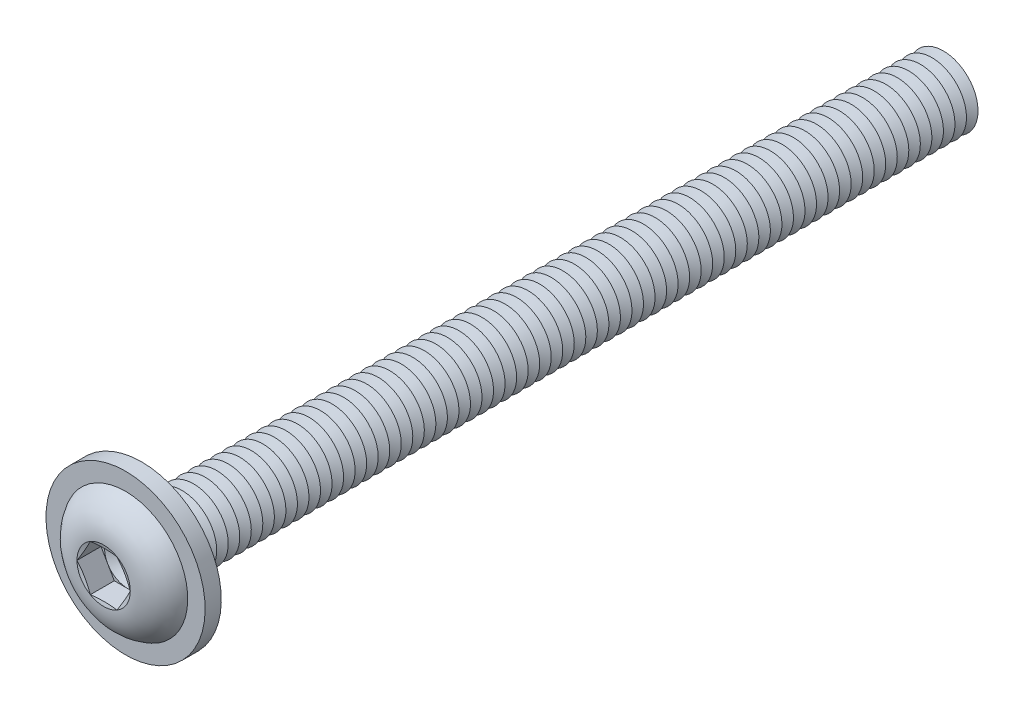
ISO-10303-21;
HEADER;
FILE_DESCRIPTION(('STEP AP214'),'2;1');
FILE_NAME('part.step','',(''),(''),'','','');
FILE_SCHEMA(('AUTOMOTIVE_DESIGN { 1 0 10303 214 1 1 1 1 }'));
ENDSEC;
DATA;
#1=APPLICATION_CONTEXT('core data for automotive mechanical design processes');
#2=APPLICATION_PROTOCOL_DEFINITION('international standard','automotive_design',2000,#1);
#3=PRODUCT_CONTEXT('',#1,'mechanical');
#4=PRODUCT('Part','Part','',(#3));
#5=PRODUCT_RELATED_PRODUCT_CATEGORY('part','',(#4));
#6=PRODUCT_DEFINITION_FORMATION('','',#4);
#7=PRODUCT_DEFINITION_CONTEXT('part definition',#1,'design');
#8=PRODUCT_DEFINITION('design','',#6,#7);
#9=PRODUCT_DEFINITION_SHAPE('','',#8);
#10=(LENGTH_UNIT() NAMED_UNIT(*) SI_UNIT(.MILLI.,.METRE.));
#11=(NAMED_UNIT(*) PLANE_ANGLE_UNIT() SI_UNIT($,.RADIAN.));
#12=(NAMED_UNIT(*) SI_UNIT($,.STERADIAN.) SOLID_ANGLE_UNIT());
#13=UNCERTAINTY_MEASURE_WITH_UNIT(LENGTH_MEASURE(1.E-05),#10,'distance_accuracy_value','');
#14=(GEOMETRIC_REPRESENTATION_CONTEXT(3) GLOBAL_UNCERTAINTY_ASSIGNED_CONTEXT((#13)) GLOBAL_UNIT_ASSIGNED_CONTEXT((#10,
#11,#12)) REPRESENTATION_CONTEXT('',''));
#15=CARTESIAN_POINT('',(0.,0.,0.));
#16=DIRECTION('',(0.,0.,1.));
#17=DIRECTION('',(1.,0.,0.));
#18=AXIS2_PLACEMENT_3D('',#15,#16,#17);
#19=CARTESIAN_POINT('',(0.,0.,-33.25));
#20=DIRECTION('',(0.,0.,1.));
#21=DIRECTION('',(0.,-1.,0.));
#22=AXIS2_PLACEMENT_3D('',#19,#20,#21);
#23=CONICAL_SURFACE('',#22,1.49999999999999,1.0471975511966);
#24=CARTESIAN_POINT('',(0.,0.,-33.5));
#25=DIRECTION('',(0.,0.,1.));
#26=DIRECTION('',(0.,-1.,0.));
#27=AXIS2_PLACEMENT_3D('',#24,#25,#26);
#28=CIRCLE('',#27,1.06698729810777);
#29=CARTESIAN_POINT('',(0.,-1.06698729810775,-33.5));
#30=VERTEX_POINT('',#29);
#31=EDGE_CURVE('E768',#30,#30,#28,.T.);
#32=ORIENTED_EDGE('',*,*,#31,.T.);
#33=EDGE_LOOP('',(#32));
#34=FACE_BOUND('',#33,.T.);
#35=CARTESIAN_POINT('',(0.,0.,-33.25));
#36=DIRECTION('',(0.,0.,1.));
#37=DIRECTION('',(0.,-1.,0.));
#38=AXIS2_PLACEMENT_3D('',#35,#36,#37);
#39=CIRCLE('',#38,1.49999999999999);
#40=CARTESIAN_POINT('',(0.,-1.49999999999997,-33.25));
#41=VERTEX_POINT('',#40);
#42=EDGE_CURVE('E764',#41,#41,#39,.T.);
#43=ORIENTED_EDGE('',*,*,#42,.F.);
#44=EDGE_LOOP('',(#43));
#45=FACE_BOUND('',#44,.T.);
#46=ADVANCED_FACE('F39',(#34,#45),#23,.T.);
#47=CARTESIAN_POINT('',(0.,0.,-33.5));
#48=DIRECTION('',(0.,0.,-1.));
#49=DIRECTION('',(0.,1.,0.));
#50=AXIS2_PLACEMENT_3D('',#47,#48,#49);
#51=CONICAL_SURFACE('',#50,1.06698729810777,1.0471975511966);
#52=CARTESIAN_POINT('',(0.,0.,-33.75));
#53=DIRECTION('',(0.,0.,1.));
#54=DIRECTION('',(0.,-1.,0.));
#55=AXIS2_PLACEMENT_3D('',#52,#53,#54);
#56=CIRCLE('',#55,1.49999999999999);
#57=CARTESIAN_POINT('',(0.,-1.49999999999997,-33.75));
#58=VERTEX_POINT('',#57);
#59=EDGE_CURVE('E772',#58,#58,#56,.T.);
#60=ORIENTED_EDGE('',*,*,#59,.T.);
#61=EDGE_LOOP('',(#60));
#62=FACE_BOUND('',#61,.T.);
#63=ORIENTED_EDGE('',*,*,#31,.F.);
#64=EDGE_LOOP('',(#63));
#65=FACE_BOUND('',#64,.T.);
#66=ADVANCED_FACE('F893',(#62,#65),#51,.T.);
#67=CARTESIAN_POINT('',(0.,1.5,-35.));
#68=DIRECTION('',(0.,0.,-1.));
#69=DIRECTION('',(0.,1.,0.));
#70=AXIS2_PLACEMENT_3D('',#67,#68,#69);
#71=PLANE('',#70);
#72=CARTESIAN_POINT('',(0.,0.,-35.));
#73=DIRECTION('',(0.,0.,1.));
#74=DIRECTION('',(0.,-1.,0.));
#75=AXIS2_PLACEMENT_3D('',#72,#73,#74);
#76=CIRCLE('',#75,1.06698729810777);
#77=CARTESIAN_POINT('',(0.,-1.06698729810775,-35.));
#78=VERTEX_POINT('',#77);
#79=EDGE_CURVE('E792',#78,#78,#76,.T.);
#80=ORIENTED_EDGE('',*,*,#79,.F.);
#81=EDGE_LOOP('',(#80));
#82=FACE_BOUND('',#81,.T.);
#83=ADVANCED_FACE('F899',(#82),#71,.T.);
#84=CARTESIAN_POINT('',(0.,0.,-34.75));
#85=DIRECTION('',(0.,0.,1.));
#86=DIRECTION('',(0.,-1.,0.));
#87=AXIS2_PLACEMENT_3D('',#84,#85,#86);
#88=CONICAL_SURFACE('',#87,1.49999999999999,1.0471975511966);
#89=ORIENTED_EDGE('',*,*,#79,.T.);
#90=EDGE_LOOP('',(#89));
#91=FACE_BOUND('',#90,.T.);
#92=CARTESIAN_POINT('',(0.,0.,-34.75));
#93=DIRECTION('',(0.,0.,1.));
#94=DIRECTION('',(0.,-1.,0.));
#95=AXIS2_PLACEMENT_3D('',#92,#93,#94);
#96=CIRCLE('',#95,1.49999999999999);
#97=CARTESIAN_POINT('',(0.,-1.49999999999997,-34.75));
#98=VERTEX_POINT('',#97);
#99=EDGE_CURVE('E788',#98,#98,#96,.T.);
#100=ORIENTED_EDGE('',*,*,#99,.F.);
#101=EDGE_LOOP('',(#100));
#102=FACE_BOUND('',#101,.T.);
#103=ADVANCED_FACE('F918',(#91,#102),#88,.T.);
#104=CARTESIAN_POINT('',(0.,0.,-34.5));
#105=DIRECTION('',(0.,0.,-1.));
#106=DIRECTION('',(0.,1.,0.));
#107=AXIS2_PLACEMENT_3D('',#104,#105,#106);
#108=CONICAL_SURFACE('',#107,1.06698729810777,1.0471975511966);
#109=ORIENTED_EDGE('',*,*,#99,.T.);
#110=EDGE_LOOP('',(#109));
#111=FACE_BOUND('',#110,.T.);
#112=CARTESIAN_POINT('',(0.,0.,-34.5));
#113=DIRECTION('',(0.,0.,1.));
#114=DIRECTION('',(0.,-1.,0.));
#115=AXIS2_PLACEMENT_3D('',#112,#113,#114);
#116=CIRCLE('',#115,1.06698729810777);
#117=CARTESIAN_POINT('',(0.,-1.06698729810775,-34.5));
#118=VERTEX_POINT('',#117);
#119=EDGE_CURVE('E784',#118,#118,#116,.T.);
#120=ORIENTED_EDGE('',*,*,#119,.F.);
#121=EDGE_LOOP('',(#120));
#122=FACE_BOUND('',#121,.T.);
#123=ADVANCED_FACE('F915',(#111,#122),#108,.T.);
#124=CARTESIAN_POINT('',(0.,0.,-34.25));
#125=DIRECTION('',(0.,0.,1.));
#126=DIRECTION('',(0.,-1.,0.));
#127=AXIS2_PLACEMENT_3D('',#124,#125,#126);
#128=CONICAL_SURFACE('',#127,1.49999999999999,1.0471975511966);
#129=ORIENTED_EDGE('',*,*,#119,.T.);
#130=EDGE_LOOP('',(#129));
#131=FACE_BOUND('',#130,.T.);
#132=CARTESIAN_POINT('',(0.,0.,-34.25));
#133=DIRECTION('',(0.,0.,1.));
#134=DIRECTION('',(0.,-1.,0.));
#135=AXIS2_PLACEMENT_3D('',#132,#133,#134);
#136=CIRCLE('',#135,1.49999999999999);
#137=CARTESIAN_POINT('',(0.,-1.49999999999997,-34.25));
#138=VERTEX_POINT('',#137);
#139=EDGE_CURVE('E780',#138,#138,#136,.T.);
#140=ORIENTED_EDGE('',*,*,#139,.F.);
#141=EDGE_LOOP('',(#140));
#142=FACE_BOUND('',#141,.T.);
#143=ADVANCED_FACE('F909',(#131,#142),#128,.T.);
#144=CARTESIAN_POINT('',(0.,0.,-34.));
#145=DIRECTION('',(0.,0.,-1.));
#146=DIRECTION('',(0.,1.,0.));
#147=AXIS2_PLACEMENT_3D('',#144,#145,#146);
#148=CONICAL_SURFACE('',#147,1.06698729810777,1.0471975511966);
#149=ORIENTED_EDGE('',*,*,#139,.T.);
#150=EDGE_LOOP('',(#149));
#151=FACE_BOUND('',#150,.T.);
#152=CARTESIAN_POINT('',(0.,0.,-34.));
#153=DIRECTION('',(0.,0.,1.));
#154=DIRECTION('',(0.,-1.,0.));
#155=AXIS2_PLACEMENT_3D('',#152,#153,#154);
#156=CIRCLE('',#155,1.06698729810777);
#157=CARTESIAN_POINT('',(0.,-1.06698729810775,-34.));
#158=VERTEX_POINT('',#157);
#159=EDGE_CURVE('E776',#158,#158,#156,.T.);
#160=ORIENTED_EDGE('',*,*,#159,.F.);
#161=EDGE_LOOP('',(#160));
#162=FACE_BOUND('',#161,.T.);
#163=ADVANCED_FACE('F905',(#151,#162),#148,.T.);
#164=CARTESIAN_POINT('',(0.,0.,-33.75));
#165=DIRECTION('',(0.,0.,1.));
#166=DIRECTION('',(0.,-1.,0.));
#167=AXIS2_PLACEMENT_3D('',#164,#165,#166);
#168=CONICAL_SURFACE('',#167,1.49999999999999,1.0471975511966);
#169=ORIENTED_EDGE('',*,*,#159,.T.);
#170=EDGE_LOOP('',(#169));
#171=FACE_BOUND('',#170,.T.);
#172=ORIENTED_EDGE('',*,*,#59,.F.);
#173=EDGE_LOOP('',(#172));
#174=FACE_BOUND('',#173,.T.);
#175=ADVANCED_FACE('F908',(#171,#174),#168,.T.);
#176=CARTESIAN_POINT('',(0.,0.,-32.75));
#177=DIRECTION('',(0.,0.,1.));
#178=DIRECTION('',(0.,-1.,0.));
#179=AXIS2_PLACEMENT_3D('',#176,#177,#178);
#180=CONICAL_SURFACE('',#179,1.49999999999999,1.0471975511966);
#181=CARTESIAN_POINT('',(0.,0.,-33.));
#182=DIRECTION('',(0.,0.,1.));
#183=DIRECTION('',(0.,-1.,0.));
#184=AXIS2_PLACEMENT_3D('',#181,#182,#183);
#185=CIRCLE('',#184,1.06698729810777);
#186=CARTESIAN_POINT('',(0.,-1.06698729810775,-33.));
#187=VERTEX_POINT('',#186);
#188=EDGE_CURVE('E760',#187,#187,#185,.T.);
#189=ORIENTED_EDGE('',*,*,#188,.T.);
#190=EDGE_LOOP('',(#189));
#191=FACE_BOUND('',#190,.T.);
#192=CARTESIAN_POINT('',(0.,0.,-32.75));
#193=DIRECTION('',(0.,0.,1.));
#194=DIRECTION('',(0.,-1.,0.));
#195=AXIS2_PLACEMENT_3D('',#192,#193,#194);
#196=CIRCLE('',#195,1.49999999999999);
#197=CARTESIAN_POINT('',(0.,-1.49999999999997,-32.75));
#198=VERTEX_POINT('',#197);
#199=EDGE_CURVE('E756',#198,#198,#196,.T.);
#200=ORIENTED_EDGE('',*,*,#199,.F.);
#201=EDGE_LOOP('',(#200));
#202=FACE_BOUND('',#201,.T.);
#203=ADVANCED_FACE('F913',(#191,#202),#180,.T.);
#204=CARTESIAN_POINT('',(0.,0.,-33.));
#205=DIRECTION('',(0.,0.,-1.));
#206=DIRECTION('',(0.,1.,0.));
#207=AXIS2_PLACEMENT_3D('',#204,#205,#206);
#208=CONICAL_SURFACE('',#207,1.06698729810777,1.0471975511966);
#209=ORIENTED_EDGE('',*,*,#42,.T.);
#210=EDGE_LOOP('',(#209));
#211=FACE_BOUND('',#210,.T.);
#212=ORIENTED_EDGE('',*,*,#188,.F.);
#213=EDGE_LOOP('',(#212));
#214=FACE_BOUND('',#213,.T.);
#215=ADVANCED_FACE('F964',(#211,#214),#208,.T.);
#216=CARTESIAN_POINT('',(0.,0.,-32.25));
#217=DIRECTION('',(0.,0.,1.));
#218=DIRECTION('',(0.,-1.,0.));
#219=AXIS2_PLACEMENT_3D('',#216,#217,#218);
#220=CONICAL_SURFACE('',#219,1.49999999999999,1.0471975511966);
#221=CARTESIAN_POINT('',(0.,0.,-32.5));
#222=DIRECTION('',(0.,0.,1.));
#223=DIRECTION('',(0.,-1.,0.));
#224=AXIS2_PLACEMENT_3D('',#221,#222,#223);
#225=CIRCLE('',#224,1.06698729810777);
#226=CARTESIAN_POINT('',(0.,-1.06698729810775,-32.5));
#227=VERTEX_POINT('',#226);
#228=EDGE_CURVE('E752',#227,#227,#225,.T.);
#229=ORIENTED_EDGE('',*,*,#228,.T.);
#230=EDGE_LOOP('',(#229));
#231=FACE_BOUND('',#230,.T.);
#232=CARTESIAN_POINT('',(0.,0.,-32.25));
#233=DIRECTION('',(0.,0.,1.));
#234=DIRECTION('',(0.,-1.,0.));
#235=AXIS2_PLACEMENT_3D('',#232,#233,#234);
#236=CIRCLE('',#235,1.49999999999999);
#237=CARTESIAN_POINT('',(0.,-1.49999999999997,-32.25));
#238=VERTEX_POINT('',#237);
#239=EDGE_CURVE('E748',#238,#238,#236,.T.);
#240=ORIENTED_EDGE('',*,*,#239,.F.);
#241=EDGE_LOOP('',(#240));
#242=FACE_BOUND('',#241,.T.);
#243=ADVANCED_FACE('F970',(#231,#242),#220,.T.);
#244=CARTESIAN_POINT('',(0.,0.,-32.5));
#245=DIRECTION('',(0.,0.,-1.));
#246=DIRECTION('',(0.,1.,0.));
#247=AXIS2_PLACEMENT_3D('',#244,#245,#246);
#248=CONICAL_SURFACE('',#247,1.06698729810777,1.0471975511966);
#249=ORIENTED_EDGE('',*,*,#199,.T.);
#250=EDGE_LOOP('',(#249));
#251=FACE_BOUND('',#250,.T.);
#252=ORIENTED_EDGE('',*,*,#228,.F.);
#253=EDGE_LOOP('',(#252));
#254=FACE_BOUND('',#253,.T.);
#255=ADVANCED_FACE('F977',(#251,#254),#248,.T.);
#256=CARTESIAN_POINT('',(0.,0.,-31.75));
#257=DIRECTION('',(0.,0.,1.));
#258=DIRECTION('',(0.,-1.,0.));
#259=AXIS2_PLACEMENT_3D('',#256,#257,#258);
#260=CONICAL_SURFACE('',#259,1.49999999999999,1.0471975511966);
#261=CARTESIAN_POINT('',(0.,0.,-32.));
#262=DIRECTION('',(0.,0.,1.));
#263=DIRECTION('',(0.,-1.,0.));
#264=AXIS2_PLACEMENT_3D('',#261,#262,#263);
#265=CIRCLE('',#264,1.06698729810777);
#266=CARTESIAN_POINT('',(0.,-1.06698729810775,-32.));
#267=VERTEX_POINT('',#266);
#268=EDGE_CURVE('E744',#267,#267,#265,.T.);
#269=ORIENTED_EDGE('',*,*,#268,.T.);
#270=EDGE_LOOP('',(#269));
#271=FACE_BOUND('',#270,.T.);
#272=CARTESIAN_POINT('',(0.,0.,-31.75));
#273=DIRECTION('',(0.,0.,1.));
#274=DIRECTION('',(0.,-1.,0.));
#275=AXIS2_PLACEMENT_3D('',#272,#273,#274);
#276=CIRCLE('',#275,1.49999999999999);
#277=CARTESIAN_POINT('',(0.,-1.49999999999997,-31.75));
#278=VERTEX_POINT('',#277);
#279=EDGE_CURVE('E740',#278,#278,#276,.T.);
#280=ORIENTED_EDGE('',*,*,#279,.F.);
#281=EDGE_LOOP('',(#280));
#282=FACE_BOUND('',#281,.T.);
#283=ADVANCED_FACE('F984',(#271,#282),#260,.T.);
#284=CARTESIAN_POINT('',(0.,0.,-32.));
#285=DIRECTION('',(0.,0.,-1.));
#286=DIRECTION('',(0.,1.,0.));
#287=AXIS2_PLACEMENT_3D('',#284,#285,#286);
#288=CONICAL_SURFACE('',#287,1.06698729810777,1.0471975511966);
#289=ORIENTED_EDGE('',*,*,#239,.T.);
#290=EDGE_LOOP('',(#289));
#291=FACE_BOUND('',#290,.T.);
#292=ORIENTED_EDGE('',*,*,#268,.F.);
#293=EDGE_LOOP('',(#292));
#294=FACE_BOUND('',#293,.T.);
#295=ADVANCED_FACE('F991',(#291,#294),#288,.T.);
#296=CARTESIAN_POINT('',(0.,0.,-31.25));
#297=DIRECTION('',(0.,0.,1.));
#298=DIRECTION('',(0.,-1.,0.));
#299=AXIS2_PLACEMENT_3D('',#296,#297,#298);
#300=CONICAL_SURFACE('',#299,1.49999999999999,1.0471975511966);
#301=CARTESIAN_POINT('',(0.,0.,-31.5));
#302=DIRECTION('',(0.,0.,1.));
#303=DIRECTION('',(0.,-1.,0.));
#304=AXIS2_PLACEMENT_3D('',#301,#302,#303);
#305=CIRCLE('',#304,1.06698729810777);
#306=CARTESIAN_POINT('',(0.,-1.06698729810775,-31.5));
#307=VERTEX_POINT('',#306);
#308=EDGE_CURVE('E736',#307,#307,#305,.T.);
#309=ORIENTED_EDGE('',*,*,#308,.T.);
#310=EDGE_LOOP('',(#309));
#311=FACE_BOUND('',#310,.T.);
#312=CARTESIAN_POINT('',(0.,0.,-31.25));
#313=DIRECTION('',(0.,0.,1.));
#314=DIRECTION('',(0.,-1.,0.));
#315=AXIS2_PLACEMENT_3D('',#312,#313,#314);
#316=CIRCLE('',#315,1.49999999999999);
#317=CARTESIAN_POINT('',(0.,-1.49999999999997,-31.25));
#318=VERTEX_POINT('',#317);
#319=EDGE_CURVE('E732',#318,#318,#316,.T.);
#320=ORIENTED_EDGE('',*,*,#319,.F.);
#321=EDGE_LOOP('',(#320));
#322=FACE_BOUND('',#321,.T.);
#323=ADVANCED_FACE('F998',(#311,#322),#300,.T.);
#324=CARTESIAN_POINT('',(0.,0.,-31.5));
#325=DIRECTION('',(0.,0.,-1.));
#326=DIRECTION('',(0.,1.,0.));
#327=AXIS2_PLACEMENT_3D('',#324,#325,#326);
#328=CONICAL_SURFACE('',#327,1.06698729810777,1.0471975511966);
#329=ORIENTED_EDGE('',*,*,#279,.T.);
#330=EDGE_LOOP('',(#329));
#331=FACE_BOUND('',#330,.T.);
#332=ORIENTED_EDGE('',*,*,#308,.F.);
#333=EDGE_LOOP('',(#332));
#334=FACE_BOUND('',#333,.T.);
#335=ADVANCED_FACE('F1005',(#331,#334),#328,.T.);
#336=CARTESIAN_POINT('',(0.,0.,-30.75));
#337=DIRECTION('',(0.,0.,1.));
#338=DIRECTION('',(0.,-1.,0.));
#339=AXIS2_PLACEMENT_3D('',#336,#337,#338);
#340=CONICAL_SURFACE('',#339,1.49999999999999,1.0471975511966);
#341=CARTESIAN_POINT('',(0.,0.,-31.));
#342=DIRECTION('',(0.,0.,1.));
#343=DIRECTION('',(0.,-1.,0.));
#344=AXIS2_PLACEMENT_3D('',#341,#342,#343);
#345=CIRCLE('',#344,1.06698729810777);
#346=CARTESIAN_POINT('',(0.,-1.06698729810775,-31.));
#347=VERTEX_POINT('',#346);
#348=EDGE_CURVE('E728',#347,#347,#345,.T.);
#349=ORIENTED_EDGE('',*,*,#348,.T.);
#350=EDGE_LOOP('',(#349));
#351=FACE_BOUND('',#350,.T.);
#352=CARTESIAN_POINT('',(0.,0.,-30.75));
#353=DIRECTION('',(0.,0.,1.));
#354=DIRECTION('',(0.,-1.,0.));
#355=AXIS2_PLACEMENT_3D('',#352,#353,#354);
#356=CIRCLE('',#355,1.49999999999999);
#357=CARTESIAN_POINT('',(0.,-1.49999999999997,-30.75));
#358=VERTEX_POINT('',#357);
#359=EDGE_CURVE('E724',#358,#358,#356,.T.);
#360=ORIENTED_EDGE('',*,*,#359,.F.);
#361=EDGE_LOOP('',(#360));
#362=FACE_BOUND('',#361,.T.);
#363=ADVANCED_FACE('F1012',(#351,#362),#340,.T.);
#364=CARTESIAN_POINT('',(0.,0.,-31.));
#365=DIRECTION('',(0.,0.,-1.));
#366=DIRECTION('',(0.,1.,0.));
#367=AXIS2_PLACEMENT_3D('',#364,#365,#366);
#368=CONICAL_SURFACE('',#367,1.06698729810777,1.0471975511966);
#369=ORIENTED_EDGE('',*,*,#319,.T.);
#370=EDGE_LOOP('',(#369));
#371=FACE_BOUND('',#370,.T.);
#372=ORIENTED_EDGE('',*,*,#348,.F.);
#373=EDGE_LOOP('',(#372));
#374=FACE_BOUND('',#373,.T.);
#375=ADVANCED_FACE('F1019',(#371,#374),#368,.T.);
#376=CARTESIAN_POINT('',(0.,0.,-30.25));
#377=DIRECTION('',(0.,0.,1.));
#378=DIRECTION('',(0.,-1.,0.));
#379=AXIS2_PLACEMENT_3D('',#376,#377,#378);
#380=CONICAL_SURFACE('',#379,1.49999999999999,1.0471975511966);
#381=CARTESIAN_POINT('',(0.,0.,-30.5));
#382=DIRECTION('',(0.,0.,1.));
#383=DIRECTION('',(0.,-1.,0.));
#384=AXIS2_PLACEMENT_3D('',#381,#382,#383);
#385=CIRCLE('',#384,1.06698729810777);
#386=CARTESIAN_POINT('',(0.,-1.06698729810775,-30.5));
#387=VERTEX_POINT('',#386);
#388=EDGE_CURVE('E720',#387,#387,#385,.T.);
#389=ORIENTED_EDGE('',*,*,#388,.T.);
#390=EDGE_LOOP('',(#389));
#391=FACE_BOUND('',#390,.T.);
#392=CARTESIAN_POINT('',(0.,0.,-30.25));
#393=DIRECTION('',(0.,0.,1.));
#394=DIRECTION('',(0.,-1.,0.));
#395=AXIS2_PLACEMENT_3D('',#392,#393,#394);
#396=CIRCLE('',#395,1.49999999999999);
#397=CARTESIAN_POINT('',(0.,-1.49999999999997,-30.25));
#398=VERTEX_POINT('',#397);
#399=EDGE_CURVE('E716',#398,#398,#396,.T.);
#400=ORIENTED_EDGE('',*,*,#399,.F.);
#401=EDGE_LOOP('',(#400));
#402=FACE_BOUND('',#401,.T.);
#403=ADVANCED_FACE('F1026',(#391,#402),#380,.T.);
#404=CARTESIAN_POINT('',(0.,0.,-30.5));
#405=DIRECTION('',(0.,0.,-1.));
#406=DIRECTION('',(0.,1.,0.));
#407=AXIS2_PLACEMENT_3D('',#404,#405,#406);
#408=CONICAL_SURFACE('',#407,1.06698729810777,1.0471975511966);
#409=ORIENTED_EDGE('',*,*,#359,.T.);
#410=EDGE_LOOP('',(#409));
#411=FACE_BOUND('',#410,.T.);
#412=ORIENTED_EDGE('',*,*,#388,.F.);
#413=EDGE_LOOP('',(#412));
#414=FACE_BOUND('',#413,.T.);
#415=ADVANCED_FACE('F1033',(#411,#414),#408,.T.);
#416=CARTESIAN_POINT('',(0.,0.,-29.75));
#417=DIRECTION('',(0.,0.,1.));
#418=DIRECTION('',(0.,-1.,0.));
#419=AXIS2_PLACEMENT_3D('',#416,#417,#418);
#420=CONICAL_SURFACE('',#419,1.49999999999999,1.0471975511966);
#421=CARTESIAN_POINT('',(0.,0.,-30.));
#422=DIRECTION('',(0.,0.,1.));
#423=DIRECTION('',(0.,-1.,0.));
#424=AXIS2_PLACEMENT_3D('',#421,#422,#423);
#425=CIRCLE('',#424,1.06698729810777);
#426=CARTESIAN_POINT('',(0.,-1.06698729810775,-30.));
#427=VERTEX_POINT('',#426);
#428=EDGE_CURVE('E712',#427,#427,#425,.T.);
#429=ORIENTED_EDGE('',*,*,#428,.T.);
#430=EDGE_LOOP('',(#429));
#431=FACE_BOUND('',#430,.T.);
#432=CARTESIAN_POINT('',(0.,0.,-29.75));
#433=DIRECTION('',(0.,0.,1.));
#434=DIRECTION('',(0.,-1.,0.));
#435=AXIS2_PLACEMENT_3D('',#432,#433,#434);
#436=CIRCLE('',#435,1.49999999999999);
#437=CARTESIAN_POINT('',(0.,-1.49999999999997,-29.75));
#438=VERTEX_POINT('',#437);
#439=EDGE_CURVE('E708',#438,#438,#436,.T.);
#440=ORIENTED_EDGE('',*,*,#439,.F.);
#441=EDGE_LOOP('',(#440));
#442=FACE_BOUND('',#441,.T.);
#443=ADVANCED_FACE('F1040',(#431,#442),#420,.T.);
#444=CARTESIAN_POINT('',(0.,0.,-30.));
#445=DIRECTION('',(0.,0.,-1.));
#446=DIRECTION('',(0.,1.,0.));
#447=AXIS2_PLACEMENT_3D('',#444,#445,#446);
#448=CONICAL_SURFACE('',#447,1.06698729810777,1.0471975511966);
#449=ORIENTED_EDGE('',*,*,#399,.T.);
#450=EDGE_LOOP('',(#449));
#451=FACE_BOUND('',#450,.T.);
#452=ORIENTED_EDGE('',*,*,#428,.F.);
#453=EDGE_LOOP('',(#452));
#454=FACE_BOUND('',#453,.T.);
#455=ADVANCED_FACE('F1047',(#451,#454),#448,.T.);
#456=CARTESIAN_POINT('',(0.,0.,-29.25));
#457=DIRECTION('',(0.,0.,1.));
#458=DIRECTION('',(0.,-1.,0.));
#459=AXIS2_PLACEMENT_3D('',#456,#457,#458);
#460=CONICAL_SURFACE('',#459,1.49999999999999,1.0471975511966);
#461=CARTESIAN_POINT('',(0.,0.,-29.5));
#462=DIRECTION('',(0.,0.,1.));
#463=DIRECTION('',(0.,-1.,0.));
#464=AXIS2_PLACEMENT_3D('',#461,#462,#463);
#465=CIRCLE('',#464,1.06698729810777);
#466=CARTESIAN_POINT('',(0.,-1.06698729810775,-29.5));
#467=VERTEX_POINT('',#466);
#468=EDGE_CURVE('E704',#467,#467,#465,.T.);
#469=ORIENTED_EDGE('',*,*,#468,.T.);
#470=EDGE_LOOP('',(#469));
#471=FACE_BOUND('',#470,.T.);
#472=CARTESIAN_POINT('',(0.,0.,-29.25));
#473=DIRECTION('',(0.,0.,1.));
#474=DIRECTION('',(0.,-1.,0.));
#475=AXIS2_PLACEMENT_3D('',#472,#473,#474);
#476=CIRCLE('',#475,1.49999999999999);
#477=CARTESIAN_POINT('',(0.,-1.49999999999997,-29.25));
#478=VERTEX_POINT('',#477);
#479=EDGE_CURVE('E700',#478,#478,#476,.T.);
#480=ORIENTED_EDGE('',*,*,#479,.F.);
#481=EDGE_LOOP('',(#480));
#482=FACE_BOUND('',#481,.T.);
#483=ADVANCED_FACE('F1054',(#471,#482),#460,.T.);
#484=CARTESIAN_POINT('',(0.,0.,-29.5));
#485=DIRECTION('',(0.,0.,-1.));
#486=DIRECTION('',(0.,1.,0.));
#487=AXIS2_PLACEMENT_3D('',#484,#485,#486);
#488=CONICAL_SURFACE('',#487,1.06698729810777,1.0471975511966);
#489=ORIENTED_EDGE('',*,*,#439,.T.);
#490=EDGE_LOOP('',(#489));
#491=FACE_BOUND('',#490,.T.);
#492=ORIENTED_EDGE('',*,*,#468,.F.);
#493=EDGE_LOOP('',(#492));
#494=FACE_BOUND('',#493,.T.);
#495=ADVANCED_FACE('F1061',(#491,#494),#488,.T.);
#496=CARTESIAN_POINT('',(0.,0.,-28.75));
#497=DIRECTION('',(0.,0.,1.));
#498=DIRECTION('',(0.,-1.,0.));
#499=AXIS2_PLACEMENT_3D('',#496,#497,#498);
#500=CONICAL_SURFACE('',#499,1.49999999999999,1.0471975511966);
#501=CARTESIAN_POINT('',(0.,0.,-29.));
#502=DIRECTION('',(0.,0.,1.));
#503=DIRECTION('',(0.,-1.,0.));
#504=AXIS2_PLACEMENT_3D('',#501,#502,#503);
#505=CIRCLE('',#504,1.06698729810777);
#506=CARTESIAN_POINT('',(0.,-1.06698729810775,-29.));
#507=VERTEX_POINT('',#506);
#508=EDGE_CURVE('E696',#507,#507,#505,.T.);
#509=ORIENTED_EDGE('',*,*,#508,.T.);
#510=EDGE_LOOP('',(#509));
#511=FACE_BOUND('',#510,.T.);
#512=CARTESIAN_POINT('',(0.,0.,-28.75));
#513=DIRECTION('',(0.,0.,1.));
#514=DIRECTION('',(0.,-1.,0.));
#515=AXIS2_PLACEMENT_3D('',#512,#513,#514);
#516=CIRCLE('',#515,1.49999999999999);
#517=CARTESIAN_POINT('',(0.,-1.49999999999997,-28.75));
#518=VERTEX_POINT('',#517);
#519=EDGE_CURVE('E692',#518,#518,#516,.T.);
#520=ORIENTED_EDGE('',*,*,#519,.F.);
#521=EDGE_LOOP('',(#520));
#522=FACE_BOUND('',#521,.T.);
#523=ADVANCED_FACE('F1068',(#511,#522),#500,.T.);
#524=CARTESIAN_POINT('',(0.,0.,-29.));
#525=DIRECTION('',(0.,0.,-1.));
#526=DIRECTION('',(0.,1.,0.));
#527=AXIS2_PLACEMENT_3D('',#524,#525,#526);
#528=CONICAL_SURFACE('',#527,1.06698729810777,1.0471975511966);
#529=ORIENTED_EDGE('',*,*,#479,.T.);
#530=EDGE_LOOP('',(#529));
#531=FACE_BOUND('',#530,.T.);
#532=ORIENTED_EDGE('',*,*,#508,.F.);
#533=EDGE_LOOP('',(#532));
#534=FACE_BOUND('',#533,.T.);
#535=ADVANCED_FACE('F1075',(#531,#534),#528,.T.);
#536=CARTESIAN_POINT('',(0.,0.,-28.25));
#537=DIRECTION('',(0.,0.,1.));
#538=DIRECTION('',(0.,-1.,0.));
#539=AXIS2_PLACEMENT_3D('',#536,#537,#538);
#540=CONICAL_SURFACE('',#539,1.49999999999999,1.0471975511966);
#541=CARTESIAN_POINT('',(0.,0.,-28.5));
#542=DIRECTION('',(0.,0.,1.));
#543=DIRECTION('',(0.,-1.,0.));
#544=AXIS2_PLACEMENT_3D('',#541,#542,#543);
#545=CIRCLE('',#544,1.06698729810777);
#546=CARTESIAN_POINT('',(0.,-1.06698729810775,-28.5));
#547=VERTEX_POINT('',#546);
#548=EDGE_CURVE('E688',#547,#547,#545,.T.);
#549=ORIENTED_EDGE('',*,*,#548,.T.);
#550=EDGE_LOOP('',(#549));
#551=FACE_BOUND('',#550,.T.);
#552=CARTESIAN_POINT('',(0.,0.,-28.25));
#553=DIRECTION('',(0.,0.,1.));
#554=DIRECTION('',(0.,-1.,0.));
#555=AXIS2_PLACEMENT_3D('',#552,#553,#554);
#556=CIRCLE('',#555,1.49999999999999);
#557=CARTESIAN_POINT('',(0.,-1.49999999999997,-28.25));
#558=VERTEX_POINT('',#557);
#559=EDGE_CURVE('E684',#558,#558,#556,.T.);
#560=ORIENTED_EDGE('',*,*,#559,.F.);
#561=EDGE_LOOP('',(#560));
#562=FACE_BOUND('',#561,.T.);
#563=ADVANCED_FACE('F1082',(#551,#562),#540,.T.);
#564=CARTESIAN_POINT('',(0.,0.,-28.5));
#565=DIRECTION('',(0.,0.,-1.));
#566=DIRECTION('',(0.,1.,0.));
#567=AXIS2_PLACEMENT_3D('',#564,#565,#566);
#568=CONICAL_SURFACE('',#567,1.06698729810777,1.0471975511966);
#569=ORIENTED_EDGE('',*,*,#519,.T.);
#570=EDGE_LOOP('',(#569));
#571=FACE_BOUND('',#570,.T.);
#572=ORIENTED_EDGE('',*,*,#548,.F.);
#573=EDGE_LOOP('',(#572));
#574=FACE_BOUND('',#573,.T.);
#575=ADVANCED_FACE('F1089',(#571,#574),#568,.T.);
#576=CARTESIAN_POINT('',(0.,0.,-27.75));
#577=DIRECTION('',(0.,0.,1.));
#578=DIRECTION('',(0.,-1.,0.));
#579=AXIS2_PLACEMENT_3D('',#576,#577,#578);
#580=CONICAL_SURFACE('',#579,1.49999999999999,1.0471975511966);
#581=CARTESIAN_POINT('',(0.,0.,-28.));
#582=DIRECTION('',(0.,0.,1.));
#583=DIRECTION('',(0.,-1.,0.));
#584=AXIS2_PLACEMENT_3D('',#581,#582,#583);
#585=CIRCLE('',#584,1.06698729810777);
#586=CARTESIAN_POINT('',(0.,-1.06698729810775,-28.));
#587=VERTEX_POINT('',#586);
#588=EDGE_CURVE('E680',#587,#587,#585,.T.);
#589=ORIENTED_EDGE('',*,*,#588,.T.);
#590=EDGE_LOOP('',(#589));
#591=FACE_BOUND('',#590,.T.);
#592=CARTESIAN_POINT('',(0.,0.,-27.75));
#593=DIRECTION('',(0.,0.,1.));
#594=DIRECTION('',(0.,-1.,0.));
#595=AXIS2_PLACEMENT_3D('',#592,#593,#594);
#596=CIRCLE('',#595,1.49999999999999);
#597=CARTESIAN_POINT('',(0.,-1.49999999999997,-27.75));
#598=VERTEX_POINT('',#597);
#599=EDGE_CURVE('E676',#598,#598,#596,.T.);
#600=ORIENTED_EDGE('',*,*,#599,.F.);
#601=EDGE_LOOP('',(#600));
#602=FACE_BOUND('',#601,.T.);
#603=ADVANCED_FACE('F1096',(#591,#602),#580,.T.);
#604=CARTESIAN_POINT('',(0.,0.,-28.));
#605=DIRECTION('',(0.,0.,-1.));
#606=DIRECTION('',(0.,1.,0.));
#607=AXIS2_PLACEMENT_3D('',#604,#605,#606);
#608=CONICAL_SURFACE('',#607,1.06698729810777,1.0471975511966);
#609=ORIENTED_EDGE('',*,*,#559,.T.);
#610=EDGE_LOOP('',(#609));
#611=FACE_BOUND('',#610,.T.);
#612=ORIENTED_EDGE('',*,*,#588,.F.);
#613=EDGE_LOOP('',(#612));
#614=FACE_BOUND('',#613,.T.);
#615=ADVANCED_FACE('F1103',(#611,#614),#608,.T.);
#616=CARTESIAN_POINT('',(0.,0.,-27.25));
#617=DIRECTION('',(0.,0.,1.));
#618=DIRECTION('',(0.,-1.,0.));
#619=AXIS2_PLACEMENT_3D('',#616,#617,#618);
#620=CONICAL_SURFACE('',#619,1.49999999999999,1.0471975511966);
#621=CARTESIAN_POINT('',(0.,0.,-27.5));
#622=DIRECTION('',(0.,0.,1.));
#623=DIRECTION('',(0.,-1.,0.));
#624=AXIS2_PLACEMENT_3D('',#621,#622,#623);
#625=CIRCLE('',#624,1.06698729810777);
#626=CARTESIAN_POINT('',(0.,-1.06698729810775,-27.5));
#627=VERTEX_POINT('',#626);
#628=EDGE_CURVE('E672',#627,#627,#625,.T.);
#629=ORIENTED_EDGE('',*,*,#628,.T.);
#630=EDGE_LOOP('',(#629));
#631=FACE_BOUND('',#630,.T.);
#632=CARTESIAN_POINT('',(0.,0.,-27.25));
#633=DIRECTION('',(0.,0.,1.));
#634=DIRECTION('',(0.,-1.,0.));
#635=AXIS2_PLACEMENT_3D('',#632,#633,#634);
#636=CIRCLE('',#635,1.49999999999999);
#637=CARTESIAN_POINT('',(0.,-1.49999999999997,-27.25));
#638=VERTEX_POINT('',#637);
#639=EDGE_CURVE('E668',#638,#638,#636,.T.);
#640=ORIENTED_EDGE('',*,*,#639,.F.);
#641=EDGE_LOOP('',(#640));
#642=FACE_BOUND('',#641,.T.);
#643=ADVANCED_FACE('F1110',(#631,#642),#620,.T.);
#644=CARTESIAN_POINT('',(0.,0.,-27.5));
#645=DIRECTION('',(0.,0.,-1.));
#646=DIRECTION('',(0.,1.,0.));
#647=AXIS2_PLACEMENT_3D('',#644,#645,#646);
#648=CONICAL_SURFACE('',#647,1.06698729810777,1.0471975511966);
#649=ORIENTED_EDGE('',*,*,#599,.T.);
#650=EDGE_LOOP('',(#649));
#651=FACE_BOUND('',#650,.T.);
#652=ORIENTED_EDGE('',*,*,#628,.F.);
#653=EDGE_LOOP('',(#652));
#654=FACE_BOUND('',#653,.T.);
#655=ADVANCED_FACE('F1117',(#651,#654),#648,.T.);
#656=CARTESIAN_POINT('',(0.,0.,-26.75));
#657=DIRECTION('',(0.,0.,1.));
#658=DIRECTION('',(0.,-1.,0.));
#659=AXIS2_PLACEMENT_3D('',#656,#657,#658);
#660=CONICAL_SURFACE('',#659,1.49999999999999,1.0471975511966);
#661=CARTESIAN_POINT('',(0.,0.,-27.));
#662=DIRECTION('',(0.,0.,1.));
#663=DIRECTION('',(0.,-1.,0.));
#664=AXIS2_PLACEMENT_3D('',#661,#662,#663);
#665=CIRCLE('',#664,1.06698729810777);
#666=CARTESIAN_POINT('',(0.,-1.06698729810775,-27.));
#667=VERTEX_POINT('',#666);
#668=EDGE_CURVE('E664',#667,#667,#665,.T.);
#669=ORIENTED_EDGE('',*,*,#668,.T.);
#670=EDGE_LOOP('',(#669));
#671=FACE_BOUND('',#670,.T.);
#672=CARTESIAN_POINT('',(0.,0.,-26.75));
#673=DIRECTION('',(0.,0.,1.));
#674=DIRECTION('',(0.,-1.,0.));
#675=AXIS2_PLACEMENT_3D('',#672,#673,#674);
#676=CIRCLE('',#675,1.49999999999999);
#677=CARTESIAN_POINT('',(0.,-1.49999999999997,-26.75));
#678=VERTEX_POINT('',#677);
#679=EDGE_CURVE('E660',#678,#678,#676,.T.);
#680=ORIENTED_EDGE('',*,*,#679,.F.);
#681=EDGE_LOOP('',(#680));
#682=FACE_BOUND('',#681,.T.);
#683=ADVANCED_FACE('F1124',(#671,#682),#660,.T.);
#684=CARTESIAN_POINT('',(0.,0.,-27.));
#685=DIRECTION('',(0.,0.,-1.));
#686=DIRECTION('',(0.,1.,0.));
#687=AXIS2_PLACEMENT_3D('',#684,#685,#686);
#688=CONICAL_SURFACE('',#687,1.06698729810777,1.0471975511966);
#689=ORIENTED_EDGE('',*,*,#639,.T.);
#690=EDGE_LOOP('',(#689));
#691=FACE_BOUND('',#690,.T.);
#692=ORIENTED_EDGE('',*,*,#668,.F.);
#693=EDGE_LOOP('',(#692));
#694=FACE_BOUND('',#693,.T.);
#695=ADVANCED_FACE('F1131',(#691,#694),#688,.T.);
#696=CARTESIAN_POINT('',(0.,0.,-26.25));
#697=DIRECTION('',(0.,0.,1.));
#698=DIRECTION('',(0.,-1.,0.));
#699=AXIS2_PLACEMENT_3D('',#696,#697,#698);
#700=CONICAL_SURFACE('',#699,1.49999999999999,1.0471975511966);
#701=CARTESIAN_POINT('',(0.,0.,-26.5));
#702=DIRECTION('',(0.,0.,1.));
#703=DIRECTION('',(0.,-1.,0.));
#704=AXIS2_PLACEMENT_3D('',#701,#702,#703);
#705=CIRCLE('',#704,1.06698729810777);
#706=CARTESIAN_POINT('',(0.,-1.06698729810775,-26.5));
#707=VERTEX_POINT('',#706);
#708=EDGE_CURVE('E656',#707,#707,#705,.T.);
#709=ORIENTED_EDGE('',*,*,#708,.T.);
#710=EDGE_LOOP('',(#709));
#711=FACE_BOUND('',#710,.T.);
#712=CARTESIAN_POINT('',(0.,0.,-26.25));
#713=DIRECTION('',(0.,0.,1.));
#714=DIRECTION('',(0.,-1.,0.));
#715=AXIS2_PLACEMENT_3D('',#712,#713,#714);
#716=CIRCLE('',#715,1.49999999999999);
#717=CARTESIAN_POINT('',(0.,-1.49999999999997,-26.25));
#718=VERTEX_POINT('',#717);
#719=EDGE_CURVE('E652',#718,#718,#716,.T.);
#720=ORIENTED_EDGE('',*,*,#719,.F.);
#721=EDGE_LOOP('',(#720));
#722=FACE_BOUND('',#721,.T.);
#723=ADVANCED_FACE('F1138',(#711,#722),#700,.T.);
#724=CARTESIAN_POINT('',(0.,0.,-26.5));
#725=DIRECTION('',(0.,0.,-1.));
#726=DIRECTION('',(0.,1.,0.));
#727=AXIS2_PLACEMENT_3D('',#724,#725,#726);
#728=CONICAL_SURFACE('',#727,1.06698729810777,1.0471975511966);
#729=ORIENTED_EDGE('',*,*,#679,.T.);
#730=EDGE_LOOP('',(#729));
#731=FACE_BOUND('',#730,.T.);
#732=ORIENTED_EDGE('',*,*,#708,.F.);
#733=EDGE_LOOP('',(#732));
#734=FACE_BOUND('',#733,.T.);
#735=ADVANCED_FACE('F1145',(#731,#734),#728,.T.);
#736=CARTESIAN_POINT('',(0.,0.,-25.75));
#737=DIRECTION('',(0.,0.,1.));
#738=DIRECTION('',(0.,-1.,0.));
#739=AXIS2_PLACEMENT_3D('',#736,#737,#738);
#740=CONICAL_SURFACE('',#739,1.49999999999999,1.0471975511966);
#741=CARTESIAN_POINT('',(0.,0.,-26.));
#742=DIRECTION('',(0.,0.,1.));
#743=DIRECTION('',(0.,-1.,0.));
#744=AXIS2_PLACEMENT_3D('',#741,#742,#743);
#745=CIRCLE('',#744,1.06698729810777);
#746=CARTESIAN_POINT('',(0.,-1.06698729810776,-26.));
#747=VERTEX_POINT('',#746);
#748=EDGE_CURVE('E648',#747,#747,#745,.T.);
#749=ORIENTED_EDGE('',*,*,#748,.T.);
#750=EDGE_LOOP('',(#749));
#751=FACE_BOUND('',#750,.T.);
#752=CARTESIAN_POINT('',(0.,0.,-25.75));
#753=DIRECTION('',(0.,0.,1.));
#754=DIRECTION('',(0.,-1.,0.));
#755=AXIS2_PLACEMENT_3D('',#752,#753,#754);
#756=CIRCLE('',#755,1.49999999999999);
#757=CARTESIAN_POINT('',(0.,-1.49999999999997,-25.75));
#758=VERTEX_POINT('',#757);
#759=EDGE_CURVE('E644',#758,#758,#756,.T.);
#760=ORIENTED_EDGE('',*,*,#759,.F.);
#761=EDGE_LOOP('',(#760));
#762=FACE_BOUND('',#761,.T.);
#763=ADVANCED_FACE('F1152',(#751,#762),#740,.T.);
#764=CARTESIAN_POINT('',(0.,0.,-26.));
#765=DIRECTION('',(0.,0.,-1.));
#766=DIRECTION('',(0.,1.,0.));
#767=AXIS2_PLACEMENT_3D('',#764,#765,#766);
#768=CONICAL_SURFACE('',#767,1.06698729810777,1.0471975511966);
#769=ORIENTED_EDGE('',*,*,#719,.T.);
#770=EDGE_LOOP('',(#769));
#771=FACE_BOUND('',#770,.T.);
#772=ORIENTED_EDGE('',*,*,#748,.F.);
#773=EDGE_LOOP('',(#772));
#774=FACE_BOUND('',#773,.T.);
#775=ADVANCED_FACE('F1159',(#771,#774),#768,.T.);
#776=CARTESIAN_POINT('',(0.,0.,-25.25));
#777=DIRECTION('',(0.,0.,1.));
#778=DIRECTION('',(0.,-1.,0.));
#779=AXIS2_PLACEMENT_3D('',#776,#777,#778);
#780=CONICAL_SURFACE('',#779,1.49999999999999,1.0471975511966);
#781=CARTESIAN_POINT('',(0.,0.,-25.5));
#782=DIRECTION('',(0.,0.,1.));
#783=DIRECTION('',(0.,-1.,0.));
#784=AXIS2_PLACEMENT_3D('',#781,#782,#783);
#785=CIRCLE('',#784,1.06698729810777);
#786=CARTESIAN_POINT('',(0.,-1.06698729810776,-25.5));
#787=VERTEX_POINT('',#786);
#788=EDGE_CURVE('E640',#787,#787,#785,.T.);
#789=ORIENTED_EDGE('',*,*,#788,.T.);
#790=EDGE_LOOP('',(#789));
#791=FACE_BOUND('',#790,.T.);
#792=CARTESIAN_POINT('',(0.,0.,-25.25));
#793=DIRECTION('',(0.,0.,1.));
#794=DIRECTION('',(0.,-1.,0.));
#795=AXIS2_PLACEMENT_3D('',#792,#793,#794);
#796=CIRCLE('',#795,1.49999999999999);
#797=CARTESIAN_POINT('',(0.,-1.49999999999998,-25.25));
#798=VERTEX_POINT('',#797);
#799=EDGE_CURVE('E636',#798,#798,#796,.T.);
#800=ORIENTED_EDGE('',*,*,#799,.F.);
#801=EDGE_LOOP('',(#800));
#802=FACE_BOUND('',#801,.T.);
#803=ADVANCED_FACE('F1166',(#791,#802),#780,.T.);
#804=CARTESIAN_POINT('',(0.,0.,-25.5));
#805=DIRECTION('',(0.,0.,-1.));
#806=DIRECTION('',(0.,1.,0.));
#807=AXIS2_PLACEMENT_3D('',#804,#805,#806);
#808=CONICAL_SURFACE('',#807,1.06698729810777,1.0471975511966);
#809=ORIENTED_EDGE('',*,*,#759,.T.);
#810=EDGE_LOOP('',(#809));
#811=FACE_BOUND('',#810,.T.);
#812=ORIENTED_EDGE('',*,*,#788,.F.);
#813=EDGE_LOOP('',(#812));
#814=FACE_BOUND('',#813,.T.);
#815=ADVANCED_FACE('F1173',(#811,#814),#808,.T.);
#816=CARTESIAN_POINT('',(0.,0.,-24.75));
#817=DIRECTION('',(0.,0.,1.));
#818=DIRECTION('',(0.,-1.,0.));
#819=AXIS2_PLACEMENT_3D('',#816,#817,#818);
#820=CONICAL_SURFACE('',#819,1.49999999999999,1.0471975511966);
#821=CARTESIAN_POINT('',(0.,0.,-25.));
#822=DIRECTION('',(0.,0.,1.));
#823=DIRECTION('',(0.,-1.,0.));
#824=AXIS2_PLACEMENT_3D('',#821,#822,#823);
#825=CIRCLE('',#824,1.06698729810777);
#826=CARTESIAN_POINT('',(0.,-1.06698729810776,-25.));
#827=VERTEX_POINT('',#826);
#828=EDGE_CURVE('E632',#827,#827,#825,.T.);
#829=ORIENTED_EDGE('',*,*,#828,.T.);
#830=EDGE_LOOP('',(#829));
#831=FACE_BOUND('',#830,.T.);
#832=CARTESIAN_POINT('',(0.,0.,-24.75));
#833=DIRECTION('',(0.,0.,1.));
#834=DIRECTION('',(0.,-1.,0.));
#835=AXIS2_PLACEMENT_3D('',#832,#833,#834);
#836=CIRCLE('',#835,1.49999999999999);
#837=CARTESIAN_POINT('',(0.,-1.49999999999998,-24.75));
#838=VERTEX_POINT('',#837);
#839=EDGE_CURVE('E628',#838,#838,#836,.T.);
#840=ORIENTED_EDGE('',*,*,#839,.F.);
#841=EDGE_LOOP('',(#840));
#842=FACE_BOUND('',#841,.T.);
#843=ADVANCED_FACE('F1180',(#831,#842),#820,.T.);
#844=CARTESIAN_POINT('',(0.,0.,-25.));
#845=DIRECTION('',(0.,0.,-1.));
#846=DIRECTION('',(0.,1.,0.));
#847=AXIS2_PLACEMENT_3D('',#844,#845,#846);
#848=CONICAL_SURFACE('',#847,1.06698729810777,1.0471975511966);
#849=ORIENTED_EDGE('',*,*,#799,.T.);
#850=EDGE_LOOP('',(#849));
#851=FACE_BOUND('',#850,.T.);
#852=ORIENTED_EDGE('',*,*,#828,.F.);
#853=EDGE_LOOP('',(#852));
#854=FACE_BOUND('',#853,.T.);
#855=ADVANCED_FACE('F1187',(#851,#854),#848,.T.);
#856=CARTESIAN_POINT('',(0.,0.,-24.25));
#857=DIRECTION('',(0.,0.,1.));
#858=DIRECTION('',(0.,-1.,0.));
#859=AXIS2_PLACEMENT_3D('',#856,#857,#858);
#860=CONICAL_SURFACE('',#859,1.49999999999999,1.0471975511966);
#861=CARTESIAN_POINT('',(0.,0.,-24.5));
#862=DIRECTION('',(0.,0.,1.));
#863=DIRECTION('',(0.,-1.,0.));
#864=AXIS2_PLACEMENT_3D('',#861,#862,#863);
#865=CIRCLE('',#864,1.06698729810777);
#866=CARTESIAN_POINT('',(0.,-1.06698729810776,-24.5));
#867=VERTEX_POINT('',#866);
#868=EDGE_CURVE('E624',#867,#867,#865,.T.);
#869=ORIENTED_EDGE('',*,*,#868,.T.);
#870=EDGE_LOOP('',(#869));
#871=FACE_BOUND('',#870,.T.);
#872=CARTESIAN_POINT('',(0.,0.,-24.25));
#873=DIRECTION('',(0.,0.,1.));
#874=DIRECTION('',(0.,-1.,0.));
#875=AXIS2_PLACEMENT_3D('',#872,#873,#874);
#876=CIRCLE('',#875,1.49999999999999);
#877=CARTESIAN_POINT('',(0.,-1.49999999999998,-24.25));
#878=VERTEX_POINT('',#877);
#879=EDGE_CURVE('E620',#878,#878,#876,.T.);
#880=ORIENTED_EDGE('',*,*,#879,.F.);
#881=EDGE_LOOP('',(#880));
#882=FACE_BOUND('',#881,.T.);
#883=ADVANCED_FACE('F1194',(#871,#882),#860,.T.);
#884=CARTESIAN_POINT('',(0.,0.,-24.5));
#885=DIRECTION('',(0.,0.,-1.));
#886=DIRECTION('',(0.,1.,0.));
#887=AXIS2_PLACEMENT_3D('',#884,#885,#886);
#888=CONICAL_SURFACE('',#887,1.06698729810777,1.0471975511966);
#889=ORIENTED_EDGE('',*,*,#839,.T.);
#890=EDGE_LOOP('',(#889));
#891=FACE_BOUND('',#890,.T.);
#892=ORIENTED_EDGE('',*,*,#868,.F.);
#893=EDGE_LOOP('',(#892));
#894=FACE_BOUND('',#893,.T.);
#895=ADVANCED_FACE('F1201',(#891,#894),#888,.T.);
#896=CARTESIAN_POINT('',(0.,0.,-23.75));
#897=DIRECTION('',(0.,0.,1.));
#898=DIRECTION('',(0.,-1.,0.));
#899=AXIS2_PLACEMENT_3D('',#896,#897,#898);
#900=CONICAL_SURFACE('',#899,1.49999999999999,1.0471975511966);
#901=CARTESIAN_POINT('',(0.,0.,-24.));
#902=DIRECTION('',(0.,0.,1.));
#903=DIRECTION('',(0.,-1.,0.));
#904=AXIS2_PLACEMENT_3D('',#901,#902,#903);
#905=CIRCLE('',#904,1.06698729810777);
#906=CARTESIAN_POINT('',(0.,-1.06698729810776,-24.));
#907=VERTEX_POINT('',#906);
#908=EDGE_CURVE('E616',#907,#907,#905,.T.);
#909=ORIENTED_EDGE('',*,*,#908,.T.);
#910=EDGE_LOOP('',(#909));
#911=FACE_BOUND('',#910,.T.);
#912=CARTESIAN_POINT('',(0.,0.,-23.75));
#913=DIRECTION('',(0.,0.,1.));
#914=DIRECTION('',(0.,-1.,0.));
#915=AXIS2_PLACEMENT_3D('',#912,#913,#914);
#916=CIRCLE('',#915,1.49999999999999);
#917=CARTESIAN_POINT('',(0.,-1.49999999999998,-23.75));
#918=VERTEX_POINT('',#917);
#919=EDGE_CURVE('E612',#918,#918,#916,.T.);
#920=ORIENTED_EDGE('',*,*,#919,.F.);
#921=EDGE_LOOP('',(#920));
#922=FACE_BOUND('',#921,.T.);
#923=ADVANCED_FACE('F1208',(#911,#922),#900,.T.);
#924=CARTESIAN_POINT('',(0.,0.,-24.));
#925=DIRECTION('',(0.,0.,-1.));
#926=DIRECTION('',(0.,1.,0.));
#927=AXIS2_PLACEMENT_3D('',#924,#925,#926);
#928=CONICAL_SURFACE('',#927,1.06698729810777,1.0471975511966);
#929=ORIENTED_EDGE('',*,*,#879,.T.);
#930=EDGE_LOOP('',(#929));
#931=FACE_BOUND('',#930,.T.);
#932=ORIENTED_EDGE('',*,*,#908,.F.);
#933=EDGE_LOOP('',(#932));
#934=FACE_BOUND('',#933,.T.);
#935=ADVANCED_FACE('F1215',(#931,#934),#928,.T.);
#936=CARTESIAN_POINT('',(0.,0.,-23.25));
#937=DIRECTION('',(0.,0.,1.));
#938=DIRECTION('',(0.,-1.,0.));
#939=AXIS2_PLACEMENT_3D('',#936,#937,#938);
#940=CONICAL_SURFACE('',#939,1.49999999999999,1.0471975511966);
#941=CARTESIAN_POINT('',(0.,0.,-23.5));
#942=DIRECTION('',(0.,0.,1.));
#943=DIRECTION('',(0.,-1.,0.));
#944=AXIS2_PLACEMENT_3D('',#941,#942,#943);
#945=CIRCLE('',#944,1.06698729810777);
#946=CARTESIAN_POINT('',(0.,-1.06698729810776,-23.5));
#947=VERTEX_POINT('',#946);
#948=EDGE_CURVE('E608',#947,#947,#945,.T.);
#949=ORIENTED_EDGE('',*,*,#948,.T.);
#950=EDGE_LOOP('',(#949));
#951=FACE_BOUND('',#950,.T.);
#952=CARTESIAN_POINT('',(0.,0.,-23.25));
#953=DIRECTION('',(0.,0.,1.));
#954=DIRECTION('',(0.,-1.,0.));
#955=AXIS2_PLACEMENT_3D('',#952,#953,#954);
#956=CIRCLE('',#955,1.49999999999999);
#957=CARTESIAN_POINT('',(0.,-1.49999999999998,-23.25));
#958=VERTEX_POINT('',#957);
#959=EDGE_CURVE('E604',#958,#958,#956,.T.);
#960=ORIENTED_EDGE('',*,*,#959,.F.);
#961=EDGE_LOOP('',(#960));
#962=FACE_BOUND('',#961,.T.);
#963=ADVANCED_FACE('F1222',(#951,#962),#940,.T.);
#964=CARTESIAN_POINT('',(0.,0.,-23.5));
#965=DIRECTION('',(0.,0.,-1.));
#966=DIRECTION('',(0.,1.,0.));
#967=AXIS2_PLACEMENT_3D('',#964,#965,#966);
#968=CONICAL_SURFACE('',#967,1.06698729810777,1.0471975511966);
#969=ORIENTED_EDGE('',*,*,#919,.T.);
#970=EDGE_LOOP('',(#969));
#971=FACE_BOUND('',#970,.T.);
#972=ORIENTED_EDGE('',*,*,#948,.F.);
#973=EDGE_LOOP('',(#972));
#974=FACE_BOUND('',#973,.T.);
#975=ADVANCED_FACE('F1229',(#971,#974),#968,.T.);
#976=CARTESIAN_POINT('',(0.,0.,-22.75));
#977=DIRECTION('',(0.,0.,1.));
#978=DIRECTION('',(0.,-1.,0.));
#979=AXIS2_PLACEMENT_3D('',#976,#977,#978);
#980=CONICAL_SURFACE('',#979,1.49999999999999,1.0471975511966);
#981=CARTESIAN_POINT('',(0.,0.,-23.));
#982=DIRECTION('',(0.,0.,1.));
#983=DIRECTION('',(0.,-1.,0.));
#984=AXIS2_PLACEMENT_3D('',#981,#982,#983);
#985=CIRCLE('',#984,1.06698729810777);
#986=CARTESIAN_POINT('',(0.,-1.06698729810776,-23.));
#987=VERTEX_POINT('',#986);
#988=EDGE_CURVE('E600',#987,#987,#985,.T.);
#989=ORIENTED_EDGE('',*,*,#988,.T.);
#990=EDGE_LOOP('',(#989));
#991=FACE_BOUND('',#990,.T.);
#992=CARTESIAN_POINT('',(0.,0.,-22.75));
#993=DIRECTION('',(0.,0.,1.));
#994=DIRECTION('',(0.,-1.,0.));
#995=AXIS2_PLACEMENT_3D('',#992,#993,#994);
#996=CIRCLE('',#995,1.49999999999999);
#997=CARTESIAN_POINT('',(0.,-1.49999999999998,-22.75));
#998=VERTEX_POINT('',#997);
#999=EDGE_CURVE('E596',#998,#998,#996,.T.);
#1000=ORIENTED_EDGE('',*,*,#999,.F.);
#1001=EDGE_LOOP('',(#1000));
#1002=FACE_BOUND('',#1001,.T.);
#1003=ADVANCED_FACE('F1236',(#991,#1002),#980,.T.);
#1004=CARTESIAN_POINT('',(0.,0.,-23.));
#1005=DIRECTION('',(0.,0.,-1.));
#1006=DIRECTION('',(0.,1.,0.));
#1007=AXIS2_PLACEMENT_3D('',#1004,#1005,#1006);
#1008=CONICAL_SURFACE('',#1007,1.06698729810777,1.0471975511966);
#1009=ORIENTED_EDGE('',*,*,#959,.T.);
#1010=EDGE_LOOP('',(#1009));
#1011=FACE_BOUND('',#1010,.T.);
#1012=ORIENTED_EDGE('',*,*,#988,.F.);
#1013=EDGE_LOOP('',(#1012));
#1014=FACE_BOUND('',#1013,.T.);
#1015=ADVANCED_FACE('F1243',(#1011,#1014),#1008,.T.);
#1016=CARTESIAN_POINT('',(0.,0.,-22.25));
#1017=DIRECTION('',(0.,0.,1.));
#1018=DIRECTION('',(0.,-1.,0.));
#1019=AXIS2_PLACEMENT_3D('',#1016,#1017,#1018);
#1020=CONICAL_SURFACE('',#1019,1.49999999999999,1.0471975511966);
#1021=CARTESIAN_POINT('',(0.,0.,-22.5));
#1022=DIRECTION('',(0.,0.,1.));
#1023=DIRECTION('',(0.,-1.,0.));
#1024=AXIS2_PLACEMENT_3D('',#1021,#1022,#1023);
#1025=CIRCLE('',#1024,1.06698729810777);
#1026=CARTESIAN_POINT('',(0.,-1.06698729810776,-22.5));
#1027=VERTEX_POINT('',#1026);
#1028=EDGE_CURVE('E592',#1027,#1027,#1025,.T.);
#1029=ORIENTED_EDGE('',*,*,#1028,.T.);
#1030=EDGE_LOOP('',(#1029));
#1031=FACE_BOUND('',#1030,.T.);
#1032=CARTESIAN_POINT('',(0.,0.,-22.25));
#1033=DIRECTION('',(0.,0.,1.));
#1034=DIRECTION('',(0.,-1.,0.));
#1035=AXIS2_PLACEMENT_3D('',#1032,#1033,#1034);
#1036=CIRCLE('',#1035,1.49999999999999);
#1037=CARTESIAN_POINT('',(0.,-1.49999999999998,-22.25));
#1038=VERTEX_POINT('',#1037);
#1039=EDGE_CURVE('E588',#1038,#1038,#1036,.T.);
#1040=ORIENTED_EDGE('',*,*,#1039,.F.);
#1041=EDGE_LOOP('',(#1040));
#1042=FACE_BOUND('',#1041,.T.);
#1043=ADVANCED_FACE('F1250',(#1031,#1042),#1020,.T.);
#1044=CARTESIAN_POINT('',(0.,0.,-22.5));
#1045=DIRECTION('',(0.,0.,-1.));
#1046=DIRECTION('',(0.,1.,0.));
#1047=AXIS2_PLACEMENT_3D('',#1044,#1045,#1046);
#1048=CONICAL_SURFACE('',#1047,1.06698729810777,1.0471975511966);
#1049=ORIENTED_EDGE('',*,*,#999,.T.);
#1050=EDGE_LOOP('',(#1049));
#1051=FACE_BOUND('',#1050,.T.);
#1052=ORIENTED_EDGE('',*,*,#1028,.F.);
#1053=EDGE_LOOP('',(#1052));
#1054=FACE_BOUND('',#1053,.T.);
#1055=ADVANCED_FACE('F1257',(#1051,#1054),#1048,.T.);
#1056=CARTESIAN_POINT('',(0.,0.,-21.75));
#1057=DIRECTION('',(0.,0.,1.));
#1058=DIRECTION('',(0.,-1.,0.));
#1059=AXIS2_PLACEMENT_3D('',#1056,#1057,#1058);
#1060=CONICAL_SURFACE('',#1059,1.49999999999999,1.0471975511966);
#1061=CARTESIAN_POINT('',(0.,0.,-22.));
#1062=DIRECTION('',(0.,0.,1.));
#1063=DIRECTION('',(0.,-1.,0.));
#1064=AXIS2_PLACEMENT_3D('',#1061,#1062,#1063);
#1065=CIRCLE('',#1064,1.06698729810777);
#1066=CARTESIAN_POINT('',(0.,-1.06698729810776,-22.));
#1067=VERTEX_POINT('',#1066);
#1068=EDGE_CURVE('E584',#1067,#1067,#1065,.T.);
#1069=ORIENTED_EDGE('',*,*,#1068,.T.);
#1070=EDGE_LOOP('',(#1069));
#1071=FACE_BOUND('',#1070,.T.);
#1072=CARTESIAN_POINT('',(0.,0.,-21.75));
#1073=DIRECTION('',(0.,0.,1.));
#1074=DIRECTION('',(0.,-1.,0.));
#1075=AXIS2_PLACEMENT_3D('',#1072,#1073,#1074);
#1076=CIRCLE('',#1075,1.49999999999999);
#1077=CARTESIAN_POINT('',(0.,-1.49999999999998,-21.75));
#1078=VERTEX_POINT('',#1077);
#1079=EDGE_CURVE('E580',#1078,#1078,#1076,.T.);
#1080=ORIENTED_EDGE('',*,*,#1079,.F.);
#1081=EDGE_LOOP('',(#1080));
#1082=FACE_BOUND('',#1081,.T.);
#1083=ADVANCED_FACE('F1264',(#1071,#1082),#1060,.T.);
#1084=CARTESIAN_POINT('',(0.,0.,-22.));
#1085=DIRECTION('',(0.,0.,-1.));
#1086=DIRECTION('',(0.,1.,0.));
#1087=AXIS2_PLACEMENT_3D('',#1084,#1085,#1086);
#1088=CONICAL_SURFACE('',#1087,1.06698729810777,1.0471975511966);
#1089=ORIENTED_EDGE('',*,*,#1039,.T.);
#1090=EDGE_LOOP('',(#1089));
#1091=FACE_BOUND('',#1090,.T.);
#1092=ORIENTED_EDGE('',*,*,#1068,.F.);
#1093=EDGE_LOOP('',(#1092));
#1094=FACE_BOUND('',#1093,.T.);
#1095=ADVANCED_FACE('F1271',(#1091,#1094),#1088,.T.);
#1096=CARTESIAN_POINT('',(0.,0.,-21.25));
#1097=DIRECTION('',(0.,0.,1.));
#1098=DIRECTION('',(0.,-1.,0.));
#1099=AXIS2_PLACEMENT_3D('',#1096,#1097,#1098);
#1100=CONICAL_SURFACE('',#1099,1.49999999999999,1.0471975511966);
#1101=CARTESIAN_POINT('',(0.,0.,-21.5));
#1102=DIRECTION('',(0.,0.,1.));
#1103=DIRECTION('',(0.,-1.,0.));
#1104=AXIS2_PLACEMENT_3D('',#1101,#1102,#1103);
#1105=CIRCLE('',#1104,1.06698729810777);
#1106=CARTESIAN_POINT('',(0.,-1.06698729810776,-21.5));
#1107=VERTEX_POINT('',#1106);
#1108=EDGE_CURVE('E576',#1107,#1107,#1105,.T.);
#1109=ORIENTED_EDGE('',*,*,#1108,.T.);
#1110=EDGE_LOOP('',(#1109));
#1111=FACE_BOUND('',#1110,.T.);
#1112=CARTESIAN_POINT('',(0.,0.,-21.25));
#1113=DIRECTION('',(0.,0.,1.));
#1114=DIRECTION('',(0.,-1.,0.));
#1115=AXIS2_PLACEMENT_3D('',#1112,#1113,#1114);
#1116=CIRCLE('',#1115,1.49999999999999);
#1117=CARTESIAN_POINT('',(0.,-1.49999999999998,-21.25));
#1118=VERTEX_POINT('',#1117);
#1119=EDGE_CURVE('E572',#1118,#1118,#1116,.T.);
#1120=ORIENTED_EDGE('',*,*,#1119,.F.);
#1121=EDGE_LOOP('',(#1120));
#1122=FACE_BOUND('',#1121,.T.);
#1123=ADVANCED_FACE('F1278',(#1111,#1122),#1100,.T.);
#1124=CARTESIAN_POINT('',(0.,0.,-21.5));
#1125=DIRECTION('',(0.,0.,-1.));
#1126=DIRECTION('',(0.,1.,0.));
#1127=AXIS2_PLACEMENT_3D('',#1124,#1125,#1126);
#1128=CONICAL_SURFACE('',#1127,1.06698729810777,1.0471975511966);
#1129=ORIENTED_EDGE('',*,*,#1079,.T.);
#1130=EDGE_LOOP('',(#1129));
#1131=FACE_BOUND('',#1130,.T.);
#1132=ORIENTED_EDGE('',*,*,#1108,.F.);
#1133=EDGE_LOOP('',(#1132));
#1134=FACE_BOUND('',#1133,.T.);
#1135=ADVANCED_FACE('F1285',(#1131,#1134),#1128,.T.);
#1136=CARTESIAN_POINT('',(0.,0.,-20.75));
#1137=DIRECTION('',(0.,0.,1.));
#1138=DIRECTION('',(0.,-1.,0.));
#1139=AXIS2_PLACEMENT_3D('',#1136,#1137,#1138);
#1140=CONICAL_SURFACE('',#1139,1.49999999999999,1.0471975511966);
#1141=CARTESIAN_POINT('',(0.,0.,-21.));
#1142=DIRECTION('',(0.,0.,1.));
#1143=DIRECTION('',(0.,-1.,0.));
#1144=AXIS2_PLACEMENT_3D('',#1141,#1142,#1143);
#1145=CIRCLE('',#1144,1.06698729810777);
#1146=CARTESIAN_POINT('',(0.,-1.06698729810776,-21.));
#1147=VERTEX_POINT('',#1146);
#1148=EDGE_CURVE('E568',#1147,#1147,#1145,.T.);
#1149=ORIENTED_EDGE('',*,*,#1148,.T.);
#1150=EDGE_LOOP('',(#1149));
#1151=FACE_BOUND('',#1150,.T.);
#1152=CARTESIAN_POINT('',(0.,0.,-20.75));
#1153=DIRECTION('',(0.,0.,1.));
#1154=DIRECTION('',(0.,-1.,0.));
#1155=AXIS2_PLACEMENT_3D('',#1152,#1153,#1154);
#1156=CIRCLE('',#1155,1.49999999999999);
#1157=CARTESIAN_POINT('',(0.,-1.49999999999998,-20.75));
#1158=VERTEX_POINT('',#1157);
#1159=EDGE_CURVE('E564',#1158,#1158,#1156,.T.);
#1160=ORIENTED_EDGE('',*,*,#1159,.F.);
#1161=EDGE_LOOP('',(#1160));
#1162=FACE_BOUND('',#1161,.T.);
#1163=ADVANCED_FACE('F1292',(#1151,#1162),#1140,.T.);
#1164=CARTESIAN_POINT('',(0.,0.,-21.));
#1165=DIRECTION('',(0.,0.,-1.));
#1166=DIRECTION('',(0.,1.,0.));
#1167=AXIS2_PLACEMENT_3D('',#1164,#1165,#1166);
#1168=CONICAL_SURFACE('',#1167,1.06698729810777,1.0471975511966);
#1169=ORIENTED_EDGE('',*,*,#1119,.T.);
#1170=EDGE_LOOP('',(#1169));
#1171=FACE_BOUND('',#1170,.T.);
#1172=ORIENTED_EDGE('',*,*,#1148,.F.);
#1173=EDGE_LOOP('',(#1172));
#1174=FACE_BOUND('',#1173,.T.);
#1175=ADVANCED_FACE('F1299',(#1171,#1174),#1168,.T.);
#1176=CARTESIAN_POINT('',(0.,0.,-20.25));
#1177=DIRECTION('',(0.,0.,1.));
#1178=DIRECTION('',(0.,-1.,0.));
#1179=AXIS2_PLACEMENT_3D('',#1176,#1177,#1178);
#1180=CONICAL_SURFACE('',#1179,1.49999999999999,1.0471975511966);
#1181=CARTESIAN_POINT('',(0.,0.,-20.5));
#1182=DIRECTION('',(0.,0.,1.));
#1183=DIRECTION('',(0.,-1.,0.));
#1184=AXIS2_PLACEMENT_3D('',#1181,#1182,#1183);
#1185=CIRCLE('',#1184,1.06698729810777);
#1186=CARTESIAN_POINT('',(0.,-1.06698729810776,-20.5));
#1187=VERTEX_POINT('',#1186);
#1188=EDGE_CURVE('E560',#1187,#1187,#1185,.T.);
#1189=ORIENTED_EDGE('',*,*,#1188,.T.);
#1190=EDGE_LOOP('',(#1189));
#1191=FACE_BOUND('',#1190,.T.);
#1192=CARTESIAN_POINT('',(0.,0.,-20.25));
#1193=DIRECTION('',(0.,0.,1.));
#1194=DIRECTION('',(0.,-1.,0.));
#1195=AXIS2_PLACEMENT_3D('',#1192,#1193,#1194);
#1196=CIRCLE('',#1195,1.49999999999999);
#1197=CARTESIAN_POINT('',(0.,-1.49999999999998,-20.25));
#1198=VERTEX_POINT('',#1197);
#1199=EDGE_CURVE('E556',#1198,#1198,#1196,.T.);
#1200=ORIENTED_EDGE('',*,*,#1199,.F.);
#1201=EDGE_LOOP('',(#1200));
#1202=FACE_BOUND('',#1201,.T.);
#1203=ADVANCED_FACE('F1306',(#1191,#1202),#1180,.T.);
#1204=CARTESIAN_POINT('',(0.,0.,-20.5));
#1205=DIRECTION('',(0.,0.,-1.));
#1206=DIRECTION('',(0.,1.,0.));
#1207=AXIS2_PLACEMENT_3D('',#1204,#1205,#1206);
#1208=CONICAL_SURFACE('',#1207,1.06698729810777,1.0471975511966);
#1209=ORIENTED_EDGE('',*,*,#1159,.T.);
#1210=EDGE_LOOP('',(#1209));
#1211=FACE_BOUND('',#1210,.T.);
#1212=ORIENTED_EDGE('',*,*,#1188,.F.);
#1213=EDGE_LOOP('',(#1212));
#1214=FACE_BOUND('',#1213,.T.);
#1215=ADVANCED_FACE('F1313',(#1211,#1214),#1208,.T.);
#1216=CARTESIAN_POINT('',(0.,0.,-19.75));
#1217=DIRECTION('',(0.,0.,1.));
#1218=DIRECTION('',(0.,-1.,0.));
#1219=AXIS2_PLACEMENT_3D('',#1216,#1217,#1218);
#1220=CONICAL_SURFACE('',#1219,1.49999999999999,1.0471975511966);
#1221=CARTESIAN_POINT('',(0.,0.,-20.));
#1222=DIRECTION('',(0.,0.,1.));
#1223=DIRECTION('',(0.,-1.,0.));
#1224=AXIS2_PLACEMENT_3D('',#1221,#1222,#1223);
#1225=CIRCLE('',#1224,1.06698729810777);
#1226=CARTESIAN_POINT('',(0.,-1.06698729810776,-20.));
#1227=VERTEX_POINT('',#1226);
#1228=EDGE_CURVE('E552',#1227,#1227,#1225,.T.);
#1229=ORIENTED_EDGE('',*,*,#1228,.T.);
#1230=EDGE_LOOP('',(#1229));
#1231=FACE_BOUND('',#1230,.T.);
#1232=CARTESIAN_POINT('',(0.,0.,-19.75));
#1233=DIRECTION('',(0.,0.,1.));
#1234=DIRECTION('',(0.,-1.,0.));
#1235=AXIS2_PLACEMENT_3D('',#1232,#1233,#1234);
#1236=CIRCLE('',#1235,1.49999999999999);
#1237=CARTESIAN_POINT('',(0.,-1.49999999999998,-19.75));
#1238=VERTEX_POINT('',#1237);
#1239=EDGE_CURVE('E548',#1238,#1238,#1236,.T.);
#1240=ORIENTED_EDGE('',*,*,#1239,.F.);
#1241=EDGE_LOOP('',(#1240));
#1242=FACE_BOUND('',#1241,.T.);
#1243=ADVANCED_FACE('F1320',(#1231,#1242),#1220,.T.);
#1244=CARTESIAN_POINT('',(0.,0.,-20.));
#1245=DIRECTION('',(0.,0.,-1.));
#1246=DIRECTION('',(0.,1.,0.));
#1247=AXIS2_PLACEMENT_3D('',#1244,#1245,#1246);
#1248=CONICAL_SURFACE('',#1247,1.06698729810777,1.0471975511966);
#1249=ORIENTED_EDGE('',*,*,#1199,.T.);
#1250=EDGE_LOOP('',(#1249));
#1251=FACE_BOUND('',#1250,.T.);
#1252=ORIENTED_EDGE('',*,*,#1228,.F.);
#1253=EDGE_LOOP('',(#1252));
#1254=FACE_BOUND('',#1253,.T.);
#1255=ADVANCED_FACE('F1327',(#1251,#1254),#1248,.T.);
#1256=CARTESIAN_POINT('',(0.,0.,-19.25));
#1257=DIRECTION('',(0.,0.,1.));
#1258=DIRECTION('',(0.,-1.,0.));
#1259=AXIS2_PLACEMENT_3D('',#1256,#1257,#1258);
#1260=CONICAL_SURFACE('',#1259,1.49999999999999,1.0471975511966);
#1261=CARTESIAN_POINT('',(0.,0.,-19.5));
#1262=DIRECTION('',(0.,0.,1.));
#1263=DIRECTION('',(0.,-1.,0.));
#1264=AXIS2_PLACEMENT_3D('',#1261,#1262,#1263);
#1265=CIRCLE('',#1264,1.06698729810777);
#1266=CARTESIAN_POINT('',(0.,-1.06698729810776,-19.5));
#1267=VERTEX_POINT('',#1266);
#1268=EDGE_CURVE('E544',#1267,#1267,#1265,.T.);
#1269=ORIENTED_EDGE('',*,*,#1268,.T.);
#1270=EDGE_LOOP('',(#1269));
#1271=FACE_BOUND('',#1270,.T.);
#1272=CARTESIAN_POINT('',(0.,0.,-19.25));
#1273=DIRECTION('',(0.,0.,1.));
#1274=DIRECTION('',(0.,-1.,0.));
#1275=AXIS2_PLACEMENT_3D('',#1272,#1273,#1274);
#1276=CIRCLE('',#1275,1.49999999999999);
#1277=CARTESIAN_POINT('',(0.,-1.49999999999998,-19.25));
#1278=VERTEX_POINT('',#1277);
#1279=EDGE_CURVE('E540',#1278,#1278,#1276,.T.);
#1280=ORIENTED_EDGE('',*,*,#1279,.F.);
#1281=EDGE_LOOP('',(#1280));
#1282=FACE_BOUND('',#1281,.T.);
#1283=ADVANCED_FACE('F1334',(#1271,#1282),#1260,.T.);
#1284=CARTESIAN_POINT('',(0.,0.,-19.5));
#1285=DIRECTION('',(0.,0.,-1.));
#1286=DIRECTION('',(0.,1.,0.));
#1287=AXIS2_PLACEMENT_3D('',#1284,#1285,#1286);
#1288=CONICAL_SURFACE('',#1287,1.06698729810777,1.0471975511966);
#1289=ORIENTED_EDGE('',*,*,#1239,.T.);
#1290=EDGE_LOOP('',(#1289));
#1291=FACE_BOUND('',#1290,.T.);
#1292=ORIENTED_EDGE('',*,*,#1268,.F.);
#1293=EDGE_LOOP('',(#1292));
#1294=FACE_BOUND('',#1293,.T.);
#1295=ADVANCED_FACE('F1341',(#1291,#1294),#1288,.T.);
#1296=CARTESIAN_POINT('',(0.,0.,-18.75));
#1297=DIRECTION('',(0.,0.,1.));
#1298=DIRECTION('',(0.,-1.,0.));
#1299=AXIS2_PLACEMENT_3D('',#1296,#1297,#1298);
#1300=CONICAL_SURFACE('',#1299,1.49999999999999,1.0471975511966);
#1301=CARTESIAN_POINT('',(0.,0.,-19.));
#1302=DIRECTION('',(0.,0.,1.));
#1303=DIRECTION('',(0.,-1.,0.));
#1304=AXIS2_PLACEMENT_3D('',#1301,#1302,#1303);
#1305=CIRCLE('',#1304,1.06698729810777);
#1306=CARTESIAN_POINT('',(0.,-1.06698729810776,-19.));
#1307=VERTEX_POINT('',#1306);
#1308=EDGE_CURVE('E536',#1307,#1307,#1305,.T.);
#1309=ORIENTED_EDGE('',*,*,#1308,.T.);
#1310=EDGE_LOOP('',(#1309));
#1311=FACE_BOUND('',#1310,.T.);
#1312=CARTESIAN_POINT('',(0.,0.,-18.75));
#1313=DIRECTION('',(0.,0.,1.));
#1314=DIRECTION('',(0.,-1.,0.));
#1315=AXIS2_PLACEMENT_3D('',#1312,#1313,#1314);
#1316=CIRCLE('',#1315,1.49999999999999);
#1317=CARTESIAN_POINT('',(0.,-1.49999999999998,-18.75));
#1318=VERTEX_POINT('',#1317);
#1319=EDGE_CURVE('E532',#1318,#1318,#1316,.T.);
#1320=ORIENTED_EDGE('',*,*,#1319,.F.);
#1321=EDGE_LOOP('',(#1320));
#1322=FACE_BOUND('',#1321,.T.);
#1323=ADVANCED_FACE('F1348',(#1311,#1322),#1300,.T.);
#1324=CARTESIAN_POINT('',(0.,0.,-19.));
#1325=DIRECTION('',(0.,0.,-1.));
#1326=DIRECTION('',(0.,1.,0.));
#1327=AXIS2_PLACEMENT_3D('',#1324,#1325,#1326);
#1328=CONICAL_SURFACE('',#1327,1.06698729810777,1.0471975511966);
#1329=ORIENTED_EDGE('',*,*,#1279,.T.);
#1330=EDGE_LOOP('',(#1329));
#1331=FACE_BOUND('',#1330,.T.);
#1332=ORIENTED_EDGE('',*,*,#1308,.F.);
#1333=EDGE_LOOP('',(#1332));
#1334=FACE_BOUND('',#1333,.T.);
#1335=ADVANCED_FACE('F1355',(#1331,#1334),#1328,.T.);
#1336=CARTESIAN_POINT('',(0.,0.,-18.25));
#1337=DIRECTION('',(0.,0.,1.));
#1338=DIRECTION('',(0.,-1.,0.));
#1339=AXIS2_PLACEMENT_3D('',#1336,#1337,#1338);
#1340=CONICAL_SURFACE('',#1339,1.49999999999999,1.0471975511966);
#1341=CARTESIAN_POINT('',(0.,0.,-18.5));
#1342=DIRECTION('',(0.,0.,1.));
#1343=DIRECTION('',(0.,-1.,0.));
#1344=AXIS2_PLACEMENT_3D('',#1341,#1342,#1343);
#1345=CIRCLE('',#1344,1.06698729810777);
#1346=CARTESIAN_POINT('',(0.,-1.06698729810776,-18.5));
#1347=VERTEX_POINT('',#1346);
#1348=EDGE_CURVE('E528',#1347,#1347,#1345,.T.);
#1349=ORIENTED_EDGE('',*,*,#1348,.T.);
#1350=EDGE_LOOP('',(#1349));
#1351=FACE_BOUND('',#1350,.T.);
#1352=CARTESIAN_POINT('',(0.,0.,-18.25));
#1353=DIRECTION('',(0.,0.,1.));
#1354=DIRECTION('',(0.,-1.,0.));
#1355=AXIS2_PLACEMENT_3D('',#1352,#1353,#1354);
#1356=CIRCLE('',#1355,1.49999999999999);
#1357=CARTESIAN_POINT('',(0.,-1.49999999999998,-18.25));
#1358=VERTEX_POINT('',#1357);
#1359=EDGE_CURVE('E524',#1358,#1358,#1356,.T.);
#1360=ORIENTED_EDGE('',*,*,#1359,.F.);
#1361=EDGE_LOOP('',(#1360));
#1362=FACE_BOUND('',#1361,.T.);
#1363=ADVANCED_FACE('F1362',(#1351,#1362),#1340,.T.);
#1364=CARTESIAN_POINT('',(0.,0.,-18.5));
#1365=DIRECTION('',(0.,0.,-1.));
#1366=DIRECTION('',(0.,1.,0.));
#1367=AXIS2_PLACEMENT_3D('',#1364,#1365,#1366);
#1368=CONICAL_SURFACE('',#1367,1.06698729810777,1.0471975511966);
#1369=ORIENTED_EDGE('',*,*,#1319,.T.);
#1370=EDGE_LOOP('',(#1369));
#1371=FACE_BOUND('',#1370,.T.);
#1372=ORIENTED_EDGE('',*,*,#1348,.F.);
#1373=EDGE_LOOP('',(#1372));
#1374=FACE_BOUND('',#1373,.T.);
#1375=ADVANCED_FACE('F1369',(#1371,#1374),#1368,.T.);
#1376=CARTESIAN_POINT('',(0.,0.,-17.75));
#1377=DIRECTION('',(0.,0.,1.));
#1378=DIRECTION('',(0.,-1.,0.));
#1379=AXIS2_PLACEMENT_3D('',#1376,#1377,#1378);
#1380=CONICAL_SURFACE('',#1379,1.49999999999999,1.0471975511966);
#1381=CARTESIAN_POINT('',(0.,0.,-18.));
#1382=DIRECTION('',(0.,0.,1.));
#1383=DIRECTION('',(0.,-1.,0.));
#1384=AXIS2_PLACEMENT_3D('',#1381,#1382,#1383);
#1385=CIRCLE('',#1384,1.06698729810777);
#1386=CARTESIAN_POINT('',(0.,-1.06698729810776,-18.));
#1387=VERTEX_POINT('',#1386);
#1388=EDGE_CURVE('E520',#1387,#1387,#1385,.T.);
#1389=ORIENTED_EDGE('',*,*,#1388,.T.);
#1390=EDGE_LOOP('',(#1389));
#1391=FACE_BOUND('',#1390,.T.);
#1392=CARTESIAN_POINT('',(0.,0.,-17.75));
#1393=DIRECTION('',(0.,0.,1.));
#1394=DIRECTION('',(0.,-1.,0.));
#1395=AXIS2_PLACEMENT_3D('',#1392,#1393,#1394);
#1396=CIRCLE('',#1395,1.49999999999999);
#1397=CARTESIAN_POINT('',(0.,-1.49999999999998,-17.75));
#1398=VERTEX_POINT('',#1397);
#1399=EDGE_CURVE('E516',#1398,#1398,#1396,.T.);
#1400=ORIENTED_EDGE('',*,*,#1399,.F.);
#1401=EDGE_LOOP('',(#1400));
#1402=FACE_BOUND('',#1401,.T.);
#1403=ADVANCED_FACE('F1376',(#1391,#1402),#1380,.T.);
#1404=CARTESIAN_POINT('',(0.,0.,-18.));
#1405=DIRECTION('',(0.,0.,-1.));
#1406=DIRECTION('',(0.,1.,0.));
#1407=AXIS2_PLACEMENT_3D('',#1404,#1405,#1406);
#1408=CONICAL_SURFACE('',#1407,1.06698729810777,1.0471975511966);
#1409=ORIENTED_EDGE('',*,*,#1359,.T.);
#1410=EDGE_LOOP('',(#1409));
#1411=FACE_BOUND('',#1410,.T.);
#1412=ORIENTED_EDGE('',*,*,#1388,.F.);
#1413=EDGE_LOOP('',(#1412));
#1414=FACE_BOUND('',#1413,.T.);
#1415=ADVANCED_FACE('F1383',(#1411,#1414),#1408,.T.);
#1416=CARTESIAN_POINT('',(0.,0.,-17.25));
#1417=DIRECTION('',(0.,0.,1.));
#1418=DIRECTION('',(0.,-1.,0.));
#1419=AXIS2_PLACEMENT_3D('',#1416,#1417,#1418);
#1420=CONICAL_SURFACE('',#1419,1.49999999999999,1.0471975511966);
#1421=CARTESIAN_POINT('',(0.,0.,-17.5));
#1422=DIRECTION('',(0.,0.,1.));
#1423=DIRECTION('',(0.,-1.,0.));
#1424=AXIS2_PLACEMENT_3D('',#1421,#1422,#1423);
#1425=CIRCLE('',#1424,1.06698729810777);
#1426=CARTESIAN_POINT('',(0.,-1.06698729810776,-17.5));
#1427=VERTEX_POINT('',#1426);
#1428=EDGE_CURVE('E512',#1427,#1427,#1425,.T.);
#1429=ORIENTED_EDGE('',*,*,#1428,.T.);
#1430=EDGE_LOOP('',(#1429));
#1431=FACE_BOUND('',#1430,.T.);
#1432=CARTESIAN_POINT('',(0.,0.,-17.25));
#1433=DIRECTION('',(0.,0.,1.));
#1434=DIRECTION('',(0.,-1.,0.));
#1435=AXIS2_PLACEMENT_3D('',#1432,#1433,#1434);
#1436=CIRCLE('',#1435,1.49999999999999);
#1437=CARTESIAN_POINT('',(0.,-1.49999999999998,-17.25));
#1438=VERTEX_POINT('',#1437);
#1439=EDGE_CURVE('E508',#1438,#1438,#1436,.T.);
#1440=ORIENTED_EDGE('',*,*,#1439,.F.);
#1441=EDGE_LOOP('',(#1440));
#1442=FACE_BOUND('',#1441,.T.);
#1443=ADVANCED_FACE('F1390',(#1431,#1442),#1420,.T.);
#1444=CARTESIAN_POINT('',(0.,0.,-17.5));
#1445=DIRECTION('',(0.,0.,-1.));
#1446=DIRECTION('',(0.,1.,0.));
#1447=AXIS2_PLACEMENT_3D('',#1444,#1445,#1446);
#1448=CONICAL_SURFACE('',#1447,1.06698729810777,1.0471975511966);
#1449=ORIENTED_EDGE('',*,*,#1399,.T.);
#1450=EDGE_LOOP('',(#1449));
#1451=FACE_BOUND('',#1450,.T.);
#1452=ORIENTED_EDGE('',*,*,#1428,.F.);
#1453=EDGE_LOOP('',(#1452));
#1454=FACE_BOUND('',#1453,.T.);
#1455=ADVANCED_FACE('F1397',(#1451,#1454),#1448,.T.);
#1456=CARTESIAN_POINT('',(0.,0.,-16.75));
#1457=DIRECTION('',(0.,0.,1.));
#1458=DIRECTION('',(0.,-1.,0.));
#1459=AXIS2_PLACEMENT_3D('',#1456,#1457,#1458);
#1460=CONICAL_SURFACE('',#1459,1.49999999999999,1.0471975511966);
#1461=CARTESIAN_POINT('',(0.,0.,-17.));
#1462=DIRECTION('',(0.,0.,1.));
#1463=DIRECTION('',(0.,-1.,0.));
#1464=AXIS2_PLACEMENT_3D('',#1461,#1462,#1463);
#1465=CIRCLE('',#1464,1.06698729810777);
#1466=CARTESIAN_POINT('',(0.,-1.06698729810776,-17.));
#1467=VERTEX_POINT('',#1466);
#1468=EDGE_CURVE('E504',#1467,#1467,#1465,.T.);
#1469=ORIENTED_EDGE('',*,*,#1468,.T.);
#1470=EDGE_LOOP('',(#1469));
#1471=FACE_BOUND('',#1470,.T.);
#1472=CARTESIAN_POINT('',(0.,0.,-16.75));
#1473=DIRECTION('',(0.,0.,1.));
#1474=DIRECTION('',(0.,-1.,0.));
#1475=AXIS2_PLACEMENT_3D('',#1472,#1473,#1474);
#1476=CIRCLE('',#1475,1.49999999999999);
#1477=CARTESIAN_POINT('',(0.,-1.49999999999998,-16.75));
#1478=VERTEX_POINT('',#1477);
#1479=EDGE_CURVE('E500',#1478,#1478,#1476,.T.);
#1480=ORIENTED_EDGE('',*,*,#1479,.F.);
#1481=EDGE_LOOP('',(#1480));
#1482=FACE_BOUND('',#1481,.T.);
#1483=ADVANCED_FACE('F1404',(#1471,#1482),#1460,.T.);
#1484=CARTESIAN_POINT('',(0.,0.,-17.));
#1485=DIRECTION('',(0.,0.,-1.));
#1486=DIRECTION('',(0.,1.,0.));
#1487=AXIS2_PLACEMENT_3D('',#1484,#1485,#1486);
#1488=CONICAL_SURFACE('',#1487,1.06698729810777,1.0471975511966);
#1489=ORIENTED_EDGE('',*,*,#1439,.T.);
#1490=EDGE_LOOP('',(#1489));
#1491=FACE_BOUND('',#1490,.T.);
#1492=ORIENTED_EDGE('',*,*,#1468,.F.);
#1493=EDGE_LOOP('',(#1492));
#1494=FACE_BOUND('',#1493,.T.);
#1495=ADVANCED_FACE('F1411',(#1491,#1494),#1488,.T.);
#1496=CARTESIAN_POINT('',(0.,0.,-16.25));
#1497=DIRECTION('',(0.,0.,1.));
#1498=DIRECTION('',(0.,-1.,0.));
#1499=AXIS2_PLACEMENT_3D('',#1496,#1497,#1498);
#1500=CONICAL_SURFACE('',#1499,1.49999999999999,1.0471975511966);
#1501=CARTESIAN_POINT('',(0.,0.,-16.5));
#1502=DIRECTION('',(0.,0.,1.));
#1503=DIRECTION('',(0.,-1.,0.));
#1504=AXIS2_PLACEMENT_3D('',#1501,#1502,#1503);
#1505=CIRCLE('',#1504,1.06698729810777);
#1506=CARTESIAN_POINT('',(0.,-1.06698729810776,-16.5));
#1507=VERTEX_POINT('',#1506);
#1508=EDGE_CURVE('E496',#1507,#1507,#1505,.T.);
#1509=ORIENTED_EDGE('',*,*,#1508,.T.);
#1510=EDGE_LOOP('',(#1509));
#1511=FACE_BOUND('',#1510,.T.);
#1512=CARTESIAN_POINT('',(0.,0.,-16.25));
#1513=DIRECTION('',(0.,0.,1.));
#1514=DIRECTION('',(0.,-1.,0.));
#1515=AXIS2_PLACEMENT_3D('',#1512,#1513,#1514);
#1516=CIRCLE('',#1515,1.49999999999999);
#1517=CARTESIAN_POINT('',(0.,-1.49999999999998,-16.25));
#1518=VERTEX_POINT('',#1517);
#1519=EDGE_CURVE('E492',#1518,#1518,#1516,.T.);
#1520=ORIENTED_EDGE('',*,*,#1519,.F.);
#1521=EDGE_LOOP('',(#1520));
#1522=FACE_BOUND('',#1521,.T.);
#1523=ADVANCED_FACE('F1418',(#1511,#1522),#1500,.T.);
#1524=CARTESIAN_POINT('',(0.,0.,-16.5));
#1525=DIRECTION('',(0.,0.,-1.));
#1526=DIRECTION('',(0.,1.,0.));
#1527=AXIS2_PLACEMENT_3D('',#1524,#1525,#1526);
#1528=CONICAL_SURFACE('',#1527,1.06698729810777,1.0471975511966);
#1529=ORIENTED_EDGE('',*,*,#1479,.T.);
#1530=EDGE_LOOP('',(#1529));
#1531=FACE_BOUND('',#1530,.T.);
#1532=ORIENTED_EDGE('',*,*,#1508,.F.);
#1533=EDGE_LOOP('',(#1532));
#1534=FACE_BOUND('',#1533,.T.);
#1535=ADVANCED_FACE('F1425',(#1531,#1534),#1528,.T.);
#1536=CARTESIAN_POINT('',(0.,0.,-15.75));
#1537=DIRECTION('',(0.,0.,1.));
#1538=DIRECTION('',(0.,-1.,0.));
#1539=AXIS2_PLACEMENT_3D('',#1536,#1537,#1538);
#1540=CONICAL_SURFACE('',#1539,1.49999999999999,1.0471975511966);
#1541=CARTESIAN_POINT('',(0.,0.,-16.));
#1542=DIRECTION('',(0.,0.,1.));
#1543=DIRECTION('',(0.,-1.,0.));
#1544=AXIS2_PLACEMENT_3D('',#1541,#1542,#1543);
#1545=CIRCLE('',#1544,1.06698729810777);
#1546=CARTESIAN_POINT('',(0.,-1.06698729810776,-16.));
#1547=VERTEX_POINT('',#1546);
#1548=EDGE_CURVE('E488',#1547,#1547,#1545,.T.);
#1549=ORIENTED_EDGE('',*,*,#1548,.T.);
#1550=EDGE_LOOP('',(#1549));
#1551=FACE_BOUND('',#1550,.T.);
#1552=CARTESIAN_POINT('',(0.,0.,-15.75));
#1553=DIRECTION('',(0.,0.,1.));
#1554=DIRECTION('',(0.,-1.,0.));
#1555=AXIS2_PLACEMENT_3D('',#1552,#1553,#1554);
#1556=CIRCLE('',#1555,1.49999999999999);
#1557=CARTESIAN_POINT('',(0.,-1.49999999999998,-15.75));
#1558=VERTEX_POINT('',#1557);
#1559=EDGE_CURVE('E484',#1558,#1558,#1556,.T.);
#1560=ORIENTED_EDGE('',*,*,#1559,.F.);
#1561=EDGE_LOOP('',(#1560));
#1562=FACE_BOUND('',#1561,.T.);
#1563=ADVANCED_FACE('F1432',(#1551,#1562),#1540,.T.);
#1564=CARTESIAN_POINT('',(0.,0.,-16.));
#1565=DIRECTION('',(0.,0.,-1.));
#1566=DIRECTION('',(0.,1.,0.));
#1567=AXIS2_PLACEMENT_3D('',#1564,#1565,#1566);
#1568=CONICAL_SURFACE('',#1567,1.06698729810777,1.0471975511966);
#1569=ORIENTED_EDGE('',*,*,#1519,.T.);
#1570=EDGE_LOOP('',(#1569));
#1571=FACE_BOUND('',#1570,.T.);
#1572=ORIENTED_EDGE('',*,*,#1548,.F.);
#1573=EDGE_LOOP('',(#1572));
#1574=FACE_BOUND('',#1573,.T.);
#1575=ADVANCED_FACE('F1439',(#1571,#1574),#1568,.T.);
#1576=CARTESIAN_POINT('',(0.,0.,-15.25));
#1577=DIRECTION('',(0.,0.,1.));
#1578=DIRECTION('',(0.,-1.,0.));
#1579=AXIS2_PLACEMENT_3D('',#1576,#1577,#1578);
#1580=CONICAL_SURFACE('',#1579,1.49999999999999,1.0471975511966);
#1581=CARTESIAN_POINT('',(0.,0.,-15.5));
#1582=DIRECTION('',(0.,0.,1.));
#1583=DIRECTION('',(0.,-1.,0.));
#1584=AXIS2_PLACEMENT_3D('',#1581,#1582,#1583);
#1585=CIRCLE('',#1584,1.06698729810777);
#1586=CARTESIAN_POINT('',(0.,-1.06698729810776,-15.5));
#1587=VERTEX_POINT('',#1586);
#1588=EDGE_CURVE('E480',#1587,#1587,#1585,.T.);
#1589=ORIENTED_EDGE('',*,*,#1588,.T.);
#1590=EDGE_LOOP('',(#1589));
#1591=FACE_BOUND('',#1590,.T.);
#1592=CARTESIAN_POINT('',(0.,0.,-15.25));
#1593=DIRECTION('',(0.,0.,1.));
#1594=DIRECTION('',(0.,-1.,0.));
#1595=AXIS2_PLACEMENT_3D('',#1592,#1593,#1594);
#1596=CIRCLE('',#1595,1.49999999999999);
#1597=CARTESIAN_POINT('',(0.,-1.49999999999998,-15.25));
#1598=VERTEX_POINT('',#1597);
#1599=EDGE_CURVE('E476',#1598,#1598,#1596,.T.);
#1600=ORIENTED_EDGE('',*,*,#1599,.F.);
#1601=EDGE_LOOP('',(#1600));
#1602=FACE_BOUND('',#1601,.T.);
#1603=ADVANCED_FACE('F1446',(#1591,#1602),#1580,.T.);
#1604=CARTESIAN_POINT('',(0.,0.,-15.5));
#1605=DIRECTION('',(0.,0.,-1.));
#1606=DIRECTION('',(0.,1.,0.));
#1607=AXIS2_PLACEMENT_3D('',#1604,#1605,#1606);
#1608=CONICAL_SURFACE('',#1607,1.06698729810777,1.0471975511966);
#1609=ORIENTED_EDGE('',*,*,#1559,.T.);
#1610=EDGE_LOOP('',(#1609));
#1611=FACE_BOUND('',#1610,.T.);
#1612=ORIENTED_EDGE('',*,*,#1588,.F.);
#1613=EDGE_LOOP('',(#1612));
#1614=FACE_BOUND('',#1613,.T.);
#1615=ADVANCED_FACE('F1453',(#1611,#1614),#1608,.T.);
#1616=CARTESIAN_POINT('',(0.,0.,-14.75));
#1617=DIRECTION('',(0.,0.,1.));
#1618=DIRECTION('',(0.,-1.,0.));
#1619=AXIS2_PLACEMENT_3D('',#1616,#1617,#1618);
#1620=CONICAL_SURFACE('',#1619,1.49999999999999,1.0471975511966);
#1621=CARTESIAN_POINT('',(0.,0.,-15.));
#1622=DIRECTION('',(0.,0.,1.));
#1623=DIRECTION('',(0.,-1.,0.));
#1624=AXIS2_PLACEMENT_3D('',#1621,#1622,#1623);
#1625=CIRCLE('',#1624,1.06698729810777);
#1626=CARTESIAN_POINT('',(0.,-1.06698729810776,-15.));
#1627=VERTEX_POINT('',#1626);
#1628=EDGE_CURVE('E472',#1627,#1627,#1625,.T.);
#1629=ORIENTED_EDGE('',*,*,#1628,.T.);
#1630=EDGE_LOOP('',(#1629));
#1631=FACE_BOUND('',#1630,.T.);
#1632=CARTESIAN_POINT('',(0.,0.,-14.75));
#1633=DIRECTION('',(0.,0.,1.));
#1634=DIRECTION('',(0.,-1.,0.));
#1635=AXIS2_PLACEMENT_3D('',#1632,#1633,#1634);
#1636=CIRCLE('',#1635,1.49999999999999);
#1637=CARTESIAN_POINT('',(0.,-1.49999999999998,-14.75));
#1638=VERTEX_POINT('',#1637);
#1639=EDGE_CURVE('E468',#1638,#1638,#1636,.T.);
#1640=ORIENTED_EDGE('',*,*,#1639,.F.);
#1641=EDGE_LOOP('',(#1640));
#1642=FACE_BOUND('',#1641,.T.);
#1643=ADVANCED_FACE('F1460',(#1631,#1642),#1620,.T.);
#1644=CARTESIAN_POINT('',(0.,0.,-15.));
#1645=DIRECTION('',(0.,0.,-1.));
#1646=DIRECTION('',(0.,1.,0.));
#1647=AXIS2_PLACEMENT_3D('',#1644,#1645,#1646);
#1648=CONICAL_SURFACE('',#1647,1.06698729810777,1.0471975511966);
#1649=ORIENTED_EDGE('',*,*,#1599,.T.);
#1650=EDGE_LOOP('',(#1649));
#1651=FACE_BOUND('',#1650,.T.);
#1652=ORIENTED_EDGE('',*,*,#1628,.F.);
#1653=EDGE_LOOP('',(#1652));
#1654=FACE_BOUND('',#1653,.T.);
#1655=ADVANCED_FACE('F1467',(#1651,#1654),#1648,.T.);
#1656=CARTESIAN_POINT('',(0.,0.,-14.25));
#1657=DIRECTION('',(0.,0.,1.));
#1658=DIRECTION('',(0.,-1.,0.));
#1659=AXIS2_PLACEMENT_3D('',#1656,#1657,#1658);
#1660=CONICAL_SURFACE('',#1659,1.49999999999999,1.0471975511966);
#1661=CARTESIAN_POINT('',(0.,0.,-14.5));
#1662=DIRECTION('',(0.,0.,1.));
#1663=DIRECTION('',(0.,-1.,0.));
#1664=AXIS2_PLACEMENT_3D('',#1661,#1662,#1663);
#1665=CIRCLE('',#1664,1.06698729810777);
#1666=CARTESIAN_POINT('',(0.,-1.06698729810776,-14.5));
#1667=VERTEX_POINT('',#1666);
#1668=EDGE_CURVE('E464',#1667,#1667,#1665,.T.);
#1669=ORIENTED_EDGE('',*,*,#1668,.T.);
#1670=EDGE_LOOP('',(#1669));
#1671=FACE_BOUND('',#1670,.T.);
#1672=CARTESIAN_POINT('',(0.,0.,-14.25));
#1673=DIRECTION('',(0.,0.,1.));
#1674=DIRECTION('',(0.,-1.,0.));
#1675=AXIS2_PLACEMENT_3D('',#1672,#1673,#1674);
#1676=CIRCLE('',#1675,1.49999999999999);
#1677=CARTESIAN_POINT('',(0.,-1.49999999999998,-14.25));
#1678=VERTEX_POINT('',#1677);
#1679=EDGE_CURVE('E460',#1678,#1678,#1676,.T.);
#1680=ORIENTED_EDGE('',*,*,#1679,.F.);
#1681=EDGE_LOOP('',(#1680));
#1682=FACE_BOUND('',#1681,.T.);
#1683=ADVANCED_FACE('F1474',(#1671,#1682),#1660,.T.);
#1684=CARTESIAN_POINT('',(0.,0.,-14.5));
#1685=DIRECTION('',(0.,0.,-1.));
#1686=DIRECTION('',(0.,1.,0.));
#1687=AXIS2_PLACEMENT_3D('',#1684,#1685,#1686);
#1688=CONICAL_SURFACE('',#1687,1.06698729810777,1.0471975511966);
#1689=ORIENTED_EDGE('',*,*,#1639,.T.);
#1690=EDGE_LOOP('',(#1689));
#1691=FACE_BOUND('',#1690,.T.);
#1692=ORIENTED_EDGE('',*,*,#1668,.F.);
#1693=EDGE_LOOP('',(#1692));
#1694=FACE_BOUND('',#1693,.T.);
#1695=ADVANCED_FACE('F1481',(#1691,#1694),#1688,.T.);
#1696=CARTESIAN_POINT('',(0.,0.,-13.75));
#1697=DIRECTION('',(0.,0.,1.));
#1698=DIRECTION('',(0.,-1.,0.));
#1699=AXIS2_PLACEMENT_3D('',#1696,#1697,#1698);
#1700=CONICAL_SURFACE('',#1699,1.49999999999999,1.0471975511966);
#1701=CARTESIAN_POINT('',(0.,0.,-14.));
#1702=DIRECTION('',(0.,0.,1.));
#1703=DIRECTION('',(0.,-1.,0.));
#1704=AXIS2_PLACEMENT_3D('',#1701,#1702,#1703);
#1705=CIRCLE('',#1704,1.06698729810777);
#1706=CARTESIAN_POINT('',(0.,-1.06698729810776,-14.));
#1707=VERTEX_POINT('',#1706);
#1708=EDGE_CURVE('E456',#1707,#1707,#1705,.T.);
#1709=ORIENTED_EDGE('',*,*,#1708,.T.);
#1710=EDGE_LOOP('',(#1709));
#1711=FACE_BOUND('',#1710,.T.);
#1712=CARTESIAN_POINT('',(0.,0.,-13.75));
#1713=DIRECTION('',(0.,0.,1.));
#1714=DIRECTION('',(0.,-1.,0.));
#1715=AXIS2_PLACEMENT_3D('',#1712,#1713,#1714);
#1716=CIRCLE('',#1715,1.49999999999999);
#1717=CARTESIAN_POINT('',(0.,-1.49999999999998,-13.75));
#1718=VERTEX_POINT('',#1717);
#1719=EDGE_CURVE('E452',#1718,#1718,#1716,.T.);
#1720=ORIENTED_EDGE('',*,*,#1719,.F.);
#1721=EDGE_LOOP('',(#1720));
#1722=FACE_BOUND('',#1721,.T.);
#1723=ADVANCED_FACE('F1488',(#1711,#1722),#1700,.T.);
#1724=CARTESIAN_POINT('',(0.,0.,-14.));
#1725=DIRECTION('',(0.,0.,-1.));
#1726=DIRECTION('',(0.,1.,0.));
#1727=AXIS2_PLACEMENT_3D('',#1724,#1725,#1726);
#1728=CONICAL_SURFACE('',#1727,1.06698729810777,1.0471975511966);
#1729=ORIENTED_EDGE('',*,*,#1679,.T.);
#1730=EDGE_LOOP('',(#1729));
#1731=FACE_BOUND('',#1730,.T.);
#1732=ORIENTED_EDGE('',*,*,#1708,.F.);
#1733=EDGE_LOOP('',(#1732));
#1734=FACE_BOUND('',#1733,.T.);
#1735=ADVANCED_FACE('F1495',(#1731,#1734),#1728,.T.);
#1736=CARTESIAN_POINT('',(0.,0.,-13.25));
#1737=DIRECTION('',(0.,0.,1.));
#1738=DIRECTION('',(0.,-1.,0.));
#1739=AXIS2_PLACEMENT_3D('',#1736,#1737,#1738);
#1740=CONICAL_SURFACE('',#1739,1.49999999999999,1.0471975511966);
#1741=CARTESIAN_POINT('',(0.,0.,-13.5));
#1742=DIRECTION('',(0.,0.,1.));
#1743=DIRECTION('',(0.,-1.,0.));
#1744=AXIS2_PLACEMENT_3D('',#1741,#1742,#1743);
#1745=CIRCLE('',#1744,1.06698729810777);
#1746=CARTESIAN_POINT('',(0.,-1.06698729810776,-13.5));
#1747=VERTEX_POINT('',#1746);
#1748=EDGE_CURVE('E448',#1747,#1747,#1745,.T.);
#1749=ORIENTED_EDGE('',*,*,#1748,.T.);
#1750=EDGE_LOOP('',(#1749));
#1751=FACE_BOUND('',#1750,.T.);
#1752=CARTESIAN_POINT('',(0.,0.,-13.25));
#1753=DIRECTION('',(0.,0.,1.));
#1754=DIRECTION('',(0.,-1.,0.));
#1755=AXIS2_PLACEMENT_3D('',#1752,#1753,#1754);
#1756=CIRCLE('',#1755,1.49999999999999);
#1757=CARTESIAN_POINT('',(0.,-1.49999999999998,-13.25));
#1758=VERTEX_POINT('',#1757);
#1759=EDGE_CURVE('E444',#1758,#1758,#1756,.T.);
#1760=ORIENTED_EDGE('',*,*,#1759,.F.);
#1761=EDGE_LOOP('',(#1760));
#1762=FACE_BOUND('',#1761,.T.);
#1763=ADVANCED_FACE('F1502',(#1751,#1762),#1740,.T.);
#1764=CARTESIAN_POINT('',(0.,0.,-13.5));
#1765=DIRECTION('',(0.,0.,-1.));
#1766=DIRECTION('',(0.,1.,0.));
#1767=AXIS2_PLACEMENT_3D('',#1764,#1765,#1766);
#1768=CONICAL_SURFACE('',#1767,1.06698729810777,1.0471975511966);
#1769=ORIENTED_EDGE('',*,*,#1719,.T.);
#1770=EDGE_LOOP('',(#1769));
#1771=FACE_BOUND('',#1770,.T.);
#1772=ORIENTED_EDGE('',*,*,#1748,.F.);
#1773=EDGE_LOOP('',(#1772));
#1774=FACE_BOUND('',#1773,.T.);
#1775=ADVANCED_FACE('F1509',(#1771,#1774),#1768,.T.);
#1776=CARTESIAN_POINT('',(0.,0.,-12.75));
#1777=DIRECTION('',(0.,0.,1.));
#1778=DIRECTION('',(0.,-1.,0.));
#1779=AXIS2_PLACEMENT_3D('',#1776,#1777,#1778);
#1780=CONICAL_SURFACE('',#1779,1.49999999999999,1.0471975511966);
#1781=CARTESIAN_POINT('',(0.,0.,-13.));
#1782=DIRECTION('',(0.,0.,1.));
#1783=DIRECTION('',(0.,-1.,0.));
#1784=AXIS2_PLACEMENT_3D('',#1781,#1782,#1783);
#1785=CIRCLE('',#1784,1.06698729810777);
#1786=CARTESIAN_POINT('',(0.,-1.06698729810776,-13.));
#1787=VERTEX_POINT('',#1786);
#1788=EDGE_CURVE('E440',#1787,#1787,#1785,.T.);
#1789=ORIENTED_EDGE('',*,*,#1788,.T.);
#1790=EDGE_LOOP('',(#1789));
#1791=FACE_BOUND('',#1790,.T.);
#1792=CARTESIAN_POINT('',(0.,0.,-12.75));
#1793=DIRECTION('',(0.,0.,1.));
#1794=DIRECTION('',(0.,-1.,0.));
#1795=AXIS2_PLACEMENT_3D('',#1792,#1793,#1794);
#1796=CIRCLE('',#1795,1.49999999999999);
#1797=CARTESIAN_POINT('',(0.,-1.49999999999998,-12.75));
#1798=VERTEX_POINT('',#1797);
#1799=EDGE_CURVE('E436',#1798,#1798,#1796,.T.);
#1800=ORIENTED_EDGE('',*,*,#1799,.F.);
#1801=EDGE_LOOP('',(#1800));
#1802=FACE_BOUND('',#1801,.T.);
#1803=ADVANCED_FACE('F1516',(#1791,#1802),#1780,.T.);
#1804=CARTESIAN_POINT('',(0.,0.,-13.));
#1805=DIRECTION('',(0.,0.,-1.));
#1806=DIRECTION('',(0.,1.,0.));
#1807=AXIS2_PLACEMENT_3D('',#1804,#1805,#1806);
#1808=CONICAL_SURFACE('',#1807,1.06698729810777,1.0471975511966);
#1809=ORIENTED_EDGE('',*,*,#1759,.T.);
#1810=EDGE_LOOP('',(#1809));
#1811=FACE_BOUND('',#1810,.T.);
#1812=ORIENTED_EDGE('',*,*,#1788,.F.);
#1813=EDGE_LOOP('',(#1812));
#1814=FACE_BOUND('',#1813,.T.);
#1815=ADVANCED_FACE('F1523',(#1811,#1814),#1808,.T.);
#1816=CARTESIAN_POINT('',(0.,0.,-12.25));
#1817=DIRECTION('',(0.,0.,1.));
#1818=DIRECTION('',(0.,-1.,0.));
#1819=AXIS2_PLACEMENT_3D('',#1816,#1817,#1818);
#1820=CONICAL_SURFACE('',#1819,1.49999999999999,1.0471975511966);
#1821=CARTESIAN_POINT('',(0.,0.,-12.5));
#1822=DIRECTION('',(0.,0.,1.));
#1823=DIRECTION('',(0.,-1.,0.));
#1824=AXIS2_PLACEMENT_3D('',#1821,#1822,#1823);
#1825=CIRCLE('',#1824,1.06698729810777);
#1826=CARTESIAN_POINT('',(0.,-1.06698729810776,-12.5));
#1827=VERTEX_POINT('',#1826);
#1828=EDGE_CURVE('E432',#1827,#1827,#1825,.T.);
#1829=ORIENTED_EDGE('',*,*,#1828,.T.);
#1830=EDGE_LOOP('',(#1829));
#1831=FACE_BOUND('',#1830,.T.);
#1832=CARTESIAN_POINT('',(0.,0.,-12.25));
#1833=DIRECTION('',(0.,0.,1.));
#1834=DIRECTION('',(0.,-1.,0.));
#1835=AXIS2_PLACEMENT_3D('',#1832,#1833,#1834);
#1836=CIRCLE('',#1835,1.49999999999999);
#1837=CARTESIAN_POINT('',(0.,-1.49999999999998,-12.25));
#1838=VERTEX_POINT('',#1837);
#1839=EDGE_CURVE('E428',#1838,#1838,#1836,.T.);
#1840=ORIENTED_EDGE('',*,*,#1839,.F.);
#1841=EDGE_LOOP('',(#1840));
#1842=FACE_BOUND('',#1841,.T.);
#1843=ADVANCED_FACE('F1530',(#1831,#1842),#1820,.T.);
#1844=CARTESIAN_POINT('',(0.,0.,-12.5));
#1845=DIRECTION('',(0.,0.,-1.));
#1846=DIRECTION('',(0.,1.,0.));
#1847=AXIS2_PLACEMENT_3D('',#1844,#1845,#1846);
#1848=CONICAL_SURFACE('',#1847,1.06698729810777,1.0471975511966);
#1849=ORIENTED_EDGE('',*,*,#1799,.T.);
#1850=EDGE_LOOP('',(#1849));
#1851=FACE_BOUND('',#1850,.T.);
#1852=ORIENTED_EDGE('',*,*,#1828,.F.);
#1853=EDGE_LOOP('',(#1852));
#1854=FACE_BOUND('',#1853,.T.);
#1855=ADVANCED_FACE('F1537',(#1851,#1854),#1848,.T.);
#1856=CARTESIAN_POINT('',(0.,0.,-11.75));
#1857=DIRECTION('',(0.,0.,1.));
#1858=DIRECTION('',(0.,-1.,0.));
#1859=AXIS2_PLACEMENT_3D('',#1856,#1857,#1858);
#1860=CONICAL_SURFACE('',#1859,1.49999999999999,1.0471975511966);
#1861=CARTESIAN_POINT('',(0.,0.,-12.));
#1862=DIRECTION('',(0.,0.,1.));
#1863=DIRECTION('',(0.,-1.,0.));
#1864=AXIS2_PLACEMENT_3D('',#1861,#1862,#1863);
#1865=CIRCLE('',#1864,1.06698729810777);
#1866=CARTESIAN_POINT('',(0.,-1.06698729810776,-12.));
#1867=VERTEX_POINT('',#1866);
#1868=EDGE_CURVE('E424',#1867,#1867,#1865,.T.);
#1869=ORIENTED_EDGE('',*,*,#1868,.T.);
#1870=EDGE_LOOP('',(#1869));
#1871=FACE_BOUND('',#1870,.T.);
#1872=CARTESIAN_POINT('',(0.,0.,-11.75));
#1873=DIRECTION('',(0.,0.,1.));
#1874=DIRECTION('',(0.,-1.,0.));
#1875=AXIS2_PLACEMENT_3D('',#1872,#1873,#1874);
#1876=CIRCLE('',#1875,1.49999999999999);
#1877=CARTESIAN_POINT('',(0.,-1.49999999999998,-11.75));
#1878=VERTEX_POINT('',#1877);
#1879=EDGE_CURVE('E420',#1878,#1878,#1876,.T.);
#1880=ORIENTED_EDGE('',*,*,#1879,.F.);
#1881=EDGE_LOOP('',(#1880));
#1882=FACE_BOUND('',#1881,.T.);
#1883=ADVANCED_FACE('F1544',(#1871,#1882),#1860,.T.);
#1884=CARTESIAN_POINT('',(0.,0.,-12.));
#1885=DIRECTION('',(0.,0.,-1.));
#1886=DIRECTION('',(0.,1.,0.));
#1887=AXIS2_PLACEMENT_3D('',#1884,#1885,#1886);
#1888=CONICAL_SURFACE('',#1887,1.06698729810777,1.0471975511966);
#1889=ORIENTED_EDGE('',*,*,#1839,.T.);
#1890=EDGE_LOOP('',(#1889));
#1891=FACE_BOUND('',#1890,.T.);
#1892=ORIENTED_EDGE('',*,*,#1868,.F.);
#1893=EDGE_LOOP('',(#1892));
#1894=FACE_BOUND('',#1893,.T.);
#1895=ADVANCED_FACE('F1551',(#1891,#1894),#1888,.T.);
#1896=CARTESIAN_POINT('',(0.,0.,-11.25));
#1897=DIRECTION('',(0.,0.,1.));
#1898=DIRECTION('',(0.,-1.,0.));
#1899=AXIS2_PLACEMENT_3D('',#1896,#1897,#1898);
#1900=CONICAL_SURFACE('',#1899,1.49999999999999,1.0471975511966);
#1901=CARTESIAN_POINT('',(0.,0.,-11.5));
#1902=DIRECTION('',(0.,0.,1.));
#1903=DIRECTION('',(0.,-1.,0.));
#1904=AXIS2_PLACEMENT_3D('',#1901,#1902,#1903);
#1905=CIRCLE('',#1904,1.06698729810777);
#1906=CARTESIAN_POINT('',(0.,-1.06698729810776,-11.5));
#1907=VERTEX_POINT('',#1906);
#1908=EDGE_CURVE('E416',#1907,#1907,#1905,.T.);
#1909=ORIENTED_EDGE('',*,*,#1908,.T.);
#1910=EDGE_LOOP('',(#1909));
#1911=FACE_BOUND('',#1910,.T.);
#1912=CARTESIAN_POINT('',(0.,0.,-11.25));
#1913=DIRECTION('',(0.,0.,1.));
#1914=DIRECTION('',(0.,-1.,0.));
#1915=AXIS2_PLACEMENT_3D('',#1912,#1913,#1914);
#1916=CIRCLE('',#1915,1.49999999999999);
#1917=CARTESIAN_POINT('',(0.,-1.49999999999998,-11.25));
#1918=VERTEX_POINT('',#1917);
#1919=EDGE_CURVE('E412',#1918,#1918,#1916,.T.);
#1920=ORIENTED_EDGE('',*,*,#1919,.F.);
#1921=EDGE_LOOP('',(#1920));
#1922=FACE_BOUND('',#1921,.T.);
#1923=ADVANCED_FACE('F1558',(#1911,#1922),#1900,.T.);
#1924=CARTESIAN_POINT('',(0.,0.,-11.5));
#1925=DIRECTION('',(0.,0.,-1.));
#1926=DIRECTION('',(0.,1.,0.));
#1927=AXIS2_PLACEMENT_3D('',#1924,#1925,#1926);
#1928=CONICAL_SURFACE('',#1927,1.06698729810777,1.0471975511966);
#1929=ORIENTED_EDGE('',*,*,#1879,.T.);
#1930=EDGE_LOOP('',(#1929));
#1931=FACE_BOUND('',#1930,.T.);
#1932=ORIENTED_EDGE('',*,*,#1908,.F.);
#1933=EDGE_LOOP('',(#1932));
#1934=FACE_BOUND('',#1933,.T.);
#1935=ADVANCED_FACE('F1565',(#1931,#1934),#1928,.T.);
#1936=CARTESIAN_POINT('',(0.,0.,-10.75));
#1937=DIRECTION('',(0.,0.,1.));
#1938=DIRECTION('',(0.,-1.,0.));
#1939=AXIS2_PLACEMENT_3D('',#1936,#1937,#1938);
#1940=CONICAL_SURFACE('',#1939,1.49999999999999,1.0471975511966);
#1941=CARTESIAN_POINT('',(0.,0.,-11.));
#1942=DIRECTION('',(0.,0.,1.));
#1943=DIRECTION('',(0.,-1.,0.));
#1944=AXIS2_PLACEMENT_3D('',#1941,#1942,#1943);
#1945=CIRCLE('',#1944,1.06698729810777);
#1946=CARTESIAN_POINT('',(0.,-1.06698729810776,-11.));
#1947=VERTEX_POINT('',#1946);
#1948=EDGE_CURVE('E408',#1947,#1947,#1945,.T.);
#1949=ORIENTED_EDGE('',*,*,#1948,.T.);
#1950=EDGE_LOOP('',(#1949));
#1951=FACE_BOUND('',#1950,.T.);
#1952=CARTESIAN_POINT('',(0.,0.,-10.75));
#1953=DIRECTION('',(0.,0.,1.));
#1954=DIRECTION('',(0.,-1.,0.));
#1955=AXIS2_PLACEMENT_3D('',#1952,#1953,#1954);
#1956=CIRCLE('',#1955,1.49999999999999);
#1957=CARTESIAN_POINT('',(0.,-1.49999999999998,-10.75));
#1958=VERTEX_POINT('',#1957);
#1959=EDGE_CURVE('E404',#1958,#1958,#1956,.T.);
#1960=ORIENTED_EDGE('',*,*,#1959,.F.);
#1961=EDGE_LOOP('',(#1960));
#1962=FACE_BOUND('',#1961,.T.);
#1963=ADVANCED_FACE('F1572',(#1951,#1962),#1940,.T.);
#1964=CARTESIAN_POINT('',(0.,0.,-11.));
#1965=DIRECTION('',(0.,0.,-1.));
#1966=DIRECTION('',(0.,1.,0.));
#1967=AXIS2_PLACEMENT_3D('',#1964,#1965,#1966);
#1968=CONICAL_SURFACE('',#1967,1.06698729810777,1.0471975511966);
#1969=ORIENTED_EDGE('',*,*,#1919,.T.);
#1970=EDGE_LOOP('',(#1969));
#1971=FACE_BOUND('',#1970,.T.);
#1972=ORIENTED_EDGE('',*,*,#1948,.F.);
#1973=EDGE_LOOP('',(#1972));
#1974=FACE_BOUND('',#1973,.T.);
#1975=ADVANCED_FACE('F1579',(#1971,#1974),#1968,.T.);
#1976=CARTESIAN_POINT('',(0.,0.,-10.25));
#1977=DIRECTION('',(0.,0.,1.));
#1978=DIRECTION('',(0.,-1.,0.));
#1979=AXIS2_PLACEMENT_3D('',#1976,#1977,#1978);
#1980=CONICAL_SURFACE('',#1979,1.49999999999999,1.0471975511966);
#1981=CARTESIAN_POINT('',(0.,0.,-10.5));
#1982=DIRECTION('',(0.,0.,1.));
#1983=DIRECTION('',(0.,-1.,0.));
#1984=AXIS2_PLACEMENT_3D('',#1981,#1982,#1983);
#1985=CIRCLE('',#1984,1.06698729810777);
#1986=CARTESIAN_POINT('',(0.,-1.06698729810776,-10.5));
#1987=VERTEX_POINT('',#1986);
#1988=EDGE_CURVE('E400',#1987,#1987,#1985,.T.);
#1989=ORIENTED_EDGE('',*,*,#1988,.T.);
#1990=EDGE_LOOP('',(#1989));
#1991=FACE_BOUND('',#1990,.T.);
#1992=CARTESIAN_POINT('',(0.,0.,-10.25));
#1993=DIRECTION('',(0.,0.,1.));
#1994=DIRECTION('',(0.,-1.,0.));
#1995=AXIS2_PLACEMENT_3D('',#1992,#1993,#1994);
#1996=CIRCLE('',#1995,1.49999999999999);
#1997=CARTESIAN_POINT('',(0.,-1.49999999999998,-10.25));
#1998=VERTEX_POINT('',#1997);
#1999=EDGE_CURVE('E396',#1998,#1998,#1996,.T.);
#2000=ORIENTED_EDGE('',*,*,#1999,.F.);
#2001=EDGE_LOOP('',(#2000));
#2002=FACE_BOUND('',#2001,.T.);
#2003=ADVANCED_FACE('F1586',(#1991,#2002),#1980,.T.);
#2004=CARTESIAN_POINT('',(0.,0.,-10.5));
#2005=DIRECTION('',(0.,0.,-1.));
#2006=DIRECTION('',(0.,1.,0.));
#2007=AXIS2_PLACEMENT_3D('',#2004,#2005,#2006);
#2008=CONICAL_SURFACE('',#2007,1.06698729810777,1.0471975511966);
#2009=ORIENTED_EDGE('',*,*,#1959,.T.);
#2010=EDGE_LOOP('',(#2009));
#2011=FACE_BOUND('',#2010,.T.);
#2012=ORIENTED_EDGE('',*,*,#1988,.F.);
#2013=EDGE_LOOP('',(#2012));
#2014=FACE_BOUND('',#2013,.T.);
#2015=ADVANCED_FACE('F1593',(#2011,#2014),#2008,.T.);
#2016=CARTESIAN_POINT('',(0.,0.,-9.75));
#2017=DIRECTION('',(0.,0.,1.));
#2018=DIRECTION('',(0.,-1.,0.));
#2019=AXIS2_PLACEMENT_3D('',#2016,#2017,#2018);
#2020=CONICAL_SURFACE('',#2019,1.49999999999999,1.0471975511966);
#2021=CARTESIAN_POINT('',(0.,0.,-10.));
#2022=DIRECTION('',(0.,0.,1.));
#2023=DIRECTION('',(0.,-1.,0.));
#2024=AXIS2_PLACEMENT_3D('',#2021,#2022,#2023);
#2025=CIRCLE('',#2024,1.06698729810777);
#2026=CARTESIAN_POINT('',(0.,-1.06698729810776,-10.));
#2027=VERTEX_POINT('',#2026);
#2028=EDGE_CURVE('E392',#2027,#2027,#2025,.T.);
#2029=ORIENTED_EDGE('',*,*,#2028,.T.);
#2030=EDGE_LOOP('',(#2029));
#2031=FACE_BOUND('',#2030,.T.);
#2032=CARTESIAN_POINT('',(0.,0.,-9.75));
#2033=DIRECTION('',(0.,0.,1.));
#2034=DIRECTION('',(0.,-1.,0.));
#2035=AXIS2_PLACEMENT_3D('',#2032,#2033,#2034);
#2036=CIRCLE('',#2035,1.49999999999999);
#2037=CARTESIAN_POINT('',(0.,-1.49999999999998,-9.75));
#2038=VERTEX_POINT('',#2037);
#2039=EDGE_CURVE('E388',#2038,#2038,#2036,.T.);
#2040=ORIENTED_EDGE('',*,*,#2039,.F.);
#2041=EDGE_LOOP('',(#2040));
#2042=FACE_BOUND('',#2041,.T.);
#2043=ADVANCED_FACE('F1600',(#2031,#2042),#2020,.T.);
#2044=CARTESIAN_POINT('',(0.,0.,-10.));
#2045=DIRECTION('',(0.,0.,-1.));
#2046=DIRECTION('',(0.,1.,0.));
#2047=AXIS2_PLACEMENT_3D('',#2044,#2045,#2046);
#2048=CONICAL_SURFACE('',#2047,1.06698729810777,1.0471975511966);
#2049=ORIENTED_EDGE('',*,*,#1999,.T.);
#2050=EDGE_LOOP('',(#2049));
#2051=FACE_BOUND('',#2050,.T.);
#2052=ORIENTED_EDGE('',*,*,#2028,.F.);
#2053=EDGE_LOOP('',(#2052));
#2054=FACE_BOUND('',#2053,.T.);
#2055=ADVANCED_FACE('F1607',(#2051,#2054),#2048,.T.);
#2056=CARTESIAN_POINT('',(0.,0.,-9.25));
#2057=DIRECTION('',(0.,0.,1.));
#2058=DIRECTION('',(0.,-1.,0.));
#2059=AXIS2_PLACEMENT_3D('',#2056,#2057,#2058);
#2060=CONICAL_SURFACE('',#2059,1.49999999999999,1.0471975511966);
#2061=CARTESIAN_POINT('',(0.,0.,-9.5));
#2062=DIRECTION('',(0.,0.,1.));
#2063=DIRECTION('',(0.,-1.,0.));
#2064=AXIS2_PLACEMENT_3D('',#2061,#2062,#2063);
#2065=CIRCLE('',#2064,1.06698729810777);
#2066=CARTESIAN_POINT('',(0.,-1.06698729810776,-9.5));
#2067=VERTEX_POINT('',#2066);
#2068=EDGE_CURVE('E384',#2067,#2067,#2065,.T.);
#2069=ORIENTED_EDGE('',*,*,#2068,.T.);
#2070=EDGE_LOOP('',(#2069));
#2071=FACE_BOUND('',#2070,.T.);
#2072=CARTESIAN_POINT('',(0.,0.,-9.25));
#2073=DIRECTION('',(0.,0.,1.));
#2074=DIRECTION('',(0.,-1.,0.));
#2075=AXIS2_PLACEMENT_3D('',#2072,#2073,#2074);
#2076=CIRCLE('',#2075,1.49999999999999);
#2077=CARTESIAN_POINT('',(0.,-1.49999999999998,-9.25));
#2078=VERTEX_POINT('',#2077);
#2079=EDGE_CURVE('E380',#2078,#2078,#2076,.T.);
#2080=ORIENTED_EDGE('',*,*,#2079,.F.);
#2081=EDGE_LOOP('',(#2080));
#2082=FACE_BOUND('',#2081,.T.);
#2083=ADVANCED_FACE('F1614',(#2071,#2082),#2060,.T.);
#2084=CARTESIAN_POINT('',(0.,0.,-9.5));
#2085=DIRECTION('',(0.,0.,-1.));
#2086=DIRECTION('',(0.,1.,0.));
#2087=AXIS2_PLACEMENT_3D('',#2084,#2085,#2086);
#2088=CONICAL_SURFACE('',#2087,1.06698729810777,1.0471975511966);
#2089=ORIENTED_EDGE('',*,*,#2039,.T.);
#2090=EDGE_LOOP('',(#2089));
#2091=FACE_BOUND('',#2090,.T.);
#2092=ORIENTED_EDGE('',*,*,#2068,.F.);
#2093=EDGE_LOOP('',(#2092));
#2094=FACE_BOUND('',#2093,.T.);
#2095=ADVANCED_FACE('F1621',(#2091,#2094),#2088,.T.);
#2096=CARTESIAN_POINT('',(0.,0.,-8.75));
#2097=DIRECTION('',(0.,0.,1.));
#2098=DIRECTION('',(0.,-1.,0.));
#2099=AXIS2_PLACEMENT_3D('',#2096,#2097,#2098);
#2100=CONICAL_SURFACE('',#2099,1.49999999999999,1.0471975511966);
#2101=CARTESIAN_POINT('',(0.,0.,-9.));
#2102=DIRECTION('',(0.,0.,1.));
#2103=DIRECTION('',(0.,-1.,0.));
#2104=AXIS2_PLACEMENT_3D('',#2101,#2102,#2103);
#2105=CIRCLE('',#2104,1.06698729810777);
#2106=CARTESIAN_POINT('',(0.,-1.06698729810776,-9.));
#2107=VERTEX_POINT('',#2106);
#2108=EDGE_CURVE('E376',#2107,#2107,#2105,.T.);
#2109=ORIENTED_EDGE('',*,*,#2108,.T.);
#2110=EDGE_LOOP('',(#2109));
#2111=FACE_BOUND('',#2110,.T.);
#2112=CARTESIAN_POINT('',(0.,0.,-8.75));
#2113=DIRECTION('',(0.,0.,1.));
#2114=DIRECTION('',(0.,-1.,0.));
#2115=AXIS2_PLACEMENT_3D('',#2112,#2113,#2114);
#2116=CIRCLE('',#2115,1.49999999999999);
#2117=CARTESIAN_POINT('',(0.,-1.49999999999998,-8.75));
#2118=VERTEX_POINT('',#2117);
#2119=EDGE_CURVE('E372',#2118,#2118,#2116,.T.);
#2120=ORIENTED_EDGE('',*,*,#2119,.F.);
#2121=EDGE_LOOP('',(#2120));
#2122=FACE_BOUND('',#2121,.T.);
#2123=ADVANCED_FACE('F1628',(#2111,#2122),#2100,.T.);
#2124=CARTESIAN_POINT('',(0.,0.,-9.));
#2125=DIRECTION('',(0.,0.,-1.));
#2126=DIRECTION('',(0.,1.,0.));
#2127=AXIS2_PLACEMENT_3D('',#2124,#2125,#2126);
#2128=CONICAL_SURFACE('',#2127,1.06698729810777,1.0471975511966);
#2129=ORIENTED_EDGE('',*,*,#2079,.T.);
#2130=EDGE_LOOP('',(#2129));
#2131=FACE_BOUND('',#2130,.T.);
#2132=ORIENTED_EDGE('',*,*,#2108,.F.);
#2133=EDGE_LOOP('',(#2132));
#2134=FACE_BOUND('',#2133,.T.);
#2135=ADVANCED_FACE('F1635',(#2131,#2134),#2128,.T.);
#2136=CARTESIAN_POINT('',(0.,0.,-8.25));
#2137=DIRECTION('',(0.,0.,1.));
#2138=DIRECTION('',(0.,-1.,0.));
#2139=AXIS2_PLACEMENT_3D('',#2136,#2137,#2138);
#2140=CONICAL_SURFACE('',#2139,1.49999999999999,1.0471975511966);
#2141=CARTESIAN_POINT('',(0.,0.,-8.5));
#2142=DIRECTION('',(0.,0.,1.));
#2143=DIRECTION('',(0.,-1.,0.));
#2144=AXIS2_PLACEMENT_3D('',#2141,#2142,#2143);
#2145=CIRCLE('',#2144,1.06698729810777);
#2146=CARTESIAN_POINT('',(0.,-1.06698729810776,-8.5));
#2147=VERTEX_POINT('',#2146);
#2148=EDGE_CURVE('E368',#2147,#2147,#2145,.T.);
#2149=ORIENTED_EDGE('',*,*,#2148,.T.);
#2150=EDGE_LOOP('',(#2149));
#2151=FACE_BOUND('',#2150,.T.);
#2152=CARTESIAN_POINT('',(0.,0.,-8.25));
#2153=DIRECTION('',(0.,0.,1.));
#2154=DIRECTION('',(0.,-1.,0.));
#2155=AXIS2_PLACEMENT_3D('',#2152,#2153,#2154);
#2156=CIRCLE('',#2155,1.49999999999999);
#2157=CARTESIAN_POINT('',(0.,-1.49999999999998,-8.25));
#2158=VERTEX_POINT('',#2157);
#2159=EDGE_CURVE('E364',#2158,#2158,#2156,.T.);
#2160=ORIENTED_EDGE('',*,*,#2159,.F.);
#2161=EDGE_LOOP('',(#2160));
#2162=FACE_BOUND('',#2161,.T.);
#2163=ADVANCED_FACE('F1642',(#2151,#2162),#2140,.T.);
#2164=CARTESIAN_POINT('',(0.,0.,-8.5));
#2165=DIRECTION('',(0.,0.,-1.));
#2166=DIRECTION('',(0.,1.,0.));
#2167=AXIS2_PLACEMENT_3D('',#2164,#2165,#2166);
#2168=CONICAL_SURFACE('',#2167,1.06698729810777,1.0471975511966);
#2169=ORIENTED_EDGE('',*,*,#2119,.T.);
#2170=EDGE_LOOP('',(#2169));
#2171=FACE_BOUND('',#2170,.T.);
#2172=ORIENTED_EDGE('',*,*,#2148,.F.);
#2173=EDGE_LOOP('',(#2172));
#2174=FACE_BOUND('',#2173,.T.);
#2175=ADVANCED_FACE('F1649',(#2171,#2174),#2168,.T.);
#2176=CARTESIAN_POINT('',(0.,0.,-7.75));
#2177=DIRECTION('',(0.,0.,1.));
#2178=DIRECTION('',(0.,-1.,0.));
#2179=AXIS2_PLACEMENT_3D('',#2176,#2177,#2178);
#2180=CONICAL_SURFACE('',#2179,1.49999999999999,1.0471975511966);
#2181=CARTESIAN_POINT('',(0.,0.,-8.));
#2182=DIRECTION('',(0.,0.,1.));
#2183=DIRECTION('',(0.,-1.,0.));
#2184=AXIS2_PLACEMENT_3D('',#2181,#2182,#2183);
#2185=CIRCLE('',#2184,1.06698729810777);
#2186=CARTESIAN_POINT('',(0.,-1.06698729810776,-8.));
#2187=VERTEX_POINT('',#2186);
#2188=EDGE_CURVE('E360',#2187,#2187,#2185,.T.);
#2189=ORIENTED_EDGE('',*,*,#2188,.T.);
#2190=EDGE_LOOP('',(#2189));
#2191=FACE_BOUND('',#2190,.T.);
#2192=CARTESIAN_POINT('',(0.,0.,-7.75));
#2193=DIRECTION('',(0.,0.,1.));
#2194=DIRECTION('',(0.,-1.,0.));
#2195=AXIS2_PLACEMENT_3D('',#2192,#2193,#2194);
#2196=CIRCLE('',#2195,1.49999999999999);
#2197=CARTESIAN_POINT('',(0.,-1.49999999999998,-7.75));
#2198=VERTEX_POINT('',#2197);
#2199=EDGE_CURVE('E356',#2198,#2198,#2196,.T.);
#2200=ORIENTED_EDGE('',*,*,#2199,.F.);
#2201=EDGE_LOOP('',(#2200));
#2202=FACE_BOUND('',#2201,.T.);
#2203=ADVANCED_FACE('F1656',(#2191,#2202),#2180,.T.);
#2204=CARTESIAN_POINT('',(0.,0.,-8.));
#2205=DIRECTION('',(0.,0.,-1.));
#2206=DIRECTION('',(0.,1.,0.));
#2207=AXIS2_PLACEMENT_3D('',#2204,#2205,#2206);
#2208=CONICAL_SURFACE('',#2207,1.06698729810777,1.0471975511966);
#2209=ORIENTED_EDGE('',*,*,#2159,.T.);
#2210=EDGE_LOOP('',(#2209));
#2211=FACE_BOUND('',#2210,.T.);
#2212=ORIENTED_EDGE('',*,*,#2188,.F.);
#2213=EDGE_LOOP('',(#2212));
#2214=FACE_BOUND('',#2213,.T.);
#2215=ADVANCED_FACE('F1663',(#2211,#2214),#2208,.T.);
#2216=CARTESIAN_POINT('',(0.,0.,-7.25));
#2217=DIRECTION('',(0.,0.,1.));
#2218=DIRECTION('',(0.,-1.,0.));
#2219=AXIS2_PLACEMENT_3D('',#2216,#2217,#2218);
#2220=CONICAL_SURFACE('',#2219,1.49999999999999,1.0471975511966);
#2221=CARTESIAN_POINT('',(0.,0.,-7.5));
#2222=DIRECTION('',(0.,0.,1.));
#2223=DIRECTION('',(0.,-1.,0.));
#2224=AXIS2_PLACEMENT_3D('',#2221,#2222,#2223);
#2225=CIRCLE('',#2224,1.06698729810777);
#2226=CARTESIAN_POINT('',(0.,-1.06698729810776,-7.5));
#2227=VERTEX_POINT('',#2226);
#2228=EDGE_CURVE('E352',#2227,#2227,#2225,.T.);
#2229=ORIENTED_EDGE('',*,*,#2228,.T.);
#2230=EDGE_LOOP('',(#2229));
#2231=FACE_BOUND('',#2230,.T.);
#2232=CARTESIAN_POINT('',(0.,0.,-7.25));
#2233=DIRECTION('',(0.,0.,1.));
#2234=DIRECTION('',(0.,-1.,0.));
#2235=AXIS2_PLACEMENT_3D('',#2232,#2233,#2234);
#2236=CIRCLE('',#2235,1.49999999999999);
#2237=CARTESIAN_POINT('',(0.,-1.49999999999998,-7.25));
#2238=VERTEX_POINT('',#2237);
#2239=EDGE_CURVE('E348',#2238,#2238,#2236,.T.);
#2240=ORIENTED_EDGE('',*,*,#2239,.F.);
#2241=EDGE_LOOP('',(#2240));
#2242=FACE_BOUND('',#2241,.T.);
#2243=ADVANCED_FACE('F1670',(#2231,#2242),#2220,.T.);
#2244=CARTESIAN_POINT('',(0.,0.,-7.5));
#2245=DIRECTION('',(0.,0.,-1.));
#2246=DIRECTION('',(0.,1.,0.));
#2247=AXIS2_PLACEMENT_3D('',#2244,#2245,#2246);
#2248=CONICAL_SURFACE('',#2247,1.06698729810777,1.0471975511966);
#2249=ORIENTED_EDGE('',*,*,#2199,.T.);
#2250=EDGE_LOOP('',(#2249));
#2251=FACE_BOUND('',#2250,.T.);
#2252=ORIENTED_EDGE('',*,*,#2228,.F.);
#2253=EDGE_LOOP('',(#2252));
#2254=FACE_BOUND('',#2253,.T.);
#2255=ADVANCED_FACE('F1677',(#2251,#2254),#2248,.T.);
#2256=CARTESIAN_POINT('',(0.,0.,-6.75));
#2257=DIRECTION('',(0.,0.,1.));
#2258=DIRECTION('',(0.,-1.,0.));
#2259=AXIS2_PLACEMENT_3D('',#2256,#2257,#2258);
#2260=CONICAL_SURFACE('',#2259,1.49999999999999,1.0471975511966);
#2261=CARTESIAN_POINT('',(0.,0.,-7.));
#2262=DIRECTION('',(0.,0.,1.));
#2263=DIRECTION('',(0.,-1.,0.));
#2264=AXIS2_PLACEMENT_3D('',#2261,#2262,#2263);
#2265=CIRCLE('',#2264,1.06698729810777);
#2266=CARTESIAN_POINT('',(0.,-1.06698729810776,-7.));
#2267=VERTEX_POINT('',#2266);
#2268=EDGE_CURVE('E344',#2267,#2267,#2265,.T.);
#2269=ORIENTED_EDGE('',*,*,#2268,.T.);
#2270=EDGE_LOOP('',(#2269));
#2271=FACE_BOUND('',#2270,.T.);
#2272=CARTESIAN_POINT('',(0.,0.,-6.75));
#2273=DIRECTION('',(0.,0.,1.));
#2274=DIRECTION('',(0.,-1.,0.));
#2275=AXIS2_PLACEMENT_3D('',#2272,#2273,#2274);
#2276=CIRCLE('',#2275,1.49999999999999);
#2277=CARTESIAN_POINT('',(0.,-1.49999999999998,-6.75));
#2278=VERTEX_POINT('',#2277);
#2279=EDGE_CURVE('E340',#2278,#2278,#2276,.T.);
#2280=ORIENTED_EDGE('',*,*,#2279,.F.);
#2281=EDGE_LOOP('',(#2280));
#2282=FACE_BOUND('',#2281,.T.);
#2283=ADVANCED_FACE('F1684',(#2271,#2282),#2260,.T.);
#2284=CARTESIAN_POINT('',(0.,0.,-7.));
#2285=DIRECTION('',(0.,0.,-1.));
#2286=DIRECTION('',(0.,1.,0.));
#2287=AXIS2_PLACEMENT_3D('',#2284,#2285,#2286);
#2288=CONICAL_SURFACE('',#2287,1.06698729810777,1.0471975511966);
#2289=ORIENTED_EDGE('',*,*,#2239,.T.);
#2290=EDGE_LOOP('',(#2289));
#2291=FACE_BOUND('',#2290,.T.);
#2292=ORIENTED_EDGE('',*,*,#2268,.F.);
#2293=EDGE_LOOP('',(#2292));
#2294=FACE_BOUND('',#2293,.T.);
#2295=ADVANCED_FACE('F1691',(#2291,#2294),#2288,.T.);
#2296=CARTESIAN_POINT('',(0.,0.,-6.25));
#2297=DIRECTION('',(0.,0.,1.));
#2298=DIRECTION('',(0.,-1.,0.));
#2299=AXIS2_PLACEMENT_3D('',#2296,#2297,#2298);
#2300=CONICAL_SURFACE('',#2299,1.49999999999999,1.0471975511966);
#2301=CARTESIAN_POINT('',(0.,0.,-6.5));
#2302=DIRECTION('',(0.,0.,1.));
#2303=DIRECTION('',(0.,-1.,0.));
#2304=AXIS2_PLACEMENT_3D('',#2301,#2302,#2303);
#2305=CIRCLE('',#2304,1.06698729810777);
#2306=CARTESIAN_POINT('',(0.,-1.06698729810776,-6.5));
#2307=VERTEX_POINT('',#2306);
#2308=EDGE_CURVE('E336',#2307,#2307,#2305,.T.);
#2309=ORIENTED_EDGE('',*,*,#2308,.T.);
#2310=EDGE_LOOP('',(#2309));
#2311=FACE_BOUND('',#2310,.T.);
#2312=CARTESIAN_POINT('',(0.,0.,-6.25));
#2313=DIRECTION('',(0.,0.,1.));
#2314=DIRECTION('',(0.,-1.,0.));
#2315=AXIS2_PLACEMENT_3D('',#2312,#2313,#2314);
#2316=CIRCLE('',#2315,1.49999999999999);
#2317=CARTESIAN_POINT('',(0.,-1.49999999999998,-6.25));
#2318=VERTEX_POINT('',#2317);
#2319=EDGE_CURVE('E332',#2318,#2318,#2316,.T.);
#2320=ORIENTED_EDGE('',*,*,#2319,.F.);
#2321=EDGE_LOOP('',(#2320));
#2322=FACE_BOUND('',#2321,.T.);
#2323=ADVANCED_FACE('F1698',(#2311,#2322),#2300,.T.);
#2324=CARTESIAN_POINT('',(0.,0.,-6.5));
#2325=DIRECTION('',(0.,0.,-1.));
#2326=DIRECTION('',(0.,1.,0.));
#2327=AXIS2_PLACEMENT_3D('',#2324,#2325,#2326);
#2328=CONICAL_SURFACE('',#2327,1.06698729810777,1.0471975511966);
#2329=ORIENTED_EDGE('',*,*,#2279,.T.);
#2330=EDGE_LOOP('',(#2329));
#2331=FACE_BOUND('',#2330,.T.);
#2332=ORIENTED_EDGE('',*,*,#2308,.F.);
#2333=EDGE_LOOP('',(#2332));
#2334=FACE_BOUND('',#2333,.T.);
#2335=ADVANCED_FACE('F1705',(#2331,#2334),#2328,.T.);
#2336=CARTESIAN_POINT('',(0.,0.,-5.75));
#2337=DIRECTION('',(0.,0.,1.));
#2338=DIRECTION('',(0.,-1.,0.));
#2339=AXIS2_PLACEMENT_3D('',#2336,#2337,#2338);
#2340=CONICAL_SURFACE('',#2339,1.49999999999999,1.0471975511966);
#2341=CARTESIAN_POINT('',(0.,0.,-6.));
#2342=DIRECTION('',(0.,0.,1.));
#2343=DIRECTION('',(0.,-1.,0.));
#2344=AXIS2_PLACEMENT_3D('',#2341,#2342,#2343);
#2345=CIRCLE('',#2344,1.06698729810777);
#2346=CARTESIAN_POINT('',(0.,-1.06698729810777,-6.));
#2347=VERTEX_POINT('',#2346);
#2348=EDGE_CURVE('E328',#2347,#2347,#2345,.T.);
#2349=ORIENTED_EDGE('',*,*,#2348,.T.);
#2350=EDGE_LOOP('',(#2349));
#2351=FACE_BOUND('',#2350,.T.);
#2352=CARTESIAN_POINT('',(0.,0.,-5.75));
#2353=DIRECTION('',(0.,0.,1.));
#2354=DIRECTION('',(0.,-1.,0.));
#2355=AXIS2_PLACEMENT_3D('',#2352,#2353,#2354);
#2356=CIRCLE('',#2355,1.49999999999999);
#2357=CARTESIAN_POINT('',(0.,-1.49999999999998,-5.75));
#2358=VERTEX_POINT('',#2357);
#2359=EDGE_CURVE('E324',#2358,#2358,#2356,.T.);
#2360=ORIENTED_EDGE('',*,*,#2359,.F.);
#2361=EDGE_LOOP('',(#2360));
#2362=FACE_BOUND('',#2361,.T.);
#2363=ADVANCED_FACE('F1712',(#2351,#2362),#2340,.T.);
#2364=CARTESIAN_POINT('',(0.,0.,-6.));
#2365=DIRECTION('',(0.,0.,-1.));
#2366=DIRECTION('',(0.,1.,0.));
#2367=AXIS2_PLACEMENT_3D('',#2364,#2365,#2366);
#2368=CONICAL_SURFACE('',#2367,1.06698729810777,1.0471975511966);
#2369=ORIENTED_EDGE('',*,*,#2319,.T.);
#2370=EDGE_LOOP('',(#2369));
#2371=FACE_BOUND('',#2370,.T.);
#2372=ORIENTED_EDGE('',*,*,#2348,.F.);
#2373=EDGE_LOOP('',(#2372));
#2374=FACE_BOUND('',#2373,.T.);
#2375=ADVANCED_FACE('F1719',(#2371,#2374),#2368,.T.);
#2376=CARTESIAN_POINT('',(0.,0.,-5.25));
#2377=DIRECTION('',(0.,0.,1.));
#2378=DIRECTION('',(0.,-1.,0.));
#2379=AXIS2_PLACEMENT_3D('',#2376,#2377,#2378);
#2380=CONICAL_SURFACE('',#2379,1.49999999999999,1.0471975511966);
#2381=CARTESIAN_POINT('',(0.,0.,-5.5));
#2382=DIRECTION('',(0.,0.,1.));
#2383=DIRECTION('',(0.,-1.,0.));
#2384=AXIS2_PLACEMENT_3D('',#2381,#2382,#2383);
#2385=CIRCLE('',#2384,1.06698729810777);
#2386=CARTESIAN_POINT('',(0.,-1.06698729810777,-5.5));
#2387=VERTEX_POINT('',#2386);
#2388=EDGE_CURVE('E320',#2387,#2387,#2385,.T.);
#2389=ORIENTED_EDGE('',*,*,#2388,.T.);
#2390=EDGE_LOOP('',(#2389));
#2391=FACE_BOUND('',#2390,.T.);
#2392=CARTESIAN_POINT('',(0.,0.,-5.25));
#2393=DIRECTION('',(0.,0.,1.));
#2394=DIRECTION('',(0.,-1.,0.));
#2395=AXIS2_PLACEMENT_3D('',#2392,#2393,#2394);
#2396=CIRCLE('',#2395,1.49999999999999);
#2397=CARTESIAN_POINT('',(0.,-1.49999999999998,-5.25000000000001));
#2398=VERTEX_POINT('',#2397);
#2399=EDGE_CURVE('E316',#2398,#2398,#2396,.T.);
#2400=ORIENTED_EDGE('',*,*,#2399,.F.);
#2401=EDGE_LOOP('',(#2400));
#2402=FACE_BOUND('',#2401,.T.);
#2403=ADVANCED_FACE('F1726',(#2391,#2402),#2380,.T.);
#2404=CARTESIAN_POINT('',(0.,0.,-5.5));
#2405=DIRECTION('',(0.,0.,-1.));
#2406=DIRECTION('',(0.,1.,0.));
#2407=AXIS2_PLACEMENT_3D('',#2404,#2405,#2406);
#2408=CONICAL_SURFACE('',#2407,1.06698729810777,1.0471975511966);
#2409=ORIENTED_EDGE('',*,*,#2359,.T.);
#2410=EDGE_LOOP('',(#2409));
#2411=FACE_BOUND('',#2410,.T.);
#2412=ORIENTED_EDGE('',*,*,#2388,.F.);
#2413=EDGE_LOOP('',(#2412));
#2414=FACE_BOUND('',#2413,.T.);
#2415=ADVANCED_FACE('F1733',(#2411,#2414),#2408,.T.);
#2416=CARTESIAN_POINT('',(0.,0.,-4.75));
#2417=DIRECTION('',(0.,0.,1.));
#2418=DIRECTION('',(0.,-1.,0.));
#2419=AXIS2_PLACEMENT_3D('',#2416,#2417,#2418);
#2420=CONICAL_SURFACE('',#2419,1.49999999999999,1.0471975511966);
#2421=CARTESIAN_POINT('',(0.,0.,-5.));
#2422=DIRECTION('',(0.,0.,1.));
#2423=DIRECTION('',(0.,-1.,0.));
#2424=AXIS2_PLACEMENT_3D('',#2421,#2422,#2423);
#2425=CIRCLE('',#2424,1.06698729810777);
#2426=CARTESIAN_POINT('',(0.,-1.06698729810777,-5.00000000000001));
#2427=VERTEX_POINT('',#2426);
#2428=EDGE_CURVE('E312',#2427,#2427,#2425,.T.);
#2429=ORIENTED_EDGE('',*,*,#2428,.T.);
#2430=EDGE_LOOP('',(#2429));
#2431=FACE_BOUND('',#2430,.T.);
#2432=CARTESIAN_POINT('',(0.,0.,-4.75));
#2433=DIRECTION('',(0.,0.,1.));
#2434=DIRECTION('',(0.,-1.,0.));
#2435=AXIS2_PLACEMENT_3D('',#2432,#2433,#2434);
#2436=CIRCLE('',#2435,1.49999999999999);
#2437=CARTESIAN_POINT('',(0.,-1.49999999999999,-4.75000000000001));
#2438=VERTEX_POINT('',#2437);
#2439=EDGE_CURVE('E308',#2438,#2438,#2436,.T.);
#2440=ORIENTED_EDGE('',*,*,#2439,.F.);
#2441=EDGE_LOOP('',(#2440));
#2442=FACE_BOUND('',#2441,.T.);
#2443=ADVANCED_FACE('F1740',(#2431,#2442),#2420,.T.);
#2444=CARTESIAN_POINT('',(0.,0.,-5.));
#2445=DIRECTION('',(0.,0.,-1.));
#2446=DIRECTION('',(0.,1.,0.));
#2447=AXIS2_PLACEMENT_3D('',#2444,#2445,#2446);
#2448=CONICAL_SURFACE('',#2447,1.06698729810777,1.0471975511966);
#2449=ORIENTED_EDGE('',*,*,#2399,.T.);
#2450=EDGE_LOOP('',(#2449));
#2451=FACE_BOUND('',#2450,.T.);
#2452=ORIENTED_EDGE('',*,*,#2428,.F.);
#2453=EDGE_LOOP('',(#2452));
#2454=FACE_BOUND('',#2453,.T.);
#2455=ADVANCED_FACE('F1747',(#2451,#2454),#2448,.T.);
#2456=CARTESIAN_POINT('',(0.,0.,-4.25));
#2457=DIRECTION('',(0.,0.,1.));
#2458=DIRECTION('',(0.,-1.,0.));
#2459=AXIS2_PLACEMENT_3D('',#2456,#2457,#2458);
#2460=CONICAL_SURFACE('',#2459,1.49999999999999,1.0471975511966);
#2461=CARTESIAN_POINT('',(0.,0.,-4.5));
#2462=DIRECTION('',(0.,0.,1.));
#2463=DIRECTION('',(0.,-1.,0.));
#2464=AXIS2_PLACEMENT_3D('',#2461,#2462,#2463);
#2465=CIRCLE('',#2464,1.06698729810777);
#2466=CARTESIAN_POINT('',(0.,-1.06698729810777,-4.5));
#2467=VERTEX_POINT('',#2466);
#2468=EDGE_CURVE('E304',#2467,#2467,#2465,.T.);
#2469=ORIENTED_EDGE('',*,*,#2468,.T.);
#2470=EDGE_LOOP('',(#2469));
#2471=FACE_BOUND('',#2470,.T.);
#2472=CARTESIAN_POINT('',(0.,0.,-4.25));
#2473=DIRECTION('',(0.,0.,1.));
#2474=DIRECTION('',(0.,-1.,0.));
#2475=AXIS2_PLACEMENT_3D('',#2472,#2473,#2474);
#2476=CIRCLE('',#2475,1.49999999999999);
#2477=CARTESIAN_POINT('',(0.,-1.49999999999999,-4.25));
#2478=VERTEX_POINT('',#2477);
#2479=EDGE_CURVE('E300',#2478,#2478,#2476,.T.);
#2480=ORIENTED_EDGE('',*,*,#2479,.F.);
#2481=EDGE_LOOP('',(#2480));
#2482=FACE_BOUND('',#2481,.T.);
#2483=ADVANCED_FACE('F1754',(#2471,#2482),#2460,.T.);
#2484=CARTESIAN_POINT('',(0.,0.,-4.5));
#2485=DIRECTION('',(0.,0.,-1.));
#2486=DIRECTION('',(0.,1.,0.));
#2487=AXIS2_PLACEMENT_3D('',#2484,#2485,#2486);
#2488=CONICAL_SURFACE('',#2487,1.06698729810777,1.0471975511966);
#2489=ORIENTED_EDGE('',*,*,#2439,.T.);
#2490=EDGE_LOOP('',(#2489));
#2491=FACE_BOUND('',#2490,.T.);
#2492=ORIENTED_EDGE('',*,*,#2468,.F.);
#2493=EDGE_LOOP('',(#2492));
#2494=FACE_BOUND('',#2493,.T.);
#2495=ADVANCED_FACE('F1761',(#2491,#2494),#2488,.T.);
#2496=CARTESIAN_POINT('',(0.,0.,-3.75));
#2497=DIRECTION('',(0.,0.,1.));
#2498=DIRECTION('',(0.,-1.,0.));
#2499=AXIS2_PLACEMENT_3D('',#2496,#2497,#2498);
#2500=CONICAL_SURFACE('',#2499,1.49999999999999,1.0471975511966);
#2501=CARTESIAN_POINT('',(0.,0.,-4.));
#2502=DIRECTION('',(0.,0.,1.));
#2503=DIRECTION('',(0.,-1.,0.));
#2504=AXIS2_PLACEMENT_3D('',#2501,#2502,#2503);
#2505=CIRCLE('',#2504,1.06698729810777);
#2506=CARTESIAN_POINT('',(0.,-1.06698729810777,-4.));
#2507=VERTEX_POINT('',#2506);
#2508=EDGE_CURVE('E296',#2507,#2507,#2505,.T.);
#2509=ORIENTED_EDGE('',*,*,#2508,.T.);
#2510=EDGE_LOOP('',(#2509));
#2511=FACE_BOUND('',#2510,.T.);
#2512=CARTESIAN_POINT('',(0.,0.,-3.75));
#2513=DIRECTION('',(0.,0.,1.));
#2514=DIRECTION('',(0.,-1.,0.));
#2515=AXIS2_PLACEMENT_3D('',#2512,#2513,#2514);
#2516=CIRCLE('',#2515,1.49999999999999);
#2517=CARTESIAN_POINT('',(0.,-1.49999999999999,-3.75));
#2518=VERTEX_POINT('',#2517);
#2519=EDGE_CURVE('E292',#2518,#2518,#2516,.T.);
#2520=ORIENTED_EDGE('',*,*,#2519,.F.);
#2521=EDGE_LOOP('',(#2520));
#2522=FACE_BOUND('',#2521,.T.);
#2523=ADVANCED_FACE('F1768',(#2511,#2522),#2500,.T.);
#2524=CARTESIAN_POINT('',(0.,0.,-4.));
#2525=DIRECTION('',(0.,0.,-1.));
#2526=DIRECTION('',(0.,1.,0.));
#2527=AXIS2_PLACEMENT_3D('',#2524,#2525,#2526);
#2528=CONICAL_SURFACE('',#2527,1.06698729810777,1.0471975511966);
#2529=ORIENTED_EDGE('',*,*,#2479,.T.);
#2530=EDGE_LOOP('',(#2529));
#2531=FACE_BOUND('',#2530,.T.);
#2532=ORIENTED_EDGE('',*,*,#2508,.F.);
#2533=EDGE_LOOP('',(#2532));
#2534=FACE_BOUND('',#2533,.T.);
#2535=ADVANCED_FACE('F1775',(#2531,#2534),#2528,.T.);
#2536=CARTESIAN_POINT('',(0.,0.,-3.25));
#2537=DIRECTION('',(0.,0.,1.));
#2538=DIRECTION('',(0.,-1.,0.));
#2539=AXIS2_PLACEMENT_3D('',#2536,#2537,#2538);
#2540=CONICAL_SURFACE('',#2539,1.49999999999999,1.0471975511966);
#2541=CARTESIAN_POINT('',(0.,0.,-3.5));
#2542=DIRECTION('',(0.,0.,1.));
#2543=DIRECTION('',(0.,-1.,0.));
#2544=AXIS2_PLACEMENT_3D('',#2541,#2542,#2543);
#2545=CIRCLE('',#2544,1.06698729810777);
#2546=CARTESIAN_POINT('',(0.,-1.06698729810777,-3.5));
#2547=VERTEX_POINT('',#2546);
#2548=EDGE_CURVE('E288',#2547,#2547,#2545,.T.);
#2549=ORIENTED_EDGE('',*,*,#2548,.T.);
#2550=EDGE_LOOP('',(#2549));
#2551=FACE_BOUND('',#2550,.T.);
#2552=CARTESIAN_POINT('',(0.,0.,-3.25));
#2553=DIRECTION('',(0.,0.,1.));
#2554=DIRECTION('',(0.,-1.,0.));
#2555=AXIS2_PLACEMENT_3D('',#2552,#2553,#2554);
#2556=CIRCLE('',#2555,1.49999999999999);
#2557=CARTESIAN_POINT('',(0.,-1.49999999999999,-3.25));
#2558=VERTEX_POINT('',#2557);
#2559=EDGE_CURVE('E284',#2558,#2558,#2556,.T.);
#2560=ORIENTED_EDGE('',*,*,#2559,.F.);
#2561=EDGE_LOOP('',(#2560));
#2562=FACE_BOUND('',#2561,.T.);
#2563=ADVANCED_FACE('F1782',(#2551,#2562),#2540,.T.);
#2564=CARTESIAN_POINT('',(0.,0.,-3.5));
#2565=DIRECTION('',(0.,0.,-1.));
#2566=DIRECTION('',(0.,1.,0.));
#2567=AXIS2_PLACEMENT_3D('',#2564,#2565,#2566);
#2568=CONICAL_SURFACE('',#2567,1.06698729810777,1.0471975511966);
#2569=ORIENTED_EDGE('',*,*,#2519,.T.);
#2570=EDGE_LOOP('',(#2569));
#2571=FACE_BOUND('',#2570,.T.);
#2572=ORIENTED_EDGE('',*,*,#2548,.F.);
#2573=EDGE_LOOP('',(#2572));
#2574=FACE_BOUND('',#2573,.T.);
#2575=ADVANCED_FACE('F1789',(#2571,#2574),#2568,.T.);
#2576=CARTESIAN_POINT('',(0.,0.,-2.75));
#2577=DIRECTION('',(0.,0.,1.));
#2578=DIRECTION('',(0.,-1.,0.));
#2579=AXIS2_PLACEMENT_3D('',#2576,#2577,#2578);
#2580=CONICAL_SURFACE('',#2579,1.49999999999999,1.0471975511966);
#2581=CARTESIAN_POINT('',(0.,0.,-3.));
#2582=DIRECTION('',(0.,0.,1.));
#2583=DIRECTION('',(0.,-1.,0.));
#2584=AXIS2_PLACEMENT_3D('',#2581,#2582,#2583);
#2585=CIRCLE('',#2584,1.06698729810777);
#2586=CARTESIAN_POINT('',(0.,-1.06698729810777,-3.));
#2587=VERTEX_POINT('',#2586);
#2588=EDGE_CURVE('E280',#2587,#2587,#2585,.T.);
#2589=ORIENTED_EDGE('',*,*,#2588,.T.);
#2590=EDGE_LOOP('',(#2589));
#2591=FACE_BOUND('',#2590,.T.);
#2592=CARTESIAN_POINT('',(0.,0.,-2.75));
#2593=DIRECTION('',(0.,0.,1.));
#2594=DIRECTION('',(0.,-1.,0.));
#2595=AXIS2_PLACEMENT_3D('',#2592,#2593,#2594);
#2596=CIRCLE('',#2595,1.49999999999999);
#2597=CARTESIAN_POINT('',(0.,-1.49999999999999,-2.75));
#2598=VERTEX_POINT('',#2597);
#2599=EDGE_CURVE('E276',#2598,#2598,#2596,.T.);
#2600=ORIENTED_EDGE('',*,*,#2599,.F.);
#2601=EDGE_LOOP('',(#2600));
#2602=FACE_BOUND('',#2601,.T.);
#2603=ADVANCED_FACE('F1796',(#2591,#2602),#2580,.T.);
#2604=CARTESIAN_POINT('',(0.,0.,-3.));
#2605=DIRECTION('',(0.,0.,-1.));
#2606=DIRECTION('',(0.,1.,0.));
#2607=AXIS2_PLACEMENT_3D('',#2604,#2605,#2606);
#2608=CONICAL_SURFACE('',#2607,1.06698729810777,1.0471975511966);
#2609=ORIENTED_EDGE('',*,*,#2559,.T.);
#2610=EDGE_LOOP('',(#2609));
#2611=FACE_BOUND('',#2610,.T.);
#2612=ORIENTED_EDGE('',*,*,#2588,.F.);
#2613=EDGE_LOOP('',(#2612));
#2614=FACE_BOUND('',#2613,.T.);
#2615=ADVANCED_FACE('F1803',(#2611,#2614),#2608,.T.);
#2616=CARTESIAN_POINT('',(0.,0.,-2.25));
#2617=DIRECTION('',(0.,0.,1.));
#2618=DIRECTION('',(0.,-1.,0.));
#2619=AXIS2_PLACEMENT_3D('',#2616,#2617,#2618);
#2620=CONICAL_SURFACE('',#2619,1.49999999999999,1.0471975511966);
#2621=CARTESIAN_POINT('',(0.,0.,-2.5));
#2622=DIRECTION('',(0.,0.,1.));
#2623=DIRECTION('',(0.,-1.,0.));
#2624=AXIS2_PLACEMENT_3D('',#2621,#2622,#2623);
#2625=CIRCLE('',#2624,1.06698729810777);
#2626=CARTESIAN_POINT('',(0.,-1.06698729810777,-2.5));
#2627=VERTEX_POINT('',#2626);
#2628=EDGE_CURVE('E272',#2627,#2627,#2625,.T.);
#2629=ORIENTED_EDGE('',*,*,#2628,.T.);
#2630=EDGE_LOOP('',(#2629));
#2631=FACE_BOUND('',#2630,.T.);
#2632=CARTESIAN_POINT('',(0.,0.,-2.25));
#2633=DIRECTION('',(0.,0.,1.));
#2634=DIRECTION('',(0.,-1.,0.));
#2635=AXIS2_PLACEMENT_3D('',#2632,#2633,#2634);
#2636=CIRCLE('',#2635,1.49999999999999);
#2637=CARTESIAN_POINT('',(0.,-1.49999999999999,-2.25));
#2638=VERTEX_POINT('',#2637);
#2639=EDGE_CURVE('E268',#2638,#2638,#2636,.T.);
#2640=ORIENTED_EDGE('',*,*,#2639,.F.);
#2641=EDGE_LOOP('',(#2640));
#2642=FACE_BOUND('',#2641,.T.);
#2643=ADVANCED_FACE('F1810',(#2631,#2642),#2620,.T.);
#2644=CARTESIAN_POINT('',(0.,0.,-2.5));
#2645=DIRECTION('',(0.,0.,-1.));
#2646=DIRECTION('',(0.,1.,0.));
#2647=AXIS2_PLACEMENT_3D('',#2644,#2645,#2646);
#2648=CONICAL_SURFACE('',#2647,1.06698729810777,1.0471975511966);
#2649=ORIENTED_EDGE('',*,*,#2599,.T.);
#2650=EDGE_LOOP('',(#2649));
#2651=FACE_BOUND('',#2650,.T.);
#2652=ORIENTED_EDGE('',*,*,#2628,.F.);
#2653=EDGE_LOOP('',(#2652));
#2654=FACE_BOUND('',#2653,.T.);
#2655=ADVANCED_FACE('F1817',(#2651,#2654),#2648,.T.);
#2656=CARTESIAN_POINT('',(0.,0.,-1.75));
#2657=DIRECTION('',(0.,0.,1.));
#2658=DIRECTION('',(0.,-1.,0.));
#2659=AXIS2_PLACEMENT_3D('',#2656,#2657,#2658);
#2660=CONICAL_SURFACE('',#2659,1.49999999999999,1.0471975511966);
#2661=CARTESIAN_POINT('',(0.,0.,-2.));
#2662=DIRECTION('',(0.,0.,1.));
#2663=DIRECTION('',(0.,-1.,0.));
#2664=AXIS2_PLACEMENT_3D('',#2661,#2662,#2663);
#2665=CIRCLE('',#2664,1.06698729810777);
#2666=CARTESIAN_POINT('',(0.,-1.06698729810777,-2.));
#2667=VERTEX_POINT('',#2666);
#2668=EDGE_CURVE('E264',#2667,#2667,#2665,.T.);
#2669=ORIENTED_EDGE('',*,*,#2668,.T.);
#2670=EDGE_LOOP('',(#2669));
#2671=FACE_BOUND('',#2670,.T.);
#2672=CARTESIAN_POINT('',(0.,0.,-1.75));
#2673=DIRECTION('',(0.,0.,1.));
#2674=DIRECTION('',(0.,-1.,0.));
#2675=AXIS2_PLACEMENT_3D('',#2672,#2673,#2674);
#2676=CIRCLE('',#2675,1.49999999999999);
#2677=CARTESIAN_POINT('',(0.,-1.49999999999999,-1.75));
#2678=VERTEX_POINT('',#2677);
#2679=EDGE_CURVE('E260',#2678,#2678,#2676,.T.);
#2680=ORIENTED_EDGE('',*,*,#2679,.F.);
#2681=EDGE_LOOP('',(#2680));
#2682=FACE_BOUND('',#2681,.T.);
#2683=ADVANCED_FACE('F1824',(#2671,#2682),#2660,.T.);
#2684=CARTESIAN_POINT('',(0.,0.,-2.));
#2685=DIRECTION('',(0.,0.,-1.));
#2686=DIRECTION('',(0.,1.,0.));
#2687=AXIS2_PLACEMENT_3D('',#2684,#2685,#2686);
#2688=CONICAL_SURFACE('',#2687,1.06698729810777,1.0471975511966);
#2689=ORIENTED_EDGE('',*,*,#2639,.T.);
#2690=EDGE_LOOP('',(#2689));
#2691=FACE_BOUND('',#2690,.T.);
#2692=ORIENTED_EDGE('',*,*,#2668,.F.);
#2693=EDGE_LOOP('',(#2692));
#2694=FACE_BOUND('',#2693,.T.);
#2695=ADVANCED_FACE('F1831',(#2691,#2694),#2688,.T.);
#2696=CARTESIAN_POINT('',(0.,0.,-1.25));
#2697=DIRECTION('',(0.,0.,1.));
#2698=DIRECTION('',(0.,-1.,0.));
#2699=AXIS2_PLACEMENT_3D('',#2696,#2697,#2698);
#2700=CONICAL_SURFACE('',#2699,1.49999999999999,1.0471975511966);
#2701=CARTESIAN_POINT('',(0.,0.,-1.5));
#2702=DIRECTION('',(0.,0.,1.));
#2703=DIRECTION('',(0.,-1.,0.));
#2704=AXIS2_PLACEMENT_3D('',#2701,#2702,#2703);
#2705=CIRCLE('',#2704,1.06698729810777);
#2706=CARTESIAN_POINT('',(0.,-1.06698729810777,-1.5));
#2707=VERTEX_POINT('',#2706);
#2708=EDGE_CURVE('E256',#2707,#2707,#2705,.T.);
#2709=ORIENTED_EDGE('',*,*,#2708,.T.);
#2710=EDGE_LOOP('',(#2709));
#2711=FACE_BOUND('',#2710,.T.);
#2712=CARTESIAN_POINT('',(0.,0.,-1.25));
#2713=DIRECTION('',(0.,0.,1.));
#2714=DIRECTION('',(0.,-1.,0.));
#2715=AXIS2_PLACEMENT_3D('',#2712,#2713,#2714);
#2716=CIRCLE('',#2715,1.49999999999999);
#2717=CARTESIAN_POINT('',(0.,-1.49999999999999,-1.25));
#2718=VERTEX_POINT('',#2717);
#2719=EDGE_CURVE('E252',#2718,#2718,#2716,.T.);
#2720=ORIENTED_EDGE('',*,*,#2719,.F.);
#2721=EDGE_LOOP('',(#2720));
#2722=FACE_BOUND('',#2721,.T.);
#2723=ADVANCED_FACE('F1838',(#2711,#2722),#2700,.T.);
#2724=CARTESIAN_POINT('',(0.,0.,-1.5));
#2725=DIRECTION('',(0.,0.,-1.));
#2726=DIRECTION('',(0.,1.,0.));
#2727=AXIS2_PLACEMENT_3D('',#2724,#2725,#2726);
#2728=CONICAL_SURFACE('',#2727,1.06698729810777,1.0471975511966);
#2729=ORIENTED_EDGE('',*,*,#2679,.T.);
#2730=EDGE_LOOP('',(#2729));
#2731=FACE_BOUND('',#2730,.T.);
#2732=ORIENTED_EDGE('',*,*,#2708,.F.);
#2733=EDGE_LOOP('',(#2732));
#2734=FACE_BOUND('',#2733,.T.);
#2735=ADVANCED_FACE('F1845',(#2731,#2734),#2728,.T.);
#2736=CARTESIAN_POINT('',(0.,0.,-0.750000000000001));
#2737=DIRECTION('',(0.,0.,1.));
#2738=DIRECTION('',(0.,-1.,0.));
#2739=AXIS2_PLACEMENT_3D('',#2736,#2737,#2738);
#2740=CONICAL_SURFACE('',#2739,1.49999999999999,1.0471975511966);
#2741=CARTESIAN_POINT('',(0.,0.,-1.));
#2742=DIRECTION('',(0.,0.,1.));
#2743=DIRECTION('',(0.,-1.,0.));
#2744=AXIS2_PLACEMENT_3D('',#2741,#2742,#2743);
#2745=CIRCLE('',#2744,1.06698729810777);
#2746=CARTESIAN_POINT('',(0.,-1.06698729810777,-1.));
#2747=VERTEX_POINT('',#2746);
#2748=EDGE_CURVE('E248',#2747,#2747,#2745,.T.);
#2749=ORIENTED_EDGE('',*,*,#2748,.T.);
#2750=EDGE_LOOP('',(#2749));
#2751=FACE_BOUND('',#2750,.T.);
#2752=CARTESIAN_POINT('',(0.,0.,-0.750000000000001));
#2753=DIRECTION('',(0.,0.,1.));
#2754=DIRECTION('',(0.,-1.,0.));
#2755=AXIS2_PLACEMENT_3D('',#2752,#2753,#2754);
#2756=CIRCLE('',#2755,1.49999999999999);
#2757=CARTESIAN_POINT('',(0.,-1.49999999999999,-0.750000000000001));
#2758=VERTEX_POINT('',#2757);
#2759=EDGE_CURVE('E240',#2758,#2758,#2756,.T.);
#2760=ORIENTED_EDGE('',*,*,#2759,.F.);
#2761=EDGE_LOOP('',(#2760));
#2762=FACE_BOUND('',#2761,.T.);
#2763=ADVANCED_FACE('F1852',(#2751,#2762),#2740,.T.);
#2764=CARTESIAN_POINT('',(0.,0.,-1.));
#2765=DIRECTION('',(0.,0.,-1.));
#2766=DIRECTION('',(0.,1.,0.));
#2767=AXIS2_PLACEMENT_3D('',#2764,#2765,#2766);
#2768=CONICAL_SURFACE('',#2767,1.06698729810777,1.0471975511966);
#2769=ORIENTED_EDGE('',*,*,#2719,.T.);
#2770=EDGE_LOOP('',(#2769));
#2771=FACE_BOUND('',#2770,.T.);
#2772=ORIENTED_EDGE('',*,*,#2748,.F.);
#2773=EDGE_LOOP('',(#2772));
#2774=FACE_BOUND('',#2773,.T.);
#2775=ADVANCED_FACE('F1859',(#2771,#2774),#2768,.T.);
#2776=CARTESIAN_POINT('',(0.,0.,-0.25));
#2777=DIRECTION('',(0.,0.,1.));
#2778=DIRECTION('',(0.,-1.,0.));
#2779=AXIS2_PLACEMENT_3D('',#2776,#2777,#2778);
#2780=CONICAL_SURFACE('',#2779,1.49999999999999,1.0471975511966);
#2781=CARTESIAN_POINT('',(0.,0.,-0.5));
#2782=DIRECTION('',(0.,0.,1.));
#2783=DIRECTION('',(0.,-1.,0.));
#2784=AXIS2_PLACEMENT_3D('',#2781,#2782,#2783);
#2785=CIRCLE('',#2784,1.06698729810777);
#2786=CARTESIAN_POINT('',(0.,-1.06698729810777,-0.500000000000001));
#2787=VERTEX_POINT('',#2786);
#2788=EDGE_CURVE('E229',#2787,#2787,#2785,.T.);
#2789=ORIENTED_EDGE('',*,*,#2788,.T.);
#2790=EDGE_LOOP('',(#2789));
#2791=FACE_BOUND('',#2790,.T.);
#2792=CARTESIAN_POINT('',(0.,0.,-0.25));
#2793=DIRECTION('',(0.,0.,1.));
#2794=DIRECTION('',(0.,-1.,0.));
#2795=AXIS2_PLACEMENT_3D('',#2792,#2793,#2794);
#2796=CIRCLE('',#2795,1.49999999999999);
#2797=CARTESIAN_POINT('',(0.,-1.49999999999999,-0.250000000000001));
#2798=VERTEX_POINT('',#2797);
#2799=EDGE_CURVE('E244',#2798,#2798,#2796,.T.);
#2800=ORIENTED_EDGE('',*,*,#2799,.F.);
#2801=EDGE_LOOP('',(#2800));
#2802=FACE_BOUND('',#2801,.T.);
#2803=ADVANCED_FACE('F1866',(#2791,#2802),#2780,.T.);
#2804=CARTESIAN_POINT('',(0.,0.,-0.5));
#2805=DIRECTION('',(0.,0.,-1.));
#2806=DIRECTION('',(0.,1.,0.));
#2807=AXIS2_PLACEMENT_3D('',#2804,#2805,#2806);
#2808=CONICAL_SURFACE('',#2807,1.06698729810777,1.0471975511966);
#2809=ORIENTED_EDGE('',*,*,#2759,.T.);
#2810=EDGE_LOOP('',(#2809));
#2811=FACE_BOUND('',#2810,.T.);
#2812=ORIENTED_EDGE('',*,*,#2788,.F.);
#2813=EDGE_LOOP('',(#2812));
#2814=FACE_BOUND('',#2813,.T.);
#2815=ADVANCED_FACE('F218',(#2811,#2814),#2808,.T.);
#2816=CARTESIAN_POINT('',(0.,1.5,0.));
#2817=DIRECTION('',(0.,0.,-1.));
#2818=DIRECTION('',(0.,1.,0.));
#2819=AXIS2_PLACEMENT_3D('',#2816,#2817,#2818);
#2820=PLANE('',#2819);
#2821=CARTESIAN_POINT('',(0.,0.,0.));
#2822=DIRECTION('',(0.,0.,-1.));
#2823=DIRECTION('',(0.,1.,0.));
#2824=AXIS2_PLACEMENT_3D('',#2821,#2822,#2823);
#2825=CIRCLE('',#2824,1.74999999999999);
#2826=CARTESIAN_POINT('',(0.,1.74999999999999,0.));
#2827=VERTEX_POINT('',#2826);
#2828=EDGE_CURVE('E801',#2827,#2827,#2825,.F.);
#2829=ORIENTED_EDGE('',*,*,#2828,.T.);
#2830=EDGE_LOOP('',(#2829));
#2831=FACE_BOUND('',#2830,.T.);
#2832=CARTESIAN_POINT('',(0.,0.,0.));
#2833=DIRECTION('',(0.,0.,-1.));
#2834=DIRECTION('',(0.,1.,0.));
#2835=AXIS2_PLACEMENT_3D('',#2832,#2833,#2834);
#2836=CIRCLE('',#2835,3.45);
#2837=CARTESIAN_POINT('',(0.,3.45,0.));
#2838=VERTEX_POINT('',#2837);
#2839=EDGE_CURVE('E2655',#2838,#2838,#2836,.T.);
#2840=ORIENTED_EDGE('',*,*,#2839,.T.);
#2841=EDGE_LOOP('',(#2840));
#2842=FACE_BOUND('',#2841,.T.);
#2843=ADVANCED_FACE('F1878',(#2831,#2842),#2820,.T.);
#2844=CARTESIAN_POINT('',(0.,0.,-0.25));
#2845=DIRECTION('',(0.,0.,-1.));
#2846=DIRECTION('',(0.,1.,0.));
#2847=AXIS2_PLACEMENT_3D('',#2844,#2845,#2846);
#2848=TOROIDAL_SURFACE('',#2847,1.74999999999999,0.25);
#2849=ORIENTED_EDGE('',*,*,#2828,.F.);
#2850=EDGE_LOOP('',(#2849));
#2851=FACE_BOUND('',#2850,.T.);
#2852=ORIENTED_EDGE('',*,*,#2799,.T.);
#2853=EDGE_LOOP('',(#2852));
#2854=FACE_BOUND('',#2853,.T.);
#2855=ADVANCED_FACE('F41',(#2851,#2854),#2848,.F.);
#2856=CARTESIAN_POINT('',(0.,0.,0.7));
#2857=DIRECTION('',(0.,0.,-1.));
#2858=DIRECTION('',(0.,1.,0.));
#2859=AXIS2_PLACEMENT_3D('',#2856,#2857,#2858);
#2860=CYLINDRICAL_SURFACE('',#2859,3.45);
#2861=CARTESIAN_POINT('',(0.,0.,0.7));
#2862=DIRECTION('',(0.,0.,-1.));
#2863=DIRECTION('',(0.,1.,0.));
#2864=AXIS2_PLACEMENT_3D('',#2861,#2862,#2863);
#2865=CIRCLE('',#2864,3.45);
#2866=CARTESIAN_POINT('',(0.,3.45,0.7));
#2867=VERTEX_POINT('',#2866);
#2868=EDGE_CURVE('E2653',#2867,#2867,#2865,.T.);
#2869=ORIENTED_EDGE('',*,*,#2868,.T.);
#2870=EDGE_LOOP('',(#2869));
#2871=FACE_BOUND('',#2870,.T.);
#2872=ORIENTED_EDGE('',*,*,#2839,.F.);
#2873=EDGE_LOOP('',(#2872));
#2874=FACE_BOUND('',#2873,.T.);
#2875=ADVANCED_FACE('F1889',(#2871,#2874),#2860,.T.);
#2876=CARTESIAN_POINT('',(0.,0.,0.7));
#2877=DIRECTION('',(0.,0.,-1.));
#2878=DIRECTION('',(0.,1.,0.));
#2879=AXIS2_PLACEMENT_3D('',#2876,#2877,#2878);
#2880=PLANE('',#2879);
#2881=CARTESIAN_POINT('',(0.,0.,0.7));
#2882=DIRECTION('',(0.,0.,-1.));
#2883=DIRECTION('',(0.,1.,0.));
#2884=AXIS2_PLACEMENT_3D('',#2881,#2882,#2883);
#2885=CIRCLE('',#2884,2.69421838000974);
#2886=CARTESIAN_POINT('',(0.,2.69421838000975,0.7));
#2887=VERTEX_POINT('',#2886);
#2888=EDGE_CURVE('E43',#2887,#2887,#2885,.F.);
#2889=ORIENTED_EDGE('',*,*,#2888,.F.);
#2890=EDGE_LOOP('',(#2889));
#2891=FACE_BOUND('',#2890,.T.);
#2892=ORIENTED_EDGE('',*,*,#2868,.F.);
#2893=EDGE_LOOP('',(#2892));
#2894=FACE_BOUND('',#2893,.T.);
#2895=ADVANCED_FACE('F117',(#2891,#2894),#2880,.F.);
#2896=CARTESIAN_POINT('',(0.,0.,0.609999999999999));
#2897=DIRECTION('',(0.,0.,1.));
#2898=DIRECTION('',(1.,0.,0.));
#2899=AXIS2_PLACEMENT_3D('',#2896,#2897,#2898);
#2900=CONICAL_SURFACE('',#2899,0.99999953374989,1.0471975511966);
#2901=CARTESIAN_POINT('',(0.,0.,0.0326500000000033));
#2902=VERTEX_POINT('',#2901);
#2903=VERTEX_LOOP('',#2902);
#2904=FACE_BOUND('',#2903,.T.);
#2905=CARTESIAN_POINT('',(0.,0.,0.609999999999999));
#2906=DIRECTION('',(0.,0.,1.));
#2907=DIRECTION('',(1.,0.,0.));
#2908=AXIS2_PLACEMENT_3D('',#2905,#2906,#2907);
#2909=CIRCLE('',#2908,0.99999953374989);
#2910=CARTESIAN_POINT('',(0.866024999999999,0.499999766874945,0.609999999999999));
#2911=VERTEX_POINT('',#2910);
#2912=CARTESIAN_POINT('',(0.,0.99999953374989,0.609999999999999));
#2913=VERTEX_POINT('',#2912);
#2914=EDGE_CURVE('E120',#2911,#2913,#2909,.T.);
#2915=ORIENTED_EDGE('',*,*,#2914,.T.);
#2916=CARTESIAN_POINT('',(0.,0.,0.609999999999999));
#2917=DIRECTION('',(0.,0.,1.));
#2918=DIRECTION('',(1.,0.,0.));
#2919=AXIS2_PLACEMENT_3D('',#2916,#2917,#2918);
#2920=CIRCLE('',#2919,0.99999953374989);
#2921=CARTESIAN_POINT('',(-0.866024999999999,0.499999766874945,0.609999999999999));
#2922=VERTEX_POINT('',#2921);
#2923=EDGE_CURVE('E11',#2913,#2922,#2920,.T.);
#2924=ORIENTED_EDGE('',*,*,#2923,.T.);
#2925=CARTESIAN_POINT('',(-0.866024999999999,-0.499999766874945,0.609999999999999));
#2926=VERTEX_POINT('',#2925);
#2927=EDGE_CURVE('E49',#2922,#2926,#2920,.T.);
#2928=ORIENTED_EDGE('',*,*,#2927,.T.);
#2929=CARTESIAN_POINT('',(0.,-0.99999953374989,0.609999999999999));
#2930=VERTEX_POINT('',#2929);
#2931=EDGE_CURVE('E809',#2926,#2930,#2920,.T.);
#2932=ORIENTED_EDGE('',*,*,#2931,.T.);
#2933=CARTESIAN_POINT('',(0.866024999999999,-0.499999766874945,0.609999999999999));
#2934=VERTEX_POINT('',#2933);
#2935=EDGE_CURVE('E57',#2930,#2934,#2920,.T.);
#2936=ORIENTED_EDGE('',*,*,#2935,.T.);
#2937=EDGE_CURVE('E50',#2934,#2911,#2920,.T.);
#2938=ORIENTED_EDGE('',*,*,#2937,.T.);
#2939=EDGE_LOOP('',(#2915,#2924,#2928,#2932,#2936,#2938));
#2940=FACE_BOUND('',#2939,.T.);
#2941=ADVANCED_FACE('F114',(#2904,#2940),#2900,.F.);
#2942=CARTESIAN_POINT('',(0.,0.,0.609999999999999));
#2943=DIRECTION('',(0.,0.,1.));
#2944=DIRECTION('',(1.,0.,0.));
#2945=AXIS2_PLACEMENT_3D('',#2942,#2943,#2944);
#2946=PLANE('',#2945);
#2947=ORIENTED_EDGE('',*,*,#2923,.F.);
#2948=DIRECTION('',(-1.,0.,0.));
#2949=VECTOR('',#2948,1.);
#2950=CARTESIAN_POINT('',(0.577349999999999,0.999999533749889,0.609999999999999));
#2951=LINE('',#2950,#2949);
#2952=CARTESIAN_POINT('',(-0.577350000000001,0.999999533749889,0.609999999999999));
#2953=VERTEX_POINT('',#2952);
#2954=EDGE_CURVE('E132',#2913,#2953,#2951,.T.);
#2955=ORIENTED_EDGE('',*,*,#2954,.T.);
#2956=DIRECTION('',(-0.5,-0.866025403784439,0.));
#2957=VECTOR('',#2956,1.);
#2958=CARTESIAN_POINT('',(-0.577350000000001,0.999999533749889,0.609999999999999));
#2959=LINE('',#2958,#2957);
#2960=EDGE_CURVE('E135',#2953,#2922,#2959,.T.);
#2961=ORIENTED_EDGE('',*,*,#2960,.T.);
#2962=EDGE_LOOP('',(#2947,#2955,#2961));
#2963=FACE_BOUND('',#2962,.T.);
#2964=ADVANCED_FACE('F116',(#2963),#2946,.T.);
#2965=ORIENTED_EDGE('',*,*,#2927,.F.);
#2966=CARTESIAN_POINT('',(-1.1547,0.,0.609999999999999));
#2967=VERTEX_POINT('',#2966);
#2968=EDGE_CURVE('E145',#2922,#2967,#2959,.T.);
#2969=ORIENTED_EDGE('',*,*,#2968,.T.);
#2970=DIRECTION('',(0.5,-0.866025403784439,0.));
#2971=VECTOR('',#2970,1.);
#2972=CARTESIAN_POINT('',(-1.1547,0.,0.609999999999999));
#2973=LINE('',#2972,#2971);
#2974=EDGE_CURVE('E153',#2967,#2926,#2973,.T.);
#2975=ORIENTED_EDGE('',*,*,#2974,.T.);
#2976=EDGE_LOOP('',(#2965,#2969,#2975));
#2977=FACE_BOUND('',#2976,.T.);
#2978=ADVANCED_FACE('F827',(#2977),#2946,.T.);
#2979=ORIENTED_EDGE('',*,*,#2931,.F.);
#2980=CARTESIAN_POINT('',(-0.577349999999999,-0.999999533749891,0.609999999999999));
#2981=VERTEX_POINT('',#2980);
#2982=EDGE_CURVE('E152',#2926,#2981,#2973,.T.);
#2983=ORIENTED_EDGE('',*,*,#2982,.T.);
#2984=DIRECTION('',(1.,0.,0.));
#2985=VECTOR('',#2984,1.);
#2986=CARTESIAN_POINT('',(-0.577349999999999,-0.999999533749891,0.609999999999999));
#2987=LINE('',#2986,#2985);
#2988=EDGE_CURVE('E158',#2981,#2930,#2987,.T.);
#2989=ORIENTED_EDGE('',*,*,#2988,.T.);
#2990=EDGE_LOOP('',(#2979,#2983,#2989));
#2991=FACE_BOUND('',#2990,.T.);
#2992=ADVANCED_FACE('F820',(#2991),#2946,.T.);
#2993=ORIENTED_EDGE('',*,*,#2935,.F.);
#2994=CARTESIAN_POINT('',(0.577349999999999,-0.999999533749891,0.609999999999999));
#2995=VERTEX_POINT('',#2994);
#2996=EDGE_CURVE('E157',#2930,#2995,#2987,.T.);
#2997=ORIENTED_EDGE('',*,*,#2996,.T.);
#2998=DIRECTION('',(0.5,0.866025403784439,0.));
#2999=VECTOR('',#2998,1.);
#3000=CARTESIAN_POINT('',(0.577349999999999,-0.999999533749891,0.609999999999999));
#3001=LINE('',#3000,#2999);
#3002=EDGE_CURVE('E163',#2995,#2934,#3001,.T.);
#3003=ORIENTED_EDGE('',*,*,#3002,.T.);
#3004=EDGE_LOOP('',(#2993,#2997,#3003));
#3005=FACE_BOUND('',#3004,.T.);
#3006=ADVANCED_FACE('F1918',(#3005),#2946,.T.);
#3007=ORIENTED_EDGE('',*,*,#2937,.F.);
#3008=CARTESIAN_POINT('',(1.1547,0.,0.609999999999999));
#3009=VERTEX_POINT('',#3008);
#3010=EDGE_CURVE('E162',#2934,#3009,#3001,.T.);
#3011=ORIENTED_EDGE('',*,*,#3010,.T.);
#3012=DIRECTION('',(-0.5,0.866025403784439,0.));
#3013=VECTOR('',#3012,1.);
#3014=CARTESIAN_POINT('',(1.1547,0.,0.609999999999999));
#3015=LINE('',#3014,#3013);
#3016=EDGE_CURVE('E141',#3009,#2911,#3015,.T.);
#3017=ORIENTED_EDGE('',*,*,#3016,.T.);
#3018=EDGE_LOOP('',(#3007,#3011,#3017));
#3019=FACE_BOUND('',#3018,.T.);
#3020=ADVANCED_FACE('F1923',(#3019),#2946,.T.);
#3021=ORIENTED_EDGE('',*,*,#2914,.F.);
#3022=CARTESIAN_POINT('',(0.577349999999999,0.999999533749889,0.609999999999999));
#3023=VERTEX_POINT('',#3022);
#3024=EDGE_CURVE('E127',#2911,#3023,#3015,.T.);
#3025=ORIENTED_EDGE('',*,*,#3024,.T.);
#3026=EDGE_CURVE('E137',#3023,#2913,#2951,.T.);
#3027=ORIENTED_EDGE('',*,*,#3026,.T.);
#3028=EDGE_LOOP('',(#3021,#3025,#3027));
#3029=FACE_BOUND('',#3028,.T.);
#3030=ADVANCED_FACE('F143',(#3029),#2946,.T.);
#3031=CARTESIAN_POINT('',(0.577349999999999,0.999999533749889,0.609999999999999));
#3032=DIRECTION('',(0.,1.,0.));
#3033=DIRECTION('',(-1.,0.,0.));
#3034=AXIS2_PLACEMENT_3D('',#3031,#3032,#3033);
#3035=PLANE('',#3034);
#3036=CARTESIAN_POINT('',(1.7425668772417,0.999999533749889,1.87893949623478));
#3037=CARTESIAN_POINT('',(1.65819693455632,0.99999953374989,1.85935934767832));
#3038=CARTESIAN_POINT('',(1.57375647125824,0.999999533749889,1.84006351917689));
#3039=CARTESIAN_POINT('',(1.40464514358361,0.999999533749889,1.80242908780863));
#3040=CARTESIAN_POINT('',(1.31997423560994,0.999999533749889,1.78409068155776));
#3041=CARTESIAN_POINT('',(1.14955192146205,0.999999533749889,1.74860242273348));
#3042=CARTESIAN_POINT('',(1.06379782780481,0.999999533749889,1.73146532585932));
#3043=CARTESIAN_POINT('',(0.891887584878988,0.999999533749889,1.69925819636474));
#3044=CARTESIAN_POINT('',(0.805731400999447,0.999999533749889,1.68418834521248));
#3045=CARTESIAN_POINT('',(0.635256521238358,0.999999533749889,1.65751615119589));
#3046=CARTESIAN_POINT('',(0.550951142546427,0.999999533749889,1.64583105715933));
#3047=CARTESIAN_POINT('',(0.381865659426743,0.999999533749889,1.62668811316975));
#3048=CARTESIAN_POINT('',(0.297085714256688,0.999999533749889,1.61922892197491));
#3049=CARTESIAN_POINT('',(0.127577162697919,0.999999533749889,1.60981453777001));
#3050=CARTESIAN_POINT('',(0.0428499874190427,0.999999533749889,1.60783514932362));
#3051=CARTESIAN_POINT('',(-0.126542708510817,0.999999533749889,1.60973012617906));
#3052=CARTESIAN_POINT('',(-0.211208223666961,0.999999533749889,1.61360496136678));
#3053=CARTESIAN_POINT('',(-0.35611534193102,0.999999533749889,1.62460226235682));
#3054=CARTESIAN_POINT('',(-0.416458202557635,0.999999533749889,1.63048841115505));
#3055=CARTESIAN_POINT('',(-0.536893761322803,0.999999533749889,1.64437752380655));
#3056=CARTESIAN_POINT('',(-0.596986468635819,0.999999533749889,1.65238040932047));
#3057=CARTESIAN_POINT('',(-0.777275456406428,0.999999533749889,1.67888855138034));
#3058=CARTESIAN_POINT('',(-0.897104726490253,0.999999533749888,1.69985858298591));
#3059=CARTESIAN_POINT('',(-1.07751611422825,0.999999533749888,1.73433574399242));
#3060=CARTESIAN_POINT('',(-1.1383777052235,0.999999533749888,1.74646914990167));
#3061=CARTESIAN_POINT('',(-1.25994955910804,0.999999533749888,1.7714845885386));
#3062=CARTESIAN_POINT('',(-1.32065982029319,0.999999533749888,1.7843666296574));
#3063=CARTESIAN_POINT('',(-1.44162663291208,0.999999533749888,1.81062164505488));
#3064=CARTESIAN_POINT('',(-1.50188385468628,0.999999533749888,1.82399156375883));
#3065=CARTESIAN_POINT('',(-1.62229550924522,0.999999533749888,1.85116781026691));
#3066=CARTESIAN_POINT('',(-1.68244994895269,0.999999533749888,1.86497410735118));
#3067=CARTESIAN_POINT('',(-1.7425668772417,0.999999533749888,1.87893949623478));
#3068=B_SPLINE_CURVE_WITH_KNOTS('',3,(#3036,#3037,#3038,#3039,#3040,#3041,#3042,#3043,#3044,
#3045,#3046,#3047,#3048,#3049,#3050,#3051,#3052,#3053,#3054,#3055,#3056,#3057,#3058,#3059,#3060,
#3061,#3062,#3063,#3064,#3065,#3066,#3067),.UNSPECIFIED.,.F.,.F.,(4,2,2,2,2,2,2,2,2,2,2,2,2,2,2,
4),(0.,0.259842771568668,0.519738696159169,0.782071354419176,1.04442702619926,1.29968778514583,
1.55486748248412,1.80891865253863,2.06299021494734,2.24483732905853,2.42667771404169,
2.79149503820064,2.97767344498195,3.16385393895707,3.34902052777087,3.53417411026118),.UNSPECIFIED.);
#3069=CARTESIAN_POINT('',(0.577349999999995,0.999999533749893,1.65));
#3070=VERTEX_POINT('',#3069);
#3071=CARTESIAN_POINT('',(-0.577350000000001,0.999999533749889,1.65));
#3072=VERTEX_POINT('',#3071);
#3073=EDGE_CURVE('E171',#3070,#3072,#3068,.T.);
#3074=ORIENTED_EDGE('',*,*,#3073,.T.);
#3075=DIRECTION('',(0.,0.,1.));
#3076=VECTOR('',#3075,1.);
#3077=CARTESIAN_POINT('',(-0.577350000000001,0.999999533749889,0.609999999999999));
#3078=LINE('',#3077,#3076);
#3079=EDGE_CURVE('E139',#2953,#3072,#3078,.T.);
#3080=ORIENTED_EDGE('',*,*,#3079,.F.);
#3081=ORIENTED_EDGE('',*,*,#2954,.F.);
#3082=ORIENTED_EDGE('',*,*,#3026,.F.);
#3083=DIRECTION('',(0.,0.,1.));
#3084=VECTOR('',#3083,1.);
#3085=CARTESIAN_POINT('',(0.577349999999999,0.999999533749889,0.609999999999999));
#3086=LINE('',#3085,#3084);
#3087=EDGE_CURVE('E65',#3023,#3070,#3086,.T.);
#3088=ORIENTED_EDGE('',*,*,#3087,.T.);
#3089=EDGE_LOOP('',(#3074,#3080,#3081,#3082,#3088));
#3090=FACE_BOUND('',#3089,.T.);
#3091=ADVANCED_FACE('F136',(#3090),#3035,.F.);
#3092=CARTESIAN_POINT('',(-0.577350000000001,0.999999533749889,0.609999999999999));
#3093=DIRECTION('',(-0.866025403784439,0.5,0.));
#3094=DIRECTION('',(-0.5,-0.866025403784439,0.));
#3095=AXIS2_PLACEMENT_3D('',#3092,#3093,#3094);
#3096=PLANE('',#3095);
#3097=CARTESIAN_POINT('',(-0.577234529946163,1.00019953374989,1.65003094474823));
#3098=CARTESIAN_POINT('',(-0.601219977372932,0.958655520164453,1.64359970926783));
#3099=CARTESIAN_POINT('',(-0.625248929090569,0.917036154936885,1.63776108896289));
#3100=CARTESIAN_POINT('',(-0.673391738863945,0.833650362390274,1.62750303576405));
#3101=CARTESIAN_POINT('',(-0.697505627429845,0.791883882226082,1.62308418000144));
#3102=CARTESIAN_POINT('',(-0.745672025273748,0.708457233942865,1.61592375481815));
#3103=CARTESIAN_POINT('',(-0.769724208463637,0.666797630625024,1.61317364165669));
#3104=CARTESIAN_POINT('',(-0.817859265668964,0.583425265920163,1.60948600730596));
#3105=CARTESIAN_POINT('',(-0.841942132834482,0.541712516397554,1.60854813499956));
#3106=CARTESIAN_POINT('',(-0.890107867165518,0.458287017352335,1.60854813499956));
#3107=CARTESIAN_POINT('',(-0.914190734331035,0.416574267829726,1.60948600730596));
#3108=CARTESIAN_POINT('',(-0.962325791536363,0.333201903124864,1.61317364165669));
#3109=CARTESIAN_POINT('',(-0.986377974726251,0.291542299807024,1.61592375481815));
#3110=CARTESIAN_POINT('',(-1.03454437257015,0.208115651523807,1.62308418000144));
#3111=CARTESIAN_POINT('',(-1.05865826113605,0.166349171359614,1.62750303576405));
#3112=CARTESIAN_POINT('',(-1.10680107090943,0.0829633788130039,1.63776108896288));
#3113=CARTESIAN_POINT('',(-1.13083002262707,0.0413440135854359,1.64359970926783));
#3114=CARTESIAN_POINT('',(-1.15481547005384,-0.000199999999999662,1.65003094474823));
#3115=B_SPLINE_CURVE_WITH_KNOTS('',3,(#3097,#3098,#3099,#3100,#3101,#3102,#3103,#3104,#3105,
#3106,#3107,#3108,#3109,#3110,#3111,#3112,#3113,#3114),.UNSPECIFIED.,.F.,.F.,(4,2,2,2,2,2,2,2,
4),(0.,0.145207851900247,0.290474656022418,0.434991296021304,0.57947993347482,0.723968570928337,
0.868485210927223,1.01375201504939,1.15895986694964),.UNSPECIFIED.);
#3116=CARTESIAN_POINT('',(-1.1547,0.,1.65));
#3117=VERTEX_POINT('',#3116);
#3118=EDGE_CURVE('E195',#3072,#3117,#3115,.T.);
#3119=ORIENTED_EDGE('',*,*,#3118,.T.);
#3120=DIRECTION('',(0.,0.,1.));
#3121=VECTOR('',#3120,1.);
#3122=CARTESIAN_POINT('',(-1.1547,0.,0.609999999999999));
#3123=LINE('',#3122,#3121);
#3124=EDGE_CURVE('E180',#2967,#3117,#3123,.T.);
#3125=ORIENTED_EDGE('',*,*,#3124,.F.);
#3126=ORIENTED_EDGE('',*,*,#2968,.F.);
#3127=ORIENTED_EDGE('',*,*,#2960,.F.);
#3128=ORIENTED_EDGE('',*,*,#3079,.T.);
#3129=EDGE_LOOP('',(#3119,#3125,#3126,#3127,#3128));
#3130=FACE_BOUND('',#3129,.T.);
#3131=ADVANCED_FACE('F209',(#3130),#3096,.F.);
#3132=CARTESIAN_POINT('',(-1.1547,0.,0.609999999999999));
#3133=DIRECTION('',(-0.866025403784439,-0.5,0.));
#3134=DIRECTION('',(0.5,-0.866025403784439,0.));
#3135=AXIS2_PLACEMENT_3D('',#3132,#3133,#3134);
#3136=PLANE('',#3135);
#3137=CARTESIAN_POINT('',(-1.15481547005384,0.000199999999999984,1.65003094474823));
#3138=CARTESIAN_POINT('',(-1.13083002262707,-0.0413440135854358,1.64359970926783));
#3139=CARTESIAN_POINT('',(-1.10680107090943,-0.0829633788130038,1.63776108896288));
#3140=CARTESIAN_POINT('',(-1.05865826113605,-0.166349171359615,1.62750303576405));
#3141=CARTESIAN_POINT('',(-1.03454437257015,-0.208115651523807,1.62308418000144));
#3142=CARTESIAN_POINT('',(-0.986377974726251,-0.291542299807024,1.61592375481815));
#3143=CARTESIAN_POINT('',(-0.962325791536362,-0.333201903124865,1.61317364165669));
#3144=CARTESIAN_POINT('',(-0.914190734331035,-0.416574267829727,1.60948600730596));
#3145=CARTESIAN_POINT('',(-0.890107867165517,-0.458287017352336,1.60854813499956));
#3146=CARTESIAN_POINT('',(-0.841942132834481,-0.541712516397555,1.60854813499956));
#3147=CARTESIAN_POINT('',(-0.817859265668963,-0.583425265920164,1.60948600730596));
#3148=CARTESIAN_POINT('',(-0.769724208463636,-0.666797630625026,1.61317364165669));
#3149=CARTESIAN_POINT('',(-0.745672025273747,-0.708457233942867,1.61592375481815));
#3150=CARTESIAN_POINT('',(-0.697505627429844,-0.791883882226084,1.62308418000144));
#3151=CARTESIAN_POINT('',(-0.673391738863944,-0.833650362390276,1.62750303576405));
#3152=CARTESIAN_POINT('',(-0.625248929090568,-0.917036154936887,1.63776108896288));
#3153=CARTESIAN_POINT('',(-0.60121997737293,-0.958655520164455,1.64359970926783));
#3154=CARTESIAN_POINT('',(-0.577234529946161,-1.00019953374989,1.65003094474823));
#3155=B_SPLINE_CURVE_WITH_KNOTS('',3,(#3137,#3138,#3139,#3140,#3141,#3142,#3143,#3144,#3145,
#3146,#3147,#3148,#3149,#3150,#3151,#3152,#3153,#3154),.UNSPECIFIED.,.F.,.F.,(4,2,2,2,2,2,2,2,
4),(0.,0.145207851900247,0.290474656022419,0.434991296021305,0.579479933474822,
0.723968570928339,0.868485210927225,1.0137520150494,1.15895986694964),.UNSPECIFIED.);
#3156=CARTESIAN_POINT('',(-0.577349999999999,-0.999999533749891,1.65));
#3157=VERTEX_POINT('',#3156);
#3158=EDGE_CURVE('E832',#3117,#3157,#3155,.T.);
#3159=ORIENTED_EDGE('',*,*,#3158,.T.);
#3160=DIRECTION('',(0.,0.,1.));
#3161=VECTOR('',#3160,1.);
#3162=CARTESIAN_POINT('',(-0.577349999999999,-0.999999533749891,0.609999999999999));
#3163=LINE('',#3162,#3161);
#3164=EDGE_CURVE('E176',#2981,#3157,#3163,.T.);
#3165=ORIENTED_EDGE('',*,*,#3164,.F.);
#3166=ORIENTED_EDGE('',*,*,#2982,.F.);
#3167=ORIENTED_EDGE('',*,*,#2974,.F.);
#3168=ORIENTED_EDGE('',*,*,#3124,.T.);
#3169=EDGE_LOOP('',(#3159,#3165,#3166,#3167,#3168));
#3170=FACE_BOUND('',#3169,.T.);
#3171=ADVANCED_FACE('F825',(#3170),#3136,.F.);
#3172=CARTESIAN_POINT('',(-0.577349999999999,-0.999999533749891,0.609999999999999));
#3173=DIRECTION('',(0.,-1.,0.));
#3174=DIRECTION('',(0.,0.,-1.));
#3175=AXIS2_PLACEMENT_3D('',#3172,#3173,#3174);
#3176=PLANE('',#3175);
#3177=CARTESIAN_POINT('',(-1.7425668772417,-0.999999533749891,1.87893949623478));
#3178=CARTESIAN_POINT('',(-1.65819693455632,-0.999999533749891,1.85935934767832));
#3179=CARTESIAN_POINT('',(-1.57375647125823,-0.999999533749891,1.84006351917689));
#3180=CARTESIAN_POINT('',(-1.40464514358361,-0.999999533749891,1.80242908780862));
#3181=CARTESIAN_POINT('',(-1.31997423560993,-0.999999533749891,1.78409068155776));
#3182=CARTESIAN_POINT('',(-1.14955192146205,-0.999999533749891,1.74860242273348));
#3183=CARTESIAN_POINT('',(-1.06379782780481,-0.999999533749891,1.73146532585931));
#3184=CARTESIAN_POINT('',(-0.891887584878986,-0.999999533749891,1.69925819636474));
#3185=CARTESIAN_POINT('',(-0.805731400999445,-0.999999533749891,1.68418834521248));
#3186=CARTESIAN_POINT('',(-0.635256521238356,-0.999999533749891,1.65751615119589));
#3187=CARTESIAN_POINT('',(-0.550951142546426,-0.999999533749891,1.64583105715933));
#3188=CARTESIAN_POINT('',(-0.381865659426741,-0.999999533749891,1.62668811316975));
#3189=CARTESIAN_POINT('',(-0.297085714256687,-0.999999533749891,1.61922892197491));
#3190=CARTESIAN_POINT('',(-0.127577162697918,-0.999999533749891,1.60981453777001));
#3191=CARTESIAN_POINT('',(-0.0428499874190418,-0.999999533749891,1.60783514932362));
#3192=CARTESIAN_POINT('',(0.126542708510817,-0.999999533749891,1.60973012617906));
#3193=CARTESIAN_POINT('',(0.211208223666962,-0.999999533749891,1.61360496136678));
#3194=CARTESIAN_POINT('',(0.35611534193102,-0.999999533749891,1.62460226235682));
#3195=CARTESIAN_POINT('',(0.416458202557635,-0.999999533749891,1.63048841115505));
#3196=CARTESIAN_POINT('',(0.536893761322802,-0.999999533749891,1.64437752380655));
#3197=CARTESIAN_POINT('',(0.596986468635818,-0.999999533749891,1.65238040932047));
#3198=CARTESIAN_POINT('',(0.777275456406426,-0.999999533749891,1.67888855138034));
#3199=CARTESIAN_POINT('',(0.897104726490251,-0.999999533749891,1.69985858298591));
#3200=CARTESIAN_POINT('',(1.07751611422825,-0.999999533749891,1.73433574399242));
#3201=CARTESIAN_POINT('',(1.1383777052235,-0.999999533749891,1.74646914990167));
#3202=CARTESIAN_POINT('',(1.25994955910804,-0.999999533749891,1.7714845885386));
#3203=CARTESIAN_POINT('',(1.32065982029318,-0.999999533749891,1.78436662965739));
#3204=CARTESIAN_POINT('',(1.44162663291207,-0.999999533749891,1.81062164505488));
#3205=CARTESIAN_POINT('',(1.50188385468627,-0.999999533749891,1.82399156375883));
#3206=CARTESIAN_POINT('',(1.62229550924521,-0.999999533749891,1.85116781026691));
#3207=CARTESIAN_POINT('',(1.68244994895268,-0.999999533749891,1.86497410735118));
#3208=CARTESIAN_POINT('',(1.7425668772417,-0.999999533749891,1.87893949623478));
#3209=B_SPLINE_CURVE_WITH_KNOTS('',3,(#3177,#3178,#3179,#3180,#3181,#3182,#3183,#3184,#3185,
#3186,#3187,#3188,#3189,#3190,#3191,#3192,#3193,#3194,#3195,#3196,#3197,#3198,#3199,#3200,#3201,
#3202,#3203,#3204,#3205,#3206,#3207,#3208),.UNSPECIFIED.,.F.,.F.,(4,2,2,2,2,2,2,2,2,2,2,2,2,2,2,
4),(0.,0.259842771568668,0.519738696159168,0.782071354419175,1.04442702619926,1.29968778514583,
1.55486748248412,1.80891865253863,2.06299021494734,2.24483732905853,2.42667771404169,
2.79149503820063,2.97767344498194,3.16385393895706,3.34902052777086,3.53417411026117),.UNSPECIFIED.);
#3210=CARTESIAN_POINT('',(0.577349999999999,-0.999999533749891,1.65));
#3211=VERTEX_POINT('',#3210);
#3212=EDGE_CURVE('E841',#3157,#3211,#3209,.T.);
#3213=ORIENTED_EDGE('',*,*,#3212,.T.);
#3214=DIRECTION('',(0.,0.,1.));
#3215=VECTOR('',#3214,1.);
#3216=CARTESIAN_POINT('',(0.577349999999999,-0.999999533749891,0.609999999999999));
#3217=LINE('',#3216,#3215);
#3218=EDGE_CURVE('E172',#2995,#3211,#3217,.T.);
#3219=ORIENTED_EDGE('',*,*,#3218,.F.);
#3220=ORIENTED_EDGE('',*,*,#2996,.F.);
#3221=ORIENTED_EDGE('',*,*,#2988,.F.);
#3222=ORIENTED_EDGE('',*,*,#3164,.T.);
#3223=EDGE_LOOP('',(#3213,#3219,#3220,#3221,#3222));
#3224=FACE_BOUND('',#3223,.T.);
#3225=ADVANCED_FACE('F882',(#3224),#3176,.F.);
#3226=CARTESIAN_POINT('',(0.577349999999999,-0.999999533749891,0.609999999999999));
#3227=DIRECTION('',(0.866025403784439,-0.5,0.));
#3228=DIRECTION('',(0.5,0.866025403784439,0.));
#3229=AXIS2_PLACEMENT_3D('',#3226,#3227,#3228);
#3230=PLANE('',#3229);
#3231=CARTESIAN_POINT('',(0.577234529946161,-1.00019953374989,1.65003094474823));
#3232=CARTESIAN_POINT('',(0.60121997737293,-0.958655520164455,1.64359970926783));
#3233=CARTESIAN_POINT('',(0.625248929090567,-0.917036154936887,1.63776108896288));
#3234=CARTESIAN_POINT('',(0.673391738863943,-0.833650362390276,1.62750303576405));
#3235=CARTESIAN_POINT('',(0.697505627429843,-0.791883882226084,1.62308418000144));
#3236=CARTESIAN_POINT('',(0.745672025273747,-0.708457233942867,1.61592375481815));
#3237=CARTESIAN_POINT('',(0.769724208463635,-0.666797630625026,1.61317364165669));
#3238=CARTESIAN_POINT('',(0.817859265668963,-0.583425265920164,1.60948600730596));
#3239=CARTESIAN_POINT('',(0.841942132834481,-0.541712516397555,1.60854813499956));
#3240=CARTESIAN_POINT('',(0.890107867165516,-0.458287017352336,1.60854813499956));
#3241=CARTESIAN_POINT('',(0.914190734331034,-0.416574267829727,1.60948600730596));
#3242=CARTESIAN_POINT('',(0.962325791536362,-0.333201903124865,1.61317364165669));
#3243=CARTESIAN_POINT('',(0.98637797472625,-0.291542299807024,1.61592375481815));
#3244=CARTESIAN_POINT('',(1.03454437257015,-0.208115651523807,1.62308418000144));
#3245=CARTESIAN_POINT('',(1.05865826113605,-0.166349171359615,1.62750303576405));
#3246=CARTESIAN_POINT('',(1.10680107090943,-0.0829633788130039,1.63776108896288));
#3247=CARTESIAN_POINT('',(1.13083002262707,-0.0413440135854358,1.64359970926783));
#3248=CARTESIAN_POINT('',(1.15481547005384,0.000199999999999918,1.65003094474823));
#3249=B_SPLINE_CURVE_WITH_KNOTS('',3,(#3231,#3232,#3233,#3234,#3235,#3236,#3237,#3238,#3239,
#3240,#3241,#3242,#3243,#3244,#3245,#3246,#3247,#3248),.UNSPECIFIED.,.F.,.F.,(4,2,2,2,2,2,2,2,
4),(0.,0.145207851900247,0.290474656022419,0.434991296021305,0.579479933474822,
0.723968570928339,0.868485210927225,1.0137520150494,1.15895986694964),.UNSPECIFIED.);
#3250=CARTESIAN_POINT('',(1.1547,0.,1.65));
#3251=VERTEX_POINT('',#3250);
#3252=EDGE_CURVE('E230',#3211,#3251,#3249,.T.);
#3253=ORIENTED_EDGE('',*,*,#3252,.T.);
#3254=DIRECTION('',(0.,0.,1.));
#3255=VECTOR('',#3254,1.);
#3256=CARTESIAN_POINT('',(1.1547,0.,0.609999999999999));
#3257=LINE('',#3256,#3255);
#3258=EDGE_CURVE('E167',#3009,#3251,#3257,.T.);
#3259=ORIENTED_EDGE('',*,*,#3258,.F.);
#3260=ORIENTED_EDGE('',*,*,#3010,.F.);
#3261=ORIENTED_EDGE('',*,*,#3002,.F.);
#3262=ORIENTED_EDGE('',*,*,#3218,.T.);
#3263=EDGE_LOOP('',(#3253,#3259,#3260,#3261,#3262));
#3264=FACE_BOUND('',#3263,.T.);
#3265=ADVANCED_FACE('F216',(#3264),#3230,.F.);
#3266=CARTESIAN_POINT('',(1.1547,0.,0.609999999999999));
#3267=DIRECTION('',(0.866025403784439,0.5,0.));
#3268=DIRECTION('',(-0.5,0.866025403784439,0.));
#3269=AXIS2_PLACEMENT_3D('',#3266,#3267,#3268);
#3270=PLANE('',#3269);
#3271=CARTESIAN_POINT('',(1.15481547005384,-0.000199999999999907,1.65003094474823));
#3272=CARTESIAN_POINT('',(1.13083002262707,0.0413440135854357,1.64359970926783));
#3273=CARTESIAN_POINT('',(1.10680107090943,0.0829633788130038,1.63776108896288));
#3274=CARTESIAN_POINT('',(1.05865826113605,0.166349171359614,1.62750303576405));
#3275=CARTESIAN_POINT('',(1.03454437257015,0.208115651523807,1.62308418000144));
#3276=CARTESIAN_POINT('',(0.986377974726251,0.291542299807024,1.61592375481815));
#3277=CARTESIAN_POINT('',(0.962325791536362,0.333201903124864,1.61317364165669));
#3278=CARTESIAN_POINT('',(0.914190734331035,0.416574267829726,1.60948600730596));
#3279=CARTESIAN_POINT('',(0.890107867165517,0.458287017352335,1.60854813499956));
#3280=CARTESIAN_POINT('',(0.841942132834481,0.541712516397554,1.60854813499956));
#3281=CARTESIAN_POINT('',(0.817859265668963,0.583425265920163,1.60948600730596));
#3282=CARTESIAN_POINT('',(0.769724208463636,0.666797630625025,1.61317364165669));
#3283=CARTESIAN_POINT('',(0.745672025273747,0.708457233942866,1.61592375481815));
#3284=CARTESIAN_POINT('',(0.697505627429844,0.791883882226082,1.62308418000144));
#3285=CARTESIAN_POINT('',(0.673391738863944,0.833650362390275,1.62750303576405));
#3286=CARTESIAN_POINT('',(0.625248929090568,0.917036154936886,1.63776108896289));
#3287=CARTESIAN_POINT('',(0.60121997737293,0.958655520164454,1.64359970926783));
#3288=CARTESIAN_POINT('',(0.577234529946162,1.00019953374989,1.65003094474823));
#3289=B_SPLINE_CURVE_WITH_KNOTS('',3,(#3271,#3272,#3273,#3274,#3275,#3276,#3277,#3278,#3279,
#3280,#3281,#3282,#3283,#3284,#3285,#3286,#3287,#3288),.UNSPECIFIED.,.F.,.F.,(4,2,2,2,2,2,2,2,
4),(0.,0.145207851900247,0.290474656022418,0.434991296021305,0.579479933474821,
0.723968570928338,0.868485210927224,1.0137520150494,1.15895986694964),.UNSPECIFIED.);
#3290=EDGE_CURVE('E221',#3251,#3070,#3289,.T.);
#3291=ORIENTED_EDGE('',*,*,#3290,.T.);
#3292=ORIENTED_EDGE('',*,*,#3087,.F.);
#3293=ORIENTED_EDGE('',*,*,#3024,.F.);
#3294=ORIENTED_EDGE('',*,*,#3016,.F.);
#3295=ORIENTED_EDGE('',*,*,#3258,.T.);
#3296=EDGE_LOOP('',(#3291,#3292,#3293,#3294,#3295));
#3297=FACE_BOUND('',#3296,.T.);
#3298=ADVANCED_FACE('F212',(#3297),#3270,.F.);
#3299=CARTESIAN_POINT('',(0.,0.,1.65));
#3300=DIRECTION('',(0.,0.,1.));
#3301=DIRECTION('',(0.,-1.,0.));
#3302=AXIS2_PLACEMENT_3D('',#3299,#3300,#3301);
#3303=CONICAL_SURFACE('',#3302,1.1547,1.30899693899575);
#3304=ORIENTED_EDGE('',*,*,#3073,.F.);
#3305=CARTESIAN_POINT('',(0.,0.,1.65));
#3306=DIRECTION('',(0.,0.,-1.));
#3307=DIRECTION('',(0.,1.,0.));
#3308=AXIS2_PLACEMENT_3D('',#3305,#3306,#3307);
#3309=CIRCLE('',#3308,1.1547);
#3310=EDGE_CURVE('E796',#3072,#3070,#3309,.T.);
#3311=ORIENTED_EDGE('',*,*,#3310,.F.);
#3312=EDGE_LOOP('',(#3304,#3311));
#3313=FACE_BOUND('',#3312,.T.);
#3314=ADVANCED_FACE('F202',(#3313),#3303,.F.);
#3315=ORIENTED_EDGE('',*,*,#3118,.F.);
#3316=EDGE_CURVE('E844',#3117,#3072,#3309,.T.);
#3317=ORIENTED_EDGE('',*,*,#3316,.F.);
#3318=EDGE_LOOP('',(#3315,#3317));
#3319=FACE_BOUND('',#3318,.T.);
#3320=ADVANCED_FACE('F845',(#3319),#3303,.F.);
#3321=ORIENTED_EDGE('',*,*,#3158,.F.);
#3322=EDGE_CURVE('E838',#3157,#3117,#3309,.T.);
#3323=ORIENTED_EDGE('',*,*,#3322,.F.);
#3324=EDGE_LOOP('',(#3321,#3323));
#3325=FACE_BOUND('',#3324,.T.);
#3326=ADVANCED_FACE('F836',(#3325),#3303,.F.);
#3327=ORIENTED_EDGE('',*,*,#3212,.F.);
#3328=EDGE_CURVE('E854',#3211,#3157,#3309,.T.);
#3329=ORIENTED_EDGE('',*,*,#3328,.F.);
#3330=EDGE_LOOP('',(#3327,#3329));
#3331=FACE_BOUND('',#3330,.T.);
#3332=ADVANCED_FACE('F867',(#3331),#3303,.F.);
#3333=ORIENTED_EDGE('',*,*,#3252,.F.);
#3334=EDGE_CURVE('E802',#3251,#3211,#3309,.T.);
#3335=ORIENTED_EDGE('',*,*,#3334,.F.);
#3336=EDGE_LOOP('',(#3333,#3335));
#3337=FACE_BOUND('',#3336,.T.);
#3338=ADVANCED_FACE('F861',(#3337),#3303,.F.);
#3339=ORIENTED_EDGE('',*,*,#3290,.F.);
#3340=EDGE_CURVE('E797',#3070,#3251,#3309,.T.);
#3341=ORIENTED_EDGE('',*,*,#3340,.F.);
#3342=EDGE_LOOP('',(#3339,#3341));
#3343=FACE_BOUND('',#3342,.T.);
#3344=ADVANCED_FACE('F1966',(#3343),#3303,.F.);
#3345=CARTESIAN_POINT('',(0.,0.,0.));
#3346=DIRECTION('',(0.,0.,-1.));
#3347=DIRECTION('',(0.,1.,0.));
#3348=AXIS2_PLACEMENT_3D('',#3345,#3346,#3347);
#3349=DEGENERATE_TOROIDAL_SURFACE('',#3348,1.19939477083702,1.65060522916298,.T.);
#3350=ORIENTED_EDGE('',*,*,#3340,.T.);
#3351=ORIENTED_EDGE('',*,*,#3334,.T.);
#3352=ORIENTED_EDGE('',*,*,#3328,.T.);
#3353=ORIENTED_EDGE('',*,*,#3322,.T.);
#3354=ORIENTED_EDGE('',*,*,#3316,.T.);
#3355=ORIENTED_EDGE('',*,*,#3310,.T.);
#3356=EDGE_LOOP('',(#3350,#3351,#3352,#3353,#3354,#3355));
#3357=FACE_BOUND('',#3356,.T.);
#3358=ORIENTED_EDGE('',*,*,#2888,.T.);
#3359=EDGE_LOOP('',(#3358));
#3360=FACE_BOUND('',#3359,.T.);
#3361=ADVANCED_FACE('F850',(#3357,#3360),#3349,.T.);
#3362=CLOSED_SHELL('',(#46,#66,#83,#103,#123,#143,#163,#175,#203,#215,#243,#255,#283,#295,#323,
#335,#363,#375,#403,#415,#443,#455,#483,#495,#523,#535,#563,#575,#603,#615,#643,#655,#683,#695,
#723,#735,#763,#775,#803,#815,#843,#855,#883,#895,#923,#935,#963,#975,#1003,#1015,#1043,#1055,
#1083,#1095,#1123,#1135,#1163,#1175,#1203,#1215,#1243,#1255,#1283,#1295,#1323,#1335,#1363,#1375,
#1403,#1415,#1443,#1455,#1483,#1495,#1523,#1535,#1563,#1575,#1603,#1615,#1643,#1655,#1683,#1695,
#1723,#1735,#1763,#1775,#1803,#1815,#1843,#1855,#1883,#1895,#1923,#1935,#1963,#1975,#2003,#2015,
#2043,#2055,#2083,#2095,#2123,#2135,#2163,#2175,#2203,#2215,#2243,#2255,#2283,#2295,#2323,#2335,
#2363,#2375,#2403,#2415,#2443,#2455,#2483,#2495,#2523,#2535,#2563,#2575,#2603,#2615,#2643,#2655,
#2683,#2695,#2723,#2735,#2763,#2775,#2803,#2815,#2843,#2855,#2875,#2895,#2941,#2964,#2978,#2992,
#3006,#3020,#3030,#3091,#3131,#3171,#3225,#3265,#3298,#3314,#3320,#3326,#3332,#3338,#3344,#3361));
#3363=MANIFOLD_SOLID_BREP('B2',#3362);
#3364=ADVANCED_BREP_SHAPE_REPRESENTATION('',(#18,#3363),#14);
#3365=SHAPE_DEFINITION_REPRESENTATION(#9,#3364);
ENDSEC;
END-ISO-10303-21;
